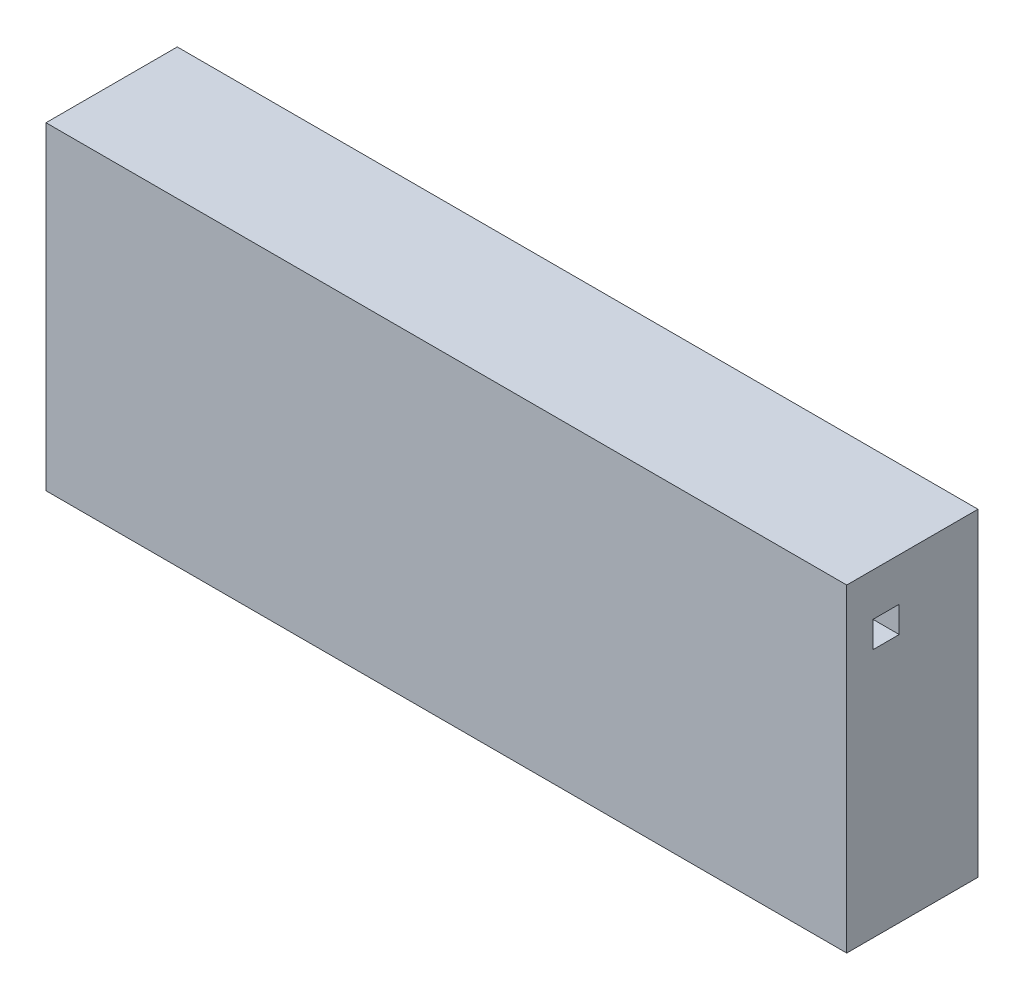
ISO-10303-21;
HEADER;
FILE_DESCRIPTION(('STEP AP214'),'2;1');
FILE_NAME('part.step','',(''),(''),'','','');
FILE_SCHEMA(('AUTOMOTIVE_DESIGN { 1 0 10303 214 1 1 1 1 }'));
ENDSEC;
DATA;
#1=APPLICATION_CONTEXT('core data for automotive mechanical design processes');
#2=APPLICATION_PROTOCOL_DEFINITION('international standard','automotive_design',2000,#1);
#3=PRODUCT_CONTEXT('',#1,'mechanical');
#4=PRODUCT('Part','Part','',(#3));
#5=PRODUCT_RELATED_PRODUCT_CATEGORY('part','',(#4));
#6=PRODUCT_DEFINITION_FORMATION('','',#4);
#7=PRODUCT_DEFINITION_CONTEXT('part definition',#1,'design');
#8=PRODUCT_DEFINITION('design','',#6,#7);
#9=PRODUCT_DEFINITION_SHAPE('','',#8);
#10=(LENGTH_UNIT() NAMED_UNIT(*) SI_UNIT(.MILLI.,.METRE.));
#11=(NAMED_UNIT(*) PLANE_ANGLE_UNIT() SI_UNIT($,.RADIAN.));
#12=(NAMED_UNIT(*) SI_UNIT($,.STERADIAN.) SOLID_ANGLE_UNIT());
#13=UNCERTAINTY_MEASURE_WITH_UNIT(LENGTH_MEASURE(1.E-05),#10,'distance_accuracy_value','');
#14=(GEOMETRIC_REPRESENTATION_CONTEXT(3) GLOBAL_UNCERTAINTY_ASSIGNED_CONTEXT((#13)) GLOBAL_UNIT_ASSIGNED_CONTEXT((#10,
#11,#12)) REPRESENTATION_CONTEXT('',''));
#15=CARTESIAN_POINT('',(0.,0.,0.));
#16=DIRECTION('',(0.,0.,1.));
#17=DIRECTION('',(1.,0.,0.));
#18=AXIS2_PLACEMENT_3D('',#15,#16,#17);
#19=CARTESIAN_POINT('',(0.,0.,2.));
#20=DIRECTION('',(1.,0.,0.));
#21=DIRECTION('',(0.,1.,0.));
#22=AXIS2_PLACEMENT_3D('',#19,#20,#21);
#23=PLANE('',#22);
#24=DIRECTION('',(0.,0.,1.));
#25=VECTOR('',#24,1.);
#26=CARTESIAN_POINT('',(0.,9.23349364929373,2.5));
#27=LINE('',#26,#25);
#28=CARTESIAN_POINT('',(0.,9.23349364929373,2.5));
#29=VERTEX_POINT('',#28);
#30=CARTESIAN_POINT('',(0.,9.23349364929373,3.));
#31=VERTEX_POINT('',#30);
#32=EDGE_CURVE('E922',#29,#31,#27,.T.);
#33=ORIENTED_EDGE('',*,*,#32,.T.);
#34=DIRECTION('',(0.,-1.,0.));
#35=VECTOR('',#34,1.);
#36=CARTESIAN_POINT('',(0.,0.,3.));
#37=LINE('',#36,#35);
#38=CARTESIAN_POINT('',(0.,8.73349364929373,3.));
#39=VERTEX_POINT('',#38);
#40=EDGE_CURVE('E893',#31,#39,#37,.T.);
#41=ORIENTED_EDGE('',*,*,#40,.T.);
#42=DIRECTION('',(0.,0.,1.));
#43=VECTOR('',#42,1.);
#44=CARTESIAN_POINT('',(0.,8.73349364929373,2.5));
#45=LINE('',#44,#43);
#46=CARTESIAN_POINT('',(0.,8.73349364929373,2.5));
#47=VERTEX_POINT('',#46);
#48=EDGE_CURVE('E939',#47,#39,#45,.T.);
#49=ORIENTED_EDGE('',*,*,#48,.F.);
#50=DIRECTION('',(0.,-1.,0.));
#51=VECTOR('',#50,1.);
#52=CARTESIAN_POINT('',(0.,9.23349364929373,2.5));
#53=LINE('',#52,#51);
#54=EDGE_CURVE('E907',#29,#47,#53,.T.);
#55=ORIENTED_EDGE('',*,*,#54,.F.);
#56=EDGE_LOOP('',(#33,#41,#49,#55));
#57=FACE_BOUND('',#56,.T.);
#58=DIRECTION('',(0.,-1.,0.));
#59=VECTOR('',#58,1.);
#60=CARTESIAN_POINT('',(0.,10.05,3.5));
#61=LINE('',#60,#59);
#62=CARTESIAN_POINT('',(0.,10.05,3.5));
#63=VERTEX_POINT('',#62);
#64=CARTESIAN_POINT('',(0.,3.9794873,3.5));
#65=VERTEX_POINT('',#64);
#66=EDGE_CURVE('E55',#63,#65,#61,.T.);
#67=ORIENTED_EDGE('',*,*,#66,.F.);
#68=DIRECTION('',(0.,0.,-1.));
#69=VECTOR('',#68,1.);
#70=CARTESIAN_POINT('',(0.,10.05,2.));
#71=LINE('',#70,#69);
#72=CARTESIAN_POINT('',(0.,10.05,1.));
#73=VERTEX_POINT('',#72);
#74=EDGE_CURVE('E1885',#63,#73,#71,.T.);
#75=ORIENTED_EDGE('',*,*,#74,.T.);
#76=DIRECTION('',(0.,-1.,0.));
#77=VECTOR('',#76,1.);
#78=CARTESIAN_POINT('',(0.,10.05,1.));
#79=LINE('',#78,#77);
#80=CARTESIAN_POINT('',(0.,3.9794873,1.));
#81=VERTEX_POINT('',#80);
#82=EDGE_CURVE('E3809',#73,#81,#79,.T.);
#83=ORIENTED_EDGE('',*,*,#82,.T.);
#84=DIRECTION('',(0.,0.,1.));
#85=VECTOR('',#84,1.);
#86=CARTESIAN_POINT('',(0.,3.9794873,0.));
#87=LINE('',#86,#85);
#88=EDGE_CURVE('E890',#81,#65,#87,.T.);
#89=ORIENTED_EDGE('',*,*,#88,.T.);
#90=EDGE_LOOP('',(#67,#75,#83,#89));
#91=FACE_BOUND('',#90,.T.);
#92=ADVANCED_FACE('F41',(#57,#91),#23,.F.);
#93=CARTESIAN_POINT('',(15.25,0.,2.));
#94=DIRECTION('',(-1.,0.,0.));
#95=DIRECTION('',(0.,-1.,0.));
#96=AXIS2_PLACEMENT_3D('',#93,#94,#95);
#97=PLANE('',#96);
#98=DIRECTION('',(0.,0.,1.));
#99=VECTOR('',#98,1.);
#100=CARTESIAN_POINT('',(15.25,8.73349365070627,2.5));
#101=LINE('',#100,#99);
#102=CARTESIAN_POINT('',(15.25,8.73349365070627,2.5));
#103=VERTEX_POINT('',#102);
#104=CARTESIAN_POINT('',(15.25,8.73349365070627,3.));
#105=VERTEX_POINT('',#104);
#106=EDGE_CURVE('E1242',#103,#105,#101,.T.);
#107=ORIENTED_EDGE('',*,*,#106,.T.);
#108=DIRECTION('',(0.,1.,0.));
#109=VECTOR('',#108,1.);
#110=CARTESIAN_POINT('',(15.25,0.,3.));
#111=LINE('',#110,#109);
#112=CARTESIAN_POINT('',(15.25,9.23349364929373,3.));
#113=VERTEX_POINT('',#112);
#114=EDGE_CURVE('E900',#105,#113,#111,.T.);
#115=ORIENTED_EDGE('',*,*,#114,.T.);
#116=DIRECTION('',(0.,0.,1.));
#117=VECTOR('',#116,1.);
#118=CARTESIAN_POINT('',(15.25,9.23349364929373,2.5));
#119=LINE('',#118,#117);
#120=CARTESIAN_POINT('',(15.25,9.23349364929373,2.5));
#121=VERTEX_POINT('',#120);
#122=EDGE_CURVE('E1274',#121,#113,#119,.T.);
#123=ORIENTED_EDGE('',*,*,#122,.F.);
#124=DIRECTION('',(0.,1.,0.));
#125=VECTOR('',#124,1.);
#126=CARTESIAN_POINT('',(15.25,9.23349364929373,2.5));
#127=LINE('',#126,#125);
#128=EDGE_CURVE('E1266',#103,#121,#127,.T.);
#129=ORIENTED_EDGE('',*,*,#128,.F.);
#130=EDGE_LOOP('',(#107,#115,#123,#129));
#131=FACE_BOUND('',#130,.T.);
#132=DIRECTION('',(0.,1.,0.));
#133=VECTOR('',#132,1.);
#134=CARTESIAN_POINT('',(15.25,10.05,3.5));
#135=LINE('',#134,#133);
#136=CARTESIAN_POINT('',(15.25,3.9794873,3.5));
#137=VERTEX_POINT('',#136);
#138=CARTESIAN_POINT('',(15.25,10.05,3.5));
#139=VERTEX_POINT('',#138);
#140=EDGE_CURVE('E873',#137,#139,#135,.T.);
#141=ORIENTED_EDGE('',*,*,#140,.F.);
#142=DIRECTION('',(0.,0.,1.));
#143=VECTOR('',#142,1.);
#144=CARTESIAN_POINT('',(15.25,3.9794873,0.));
#145=LINE('',#144,#143);
#146=CARTESIAN_POINT('',(15.25,3.9794873,1.));
#147=VERTEX_POINT('',#146);
#148=EDGE_CURVE('E884',#147,#137,#145,.T.);
#149=ORIENTED_EDGE('',*,*,#148,.F.);
#150=DIRECTION('',(0.,1.,0.));
#151=VECTOR('',#150,1.);
#152=CARTESIAN_POINT('',(15.25,10.05,1.));
#153=LINE('',#152,#151);
#154=CARTESIAN_POINT('',(15.25,10.05,1.));
#155=VERTEX_POINT('',#154);
#156=EDGE_CURVE('E63',#147,#155,#153,.T.);
#157=ORIENTED_EDGE('',*,*,#156,.T.);
#158=DIRECTION('',(0.,0.,-1.));
#159=VECTOR('',#158,1.);
#160=CARTESIAN_POINT('',(15.25,10.05,2.));
#161=LINE('',#160,#159);
#162=EDGE_CURVE('E885',#139,#155,#161,.T.);
#163=ORIENTED_EDGE('',*,*,#162,.F.);
#164=EDGE_LOOP('',(#141,#149,#157,#163));
#165=FACE_BOUND('',#164,.T.);
#166=ADVANCED_FACE('F883',(#131,#165),#97,.F.);
#167=CARTESIAN_POINT('',(0.,10.05,2.));
#168=DIRECTION('',(0.,-1.,0.));
#169=DIRECTION('',(0.,0.,-1.));
#170=AXIS2_PLACEMENT_3D('',#167,#168,#169);
#171=PLANE('',#170);
#172=DIRECTION('',(-1.,0.,0.));
#173=VECTOR('',#172,1.);
#174=CARTESIAN_POINT('',(0.,10.05,3.5));
#175=LINE('',#174,#173);
#176=EDGE_CURVE('E886',#139,#63,#175,.T.);
#177=ORIENTED_EDGE('',*,*,#176,.F.);
#178=ORIENTED_EDGE('',*,*,#162,.T.);
#179=DIRECTION('',(-1.,0.,0.));
#180=VECTOR('',#179,1.);
#181=CARTESIAN_POINT('',(0.,10.05,1.));
#182=LINE('',#181,#180);
#183=EDGE_CURVE('E891',#155,#73,#182,.T.);
#184=ORIENTED_EDGE('',*,*,#183,.T.);
#185=ORIENTED_EDGE('',*,*,#74,.F.);
#186=EDGE_LOOP('',(#177,#178,#184,#185));
#187=FACE_BOUND('',#186,.T.);
#188=ADVANCED_FACE('F2105',(#187),#171,.F.);
#189=CARTESIAN_POINT('',(0.,3.9794873,0.));
#190=DIRECTION('',(0.,1.,0.));
#191=DIRECTION('',(0.,0.,1.));
#192=AXIS2_PLACEMENT_3D('',#189,#190,#191);
#193=PLANE('',#192);
#194=DIRECTION('',(1.,0.,0.));
#195=VECTOR('',#194,1.);
#196=CARTESIAN_POINT('',(0.,3.9794873,3.5));
#197=LINE('',#196,#195);
#198=EDGE_CURVE('E870',#65,#137,#197,.T.);
#199=ORIENTED_EDGE('',*,*,#198,.F.);
#200=ORIENTED_EDGE('',*,*,#88,.F.);
#201=DIRECTION('',(1.,0.,0.));
#202=VECTOR('',#201,1.);
#203=CARTESIAN_POINT('',(0.,3.9794873,1.));
#204=LINE('',#203,#202);
#205=EDGE_CURVE('E889',#81,#147,#204,.T.);
#206=ORIENTED_EDGE('',*,*,#205,.T.);
#207=ORIENTED_EDGE('',*,*,#148,.T.);
#208=EDGE_LOOP('',(#199,#200,#206,#207));
#209=FACE_BOUND('',#208,.T.);
#210=ADVANCED_FACE('F888',(#209),#193,.F.);
#211=CARTESIAN_POINT('',(6.375,8.98349365,1.5));
#212=DIRECTION('',(0.,0.,1.));
#213=DIRECTION('',(1.,0.,0.));
#214=AXIS2_PLACEMENT_3D('',#211,#212,#213);
#215=CYLINDRICAL_SURFACE('',#214,0.312499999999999);
#216=CARTESIAN_POINT('',(6.375,8.98349365,2.));
#217=DIRECTION('',(0.,0.,-1.));
#218=DIRECTION('',(-1.,0.,0.));
#219=AXIS2_PLACEMENT_3D('',#216,#217,#218);
#220=CIRCLE('',#219,0.312499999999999);
#221=CARTESIAN_POINT('',(6.625,8.79599365,2.));
#222=VERTEX_POINT('',#221);
#223=CARTESIAN_POINT('',(6.125,8.79599365,2.));
#224=VERTEX_POINT('',#223);
#225=EDGE_CURVE('E1896',#222,#224,#220,.T.);
#226=ORIENTED_EDGE('',*,*,#225,.T.);
#227=DIRECTION('',(0.,0.,1.));
#228=VECTOR('',#227,1.);
#229=CARTESIAN_POINT('',(6.125,8.79599365,1.5));
#230=LINE('',#229,#228);
#231=CARTESIAN_POINT('',(6.125,8.79599365,1.5));
#232=VERTEX_POINT('',#231);
#233=EDGE_CURVE('E1505',#232,#224,#230,.T.);
#234=ORIENTED_EDGE('',*,*,#233,.F.);
#235=CARTESIAN_POINT('',(6.375,8.98349365,1.5));
#236=DIRECTION('',(0.,0.,1.));
#237=DIRECTION('',(1.,0.,0.));
#238=AXIS2_PLACEMENT_3D('',#235,#236,#237);
#239=CIRCLE('',#238,0.312499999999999);
#240=CARTESIAN_POINT('',(6.625,8.79599365,1.5));
#241=VERTEX_POINT('',#240);
#242=EDGE_CURVE('E1458',#241,#232,#239,.T.);
#243=ORIENTED_EDGE('',*,*,#242,.F.);
#244=DIRECTION('',(0.,0.,1.));
#245=VECTOR('',#244,1.);
#246=CARTESIAN_POINT('',(6.625,8.79599365,1.5));
#247=LINE('',#246,#245);
#248=EDGE_CURVE('E1508',#222,#241,#247,.F.);
#249=ORIENTED_EDGE('',*,*,#248,.F.);
#250=EDGE_LOOP('',(#226,#234,#243,#249));
#251=FACE_BOUND('',#250,.T.);
#252=CARTESIAN_POINT('',(6.375,8.98349365,2.5));
#253=DIRECTION('',(0.,0.,1.));
#254=DIRECTION('',(1.,0.,0.));
#255=AXIS2_PLACEMENT_3D('',#252,#253,#254);
#256=CIRCLE('',#255,0.312499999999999);
#257=CARTESIAN_POINT('',(6.6875,8.98349365,2.5));
#258=VERTEX_POINT('',#257);
#259=EDGE_CURVE('E1284',#258,#258,#256,.F.);
#260=ORIENTED_EDGE('',*,*,#259,.F.);
#261=EDGE_LOOP('',(#260));
#262=FACE_BOUND('',#261,.T.);
#263=ADVANCED_FACE('F2127',(#251,#262),#215,.F.);
#264=CARTESIAN_POINT('',(0.,0.,1.5));
#265=DIRECTION('',(0.,0.,1.));
#266=DIRECTION('',(1.,0.,0.));
#267=AXIS2_PLACEMENT_3D('',#264,#265,#266);
#268=PLANE('',#267);
#269=DIRECTION('',(0.,1.,0.));
#270=VECTOR('',#269,1.);
#271=CARTESIAN_POINT('',(0.749999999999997,9.55,1.5));
#272=LINE('',#271,#270);
#273=CARTESIAN_POINT('',(0.749999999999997,9.23349365,1.5));
#274=VERTEX_POINT('',#273);
#275=CARTESIAN_POINT('',(0.749999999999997,9.33349364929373,1.5));
#276=VERTEX_POINT('',#275);
#277=EDGE_CURVE('E1867',#274,#276,#272,.T.);
#278=ORIENTED_EDGE('',*,*,#277,.T.);
#279=CARTESIAN_POINT('',(0.624999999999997,9.55,1.5));
#280=DIRECTION('',(0.,0.,1.));
#281=DIRECTION('',(1.,0.,0.));
#282=AXIS2_PLACEMENT_3D('',#279,#280,#281);
#283=CIRCLE('',#282,0.249999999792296);
#284=CARTESIAN_POINT('',(0.499999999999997,9.33349364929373,1.5));
#285=VERTEX_POINT('',#284);
#286=EDGE_CURVE('E1467',#276,#285,#283,.T.);
#287=ORIENTED_EDGE('',*,*,#286,.T.);
#288=DIRECTION('',(0.,-1.,0.));
#289=VECTOR('',#288,1.);
#290=CARTESIAN_POINT('',(0.499999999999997,9.55,1.5));
#291=LINE('',#290,#289);
#292=CARTESIAN_POINT('',(0.499999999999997,8.63349365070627,1.5));
#293=VERTEX_POINT('',#292);
#294=EDGE_CURVE('E1856',#285,#293,#291,.T.);
#295=ORIENTED_EDGE('',*,*,#294,.T.);
#296=CARTESIAN_POINT('',(0.624999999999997,8.4169873,1.5));
#297=DIRECTION('',(0.,0.,1.));
#298=DIRECTION('',(1.,0.,0.));
#299=AXIS2_PLACEMENT_3D('',#296,#297,#298);
#300=CIRCLE('',#299,0.249999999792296);
#301=CARTESIAN_POINT('',(0.749999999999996,8.63349365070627,1.5));
#302=VERTEX_POINT('',#301);
#303=EDGE_CURVE('E1482',#293,#302,#300,.T.);
#304=ORIENTED_EDGE('',*,*,#303,.T.);
#305=DIRECTION('',(0.,1.,0.));
#306=VECTOR('',#305,1.);
#307=CARTESIAN_POINT('',(0.749999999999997,8.4169873,1.5));
#308=LINE('',#307,#306);
#309=CARTESIAN_POINT('',(0.749999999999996,8.73349365,1.5));
#310=VERTEX_POINT('',#309);
#311=EDGE_CURVE('E1859',#302,#310,#308,.T.);
#312=ORIENTED_EDGE('',*,*,#311,.T.);
#313=DIRECTION('',(1.,0.,0.));
#314=VECTOR('',#313,1.);
#315=CARTESIAN_POINT('',(0.749999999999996,8.73349365,1.5));
#316=LINE('',#315,#314);
#317=CARTESIAN_POINT('',(2.25,8.73349365,1.5));
#318=VERTEX_POINT('',#317);
#319=EDGE_CURVE('E1862',#310,#318,#316,.T.);
#320=ORIENTED_EDGE('',*,*,#319,.T.);
#321=CARTESIAN_POINT('',(2.4375,8.98349365,1.5));
#322=DIRECTION('',(0.,0.,1.));
#323=DIRECTION('',(1.,0.,0.));
#324=AXIS2_PLACEMENT_3D('',#321,#322,#323);
#325=CIRCLE('',#324,0.3125);
#326=CARTESIAN_POINT('',(2.25,9.23349365,1.5));
#327=VERTEX_POINT('',#326);
#328=EDGE_CURVE('E1455',#318,#327,#325,.T.);
#329=ORIENTED_EDGE('',*,*,#328,.T.);
#330=DIRECTION('',(-1.,0.,0.));
#331=VECTOR('',#330,1.);
#332=CARTESIAN_POINT('',(0.749999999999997,9.23349365,1.5));
#333=LINE('',#332,#331);
#334=EDGE_CURVE('E1865',#327,#274,#333,.T.);
#335=ORIENTED_EDGE('',*,*,#334,.T.);
#336=EDGE_LOOP('',(#278,#287,#295,#304,#312,#320,#329,#335));
#337=FACE_BOUND('',#336,.T.);
#338=ADVANCED_FACE('F2080',(#337),#268,.T.);
#339=CARTESIAN_POINT('',(0.749999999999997,8.4169873,1.5));
#340=DIRECTION('',(1.,0.,0.));
#341=DIRECTION('',(0.,1.,0.));
#342=AXIS2_PLACEMENT_3D('',#339,#340,#341);
#343=PLANE('',#342);
#344=ORIENTED_EDGE('',*,*,#311,.F.);
#345=DIRECTION('',(0.,0.,1.));
#346=VECTOR('',#345,1.);
#347=CARTESIAN_POINT('',(0.749999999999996,8.63349365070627,1.5));
#348=LINE('',#347,#346);
#349=CARTESIAN_POINT('',(0.749999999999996,8.63349365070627,2.));
#350=VERTEX_POINT('',#349);
#351=EDGE_CURVE('E1616',#302,#350,#348,.T.);
#352=ORIENTED_EDGE('',*,*,#351,.T.);
#353=DIRECTION('',(0.,1.,0.));
#354=VECTOR('',#353,1.);
#355=CARTESIAN_POINT('',(0.749999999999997,8.4169873,2.));
#356=LINE('',#355,#354);
#357=CARTESIAN_POINT('',(0.749999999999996,8.73349365,2.));
#358=VERTEX_POINT('',#357);
#359=EDGE_CURVE('E1873',#350,#358,#356,.T.);
#360=ORIENTED_EDGE('',*,*,#359,.T.);
#361=DIRECTION('',(0.,0.,1.));
#362=VECTOR('',#361,1.);
#363=CARTESIAN_POINT('',(0.749999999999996,8.73349365,1.5));
#364=LINE('',#363,#362);
#365=EDGE_CURVE('E1870',#310,#358,#364,.T.);
#366=ORIENTED_EDGE('',*,*,#365,.F.);
#367=EDGE_LOOP('',(#344,#352,#360,#366));
#368=FACE_BOUND('',#367,.T.);
#369=ADVANCED_FACE('F2076',(#368),#343,.F.);
#370=CARTESIAN_POINT('',(0.749999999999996,8.73349365,1.5));
#371=DIRECTION('',(0.,-1.,0.));
#372=DIRECTION('',(0.,0.,-1.));
#373=AXIS2_PLACEMENT_3D('',#370,#371,#372);
#374=PLANE('',#373);
#375=DIRECTION('',(1.,0.,0.));
#376=VECTOR('',#375,1.);
#377=CARTESIAN_POINT('',(0.749999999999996,8.73349365,2.));
#378=LINE('',#377,#376);
#379=CARTESIAN_POINT('',(2.25,8.73349365,2.));
#380=VERTEX_POINT('',#379);
#381=EDGE_CURVE('E1875',#358,#380,#378,.T.);
#382=ORIENTED_EDGE('',*,*,#381,.T.);
#383=DIRECTION('',(0.,0.,1.));
#384=VECTOR('',#383,1.);
#385=CARTESIAN_POINT('',(2.25,8.73349365,1.5));
#386=LINE('',#385,#384);
#387=EDGE_CURVE('E1622',#380,#318,#386,.F.);
#388=ORIENTED_EDGE('',*,*,#387,.T.);
#389=ORIENTED_EDGE('',*,*,#319,.F.);
#390=ORIENTED_EDGE('',*,*,#365,.T.);
#391=EDGE_LOOP('',(#382,#388,#389,#390));
#392=FACE_BOUND('',#391,.T.);
#393=ADVANCED_FACE('F2092',(#392),#374,.F.);
#394=CARTESIAN_POINT('',(0.749999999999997,9.23349365,1.5));
#395=DIRECTION('',(0.,1.,0.));
#396=DIRECTION('',(0.,0.,1.));
#397=AXIS2_PLACEMENT_3D('',#394,#395,#396);
#398=PLANE('',#397);
#399=ORIENTED_EDGE('',*,*,#334,.F.);
#400=DIRECTION('',(0.,0.,1.));
#401=VECTOR('',#400,1.);
#402=CARTESIAN_POINT('',(2.25,9.23349365,1.5));
#403=LINE('',#402,#401);
#404=CARTESIAN_POINT('',(2.25,9.23349365,2.));
#405=VERTEX_POINT('',#404);
#406=EDGE_CURVE('E1619',#327,#405,#403,.T.);
#407=ORIENTED_EDGE('',*,*,#406,.T.);
#408=DIRECTION('',(-1.,0.,0.));
#409=VECTOR('',#408,1.);
#410=CARTESIAN_POINT('',(0.749999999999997,9.23349365,2.));
#411=LINE('',#410,#409);
#412=CARTESIAN_POINT('',(0.749999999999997,9.23349365,2.));
#413=VERTEX_POINT('',#412);
#414=EDGE_CURVE('E1878',#405,#413,#411,.T.);
#415=ORIENTED_EDGE('',*,*,#414,.T.);
#416=DIRECTION('',(0.,0.,1.));
#417=VECTOR('',#416,1.);
#418=CARTESIAN_POINT('',(0.749999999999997,9.23349365,1.5));
#419=LINE('',#418,#417);
#420=EDGE_CURVE('E1882',#274,#413,#419,.T.);
#421=ORIENTED_EDGE('',*,*,#420,.F.);
#422=EDGE_LOOP('',(#399,#407,#415,#421));
#423=FACE_BOUND('',#422,.T.);
#424=ADVANCED_FACE('F2089',(#423),#398,.F.);
#425=CARTESIAN_POINT('',(0.749999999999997,9.55,1.5));
#426=DIRECTION('',(1.,0.,0.));
#427=DIRECTION('',(0.,0.,-1.));
#428=AXIS2_PLACEMENT_3D('',#425,#426,#427);
#429=PLANE('',#428);
#430=DIRECTION('',(0.,1.,0.));
#431=VECTOR('',#430,1.);
#432=CARTESIAN_POINT('',(0.749999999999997,9.55,2.));
#433=LINE('',#432,#431);
#434=CARTESIAN_POINT('',(0.749999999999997,9.33349364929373,2.));
#435=VERTEX_POINT('',#434);
#436=EDGE_CURVE('E1860',#413,#435,#433,.T.);
#437=ORIENTED_EDGE('',*,*,#436,.T.);
#438=DIRECTION('',(0.,0.,1.));
#439=VECTOR('',#438,1.);
#440=CARTESIAN_POINT('',(0.749999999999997,9.33349364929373,1.5));
#441=LINE('',#440,#439);
#442=EDGE_CURVE('E1628',#435,#276,#441,.F.);
#443=ORIENTED_EDGE('',*,*,#442,.T.);
#444=ORIENTED_EDGE('',*,*,#277,.F.);
#445=ORIENTED_EDGE('',*,*,#420,.T.);
#446=EDGE_LOOP('',(#437,#443,#444,#445));
#447=FACE_BOUND('',#446,.T.);
#448=ADVANCED_FACE('F2083',(#447),#429,.F.);
#449=CARTESIAN_POINT('',(0.499999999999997,9.55,1.5));
#450=DIRECTION('',(-1.,0.,0.));
#451=DIRECTION('',(0.,0.,1.));
#452=AXIS2_PLACEMENT_3D('',#449,#450,#451);
#453=PLANE('',#452);
#454=ORIENTED_EDGE('',*,*,#294,.F.);
#455=DIRECTION('',(0.,0.,1.));
#456=VECTOR('',#455,1.);
#457=CARTESIAN_POINT('',(0.499999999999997,9.33349364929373,1.5));
#458=LINE('',#457,#456);
#459=CARTESIAN_POINT('',(0.499999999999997,9.33349364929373,2.));
#460=VERTEX_POINT('',#459);
#461=EDGE_CURVE('E1625',#285,#460,#458,.T.);
#462=ORIENTED_EDGE('',*,*,#461,.T.);
#463=DIRECTION('',(0.,-1.,0.));
#464=VECTOR('',#463,1.);
#465=CARTESIAN_POINT('',(0.499999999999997,9.55,2.));
#466=LINE('',#465,#464);
#467=CARTESIAN_POINT('',(0.499999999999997,8.63349365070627,2.));
#468=VERTEX_POINT('',#467);
#469=EDGE_CURVE('E1823',#460,#468,#466,.T.);
#470=ORIENTED_EDGE('',*,*,#469,.T.);
#471=DIRECTION('',(0.,0.,1.));
#472=VECTOR('',#471,1.);
#473=CARTESIAN_POINT('',(0.499999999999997,8.63349365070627,1.5));
#474=LINE('',#473,#472);
#475=EDGE_CURVE('E1613',#468,#293,#474,.F.);
#476=ORIENTED_EDGE('',*,*,#475,.T.);
#477=EDGE_LOOP('',(#454,#462,#470,#476));
#478=FACE_BOUND('',#477,.T.);
#479=ADVANCED_FACE('F2069',(#478),#453,.F.);
#480=CARTESIAN_POINT('',(0.,0.,2.));
#481=DIRECTION('',(0.,0.,-1.));
#482=DIRECTION('',(-1.,0.,0.));
#483=AXIS2_PLACEMENT_3D('',#480,#481,#482);
#484=PLANE('',#483);
#485=CARTESIAN_POINT('',(0.624999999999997,9.55,2.));
#486=DIRECTION('',(0.,0.,-1.));
#487=DIRECTION('',(-1.,0.,0.));
#488=AXIS2_PLACEMENT_3D('',#485,#486,#487);
#489=CIRCLE('',#488,0.249999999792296);
#490=EDGE_CURVE('E1936',#435,#460,#489,.T.);
#491=ORIENTED_EDGE('',*,*,#490,.F.);
#492=ORIENTED_EDGE('',*,*,#436,.F.);
#493=ORIENTED_EDGE('',*,*,#414,.F.);
#494=CARTESIAN_POINT('',(2.4375,8.98349365,2.));
#495=DIRECTION('',(0.,0.,-1.));
#496=DIRECTION('',(-1.,0.,0.));
#497=AXIS2_PLACEMENT_3D('',#494,#495,#496);
#498=CIRCLE('',#497,0.3125);
#499=EDGE_CURVE('E1934',#380,#405,#498,.T.);
#500=ORIENTED_EDGE('',*,*,#499,.F.);
#501=ORIENTED_EDGE('',*,*,#381,.F.);
#502=ORIENTED_EDGE('',*,*,#359,.F.);
#503=CARTESIAN_POINT('',(0.624999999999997,8.4169873,2.));
#504=DIRECTION('',(0.,0.,-1.));
#505=DIRECTION('',(-1.,0.,0.));
#506=AXIS2_PLACEMENT_3D('',#503,#504,#505);
#507=CIRCLE('',#506,0.249999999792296);
#508=EDGE_CURVE('E1932',#468,#350,#507,.T.);
#509=ORIENTED_EDGE('',*,*,#508,.F.);
#510=ORIENTED_EDGE('',*,*,#469,.F.);
#511=EDGE_LOOP('',(#491,#492,#493,#500,#501,#502,#509,#510));
#512=FACE_BOUND('',#511,.T.);
#513=ADVANCED_FACE('F2071',(#512),#484,.T.);
#514=CARTESIAN_POINT('',(0.624999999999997,8.4169873,1.5));
#515=DIRECTION('',(0.,0.,1.));
#516=DIRECTION('',(1.,0.,0.));
#517=AXIS2_PLACEMENT_3D('',#514,#515,#516);
#518=CYLINDRICAL_SURFACE('',#517,0.249999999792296);
#519=CARTESIAN_POINT('',(0.624999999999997,8.4169873,3.));
#520=DIRECTION('',(0.,0.,1.));
#521=DIRECTION('',(1.,0.,0.));
#522=AXIS2_PLACEMENT_3D('',#519,#520,#521);
#523=CIRCLE('',#522,0.249999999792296);
#524=CARTESIAN_POINT('',(0.499999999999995,8.63349365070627,3.));
#525=VERTEX_POINT('',#524);
#526=CARTESIAN_POINT('',(0.749999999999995,8.63349365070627,3.));
#527=VERTEX_POINT('',#526);
#528=EDGE_CURVE('E1470',#525,#527,#523,.T.);
#529=ORIENTED_EDGE('',*,*,#528,.T.);
#530=DIRECTION('',(0.,0.,1.));
#531=VECTOR('',#530,1.);
#532=CARTESIAN_POINT('',(0.749999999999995,8.63349365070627,1.5));
#533=LINE('',#532,#531);
#534=CARTESIAN_POINT('',(0.749999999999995,8.63349365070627,2.5));
#535=VERTEX_POINT('',#534);
#536=EDGE_CURVE('E1354',#527,#535,#533,.F.);
#537=ORIENTED_EDGE('',*,*,#536,.T.);
#538=CARTESIAN_POINT('',(0.624999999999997,8.4169873,2.5));
#539=DIRECTION('',(0.,0.,1.));
#540=DIRECTION('',(1.,0.,0.));
#541=AXIS2_PLACEMENT_3D('',#538,#539,#540);
#542=CIRCLE('',#541,0.249999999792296);
#543=CARTESIAN_POINT('',(0.499999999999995,8.63349365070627,2.5));
#544=VERTEX_POINT('',#543);
#545=EDGE_CURVE('E1362',#544,#535,#542,.F.);
#546=ORIENTED_EDGE('',*,*,#545,.F.);
#547=DIRECTION('',(0.,0.,1.));
#548=VECTOR('',#547,1.);
#549=CARTESIAN_POINT('',(0.499999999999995,8.63349365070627,1.5));
#550=LINE('',#549,#548);
#551=EDGE_CURVE('E1348',#544,#525,#550,.T.);
#552=ORIENTED_EDGE('',*,*,#551,.T.);
#553=EDGE_LOOP('',(#529,#537,#546,#552));
#554=FACE_BOUND('',#553,.T.);
#555=ORIENTED_EDGE('',*,*,#303,.F.);
#556=ORIENTED_EDGE('',*,*,#475,.F.);
#557=ORIENTED_EDGE('',*,*,#508,.T.);
#558=ORIENTED_EDGE('',*,*,#351,.F.);
#559=EDGE_LOOP('',(#555,#556,#557,#558));
#560=FACE_BOUND('',#559,.T.);
#561=ADVANCED_FACE('F2033',(#554,#560),#518,.F.);
#562=CARTESIAN_POINT('',(2.4375,8.98349365,1.5));
#563=DIRECTION('',(0.,0.,1.));
#564=DIRECTION('',(1.,0.,0.));
#565=AXIS2_PLACEMENT_3D('',#562,#563,#564);
#566=CYLINDRICAL_SURFACE('',#565,0.3125);
#567=CARTESIAN_POINT('',(2.4375,8.98349365,2.5));
#568=DIRECTION('',(0.,0.,-1.));
#569=DIRECTION('',(-1.,0.,0.));
#570=AXIS2_PLACEMENT_3D('',#567,#568,#569);
#571=CIRCLE('',#570,0.3125);
#572=CARTESIAN_POINT('',(2.125,8.98349365,2.5));
#573=VERTEX_POINT('',#572);
#574=EDGE_CURVE('E1319',#573,#573,#571,.F.);
#575=ORIENTED_EDGE('',*,*,#574,.T.);
#576=EDGE_LOOP('',(#575));
#577=FACE_BOUND('',#576,.T.);
#578=ORIENTED_EDGE('',*,*,#499,.T.);
#579=ORIENTED_EDGE('',*,*,#406,.F.);
#580=ORIENTED_EDGE('',*,*,#328,.F.);
#581=ORIENTED_EDGE('',*,*,#387,.F.);
#582=EDGE_LOOP('',(#578,#579,#580,#581));
#583=FACE_BOUND('',#582,.T.);
#584=ADVANCED_FACE('F2061',(#577,#583),#566,.F.);
#585=CARTESIAN_POINT('',(0.624999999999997,9.55,1.5));
#586=DIRECTION('',(0.,0.,1.));
#587=DIRECTION('',(1.,0.,0.));
#588=AXIS2_PLACEMENT_3D('',#585,#586,#587);
#589=CYLINDRICAL_SURFACE('',#588,0.249999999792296);
#590=CARTESIAN_POINT('',(0.624999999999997,9.55,3.));
#591=DIRECTION('',(0.,0.,1.));
#592=DIRECTION('',(1.,0.,0.));
#593=AXIS2_PLACEMENT_3D('',#590,#591,#592);
#594=CIRCLE('',#593,0.249999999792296);
#595=CARTESIAN_POINT('',(0.749999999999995,9.33349364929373,3.));
#596=VERTEX_POINT('',#595);
#597=CARTESIAN_POINT('',(0.499999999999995,9.33349364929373,3.));
#598=VERTEX_POINT('',#597);
#599=EDGE_CURVE('E1471',#596,#598,#594,.T.);
#600=ORIENTED_EDGE('',*,*,#599,.T.);
#601=DIRECTION('',(0.,0.,1.));
#602=VECTOR('',#601,1.);
#603=CARTESIAN_POINT('',(0.499999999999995,9.33349364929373,1.5));
#604=LINE('',#603,#602);
#605=CARTESIAN_POINT('',(0.499999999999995,9.33349364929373,2.5));
#606=VERTEX_POINT('',#605);
#607=EDGE_CURVE('E1357',#598,#606,#604,.F.);
#608=ORIENTED_EDGE('',*,*,#607,.T.);
#609=CARTESIAN_POINT('',(0.624999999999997,9.55,2.5));
#610=DIRECTION('',(0.,0.,1.));
#611=DIRECTION('',(1.,0.,0.));
#612=AXIS2_PLACEMENT_3D('',#609,#610,#611);
#613=CIRCLE('',#612,0.249999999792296);
#614=CARTESIAN_POINT('',(0.749999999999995,9.33349364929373,2.5));
#615=VERTEX_POINT('',#614);
#616=EDGE_CURVE('E1360',#615,#606,#613,.F.);
#617=ORIENTED_EDGE('',*,*,#616,.F.);
#618=DIRECTION('',(0.,0.,1.));
#619=VECTOR('',#618,1.);
#620=CARTESIAN_POINT('',(0.749999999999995,9.33349364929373,1.5));
#621=LINE('',#620,#619);
#622=EDGE_CURVE('E1351',#615,#596,#621,.T.);
#623=ORIENTED_EDGE('',*,*,#622,.T.);
#624=EDGE_LOOP('',(#600,#608,#617,#623));
#625=FACE_BOUND('',#624,.T.);
#626=ORIENTED_EDGE('',*,*,#490,.T.);
#627=ORIENTED_EDGE('',*,*,#461,.F.);
#628=ORIENTED_EDGE('',*,*,#286,.F.);
#629=ORIENTED_EDGE('',*,*,#442,.F.);
#630=EDGE_LOOP('',(#626,#627,#628,#629));
#631=FACE_BOUND('',#630,.T.);
#632=ADVANCED_FACE('F2057',(#625,#631),#589,.F.);
#633=CARTESIAN_POINT('',(9.74599365,6.85849365,1.5));
#634=DIRECTION('',(0.,0.,1.));
#635=DIRECTION('',(1.,0.,0.));
#636=AXIS2_PLACEMENT_3D('',#633,#634,#635);
#637=CYLINDRICAL_SURFACE('',#636,0.249999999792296);
#638=CARTESIAN_POINT('',(9.74599365,6.85849365,3.));
#639=DIRECTION('',(0.,0.,1.));
#640=DIRECTION('',(1.,0.,0.));
#641=AXIS2_PLACEMENT_3D('',#638,#639,#640);
#642=CIRCLE('',#641,0.249999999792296);
#643=CARTESIAN_POINT('',(9.96250000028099,6.98349365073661,3.));
#644=VERTEX_POINT('',#643);
#645=CARTESIAN_POINT('',(9.96250000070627,6.73349365,3.));
#646=VERTEX_POINT('',#645);
#647=EDGE_CURVE('E1393',#644,#646,#642,.T.);
#648=ORIENTED_EDGE('',*,*,#647,.T.);
#649=DIRECTION('',(0.,0.,1.));
#650=VECTOR('',#649,1.);
#651=CARTESIAN_POINT('',(9.96250000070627,6.73349365,1.5));
#652=LINE('',#651,#650);
#653=CARTESIAN_POINT('',(9.96250000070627,6.73349365,2.5));
#654=VERTEX_POINT('',#653);
#655=EDGE_CURVE('E1345',#646,#654,#652,.F.);
#656=ORIENTED_EDGE('',*,*,#655,.T.);
#657=CARTESIAN_POINT('',(9.74599365,6.85849365,2.5));
#658=DIRECTION('',(0.,0.,-1.));
#659=DIRECTION('',(-1.,0.,0.));
#660=AXIS2_PLACEMENT_3D('',#657,#658,#659);
#661=CIRCLE('',#660,0.249999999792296);
#662=CARTESIAN_POINT('',(9.96250000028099,6.98349365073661,2.5));
#663=VERTEX_POINT('',#662);
#664=EDGE_CURVE('E1294',#654,#663,#661,.F.);
#665=ORIENTED_EDGE('',*,*,#664,.T.);
#666=DIRECTION('',(0.,0.,1.));
#667=VECTOR('',#666,1.);
#668=CARTESIAN_POINT('',(9.96250000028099,6.98349365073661,1.5));
#669=LINE('',#668,#667);
#670=EDGE_CURVE('E2022',#663,#644,#669,.T.);
#671=ORIENTED_EDGE('',*,*,#670,.T.);
#672=EDGE_LOOP('',(#648,#656,#665,#671));
#673=FACE_BOUND('',#672,.T.);
#674=CARTESIAN_POINT('',(9.74599365,6.85849365,2.));
#675=DIRECTION('',(0.,0.,-1.));
#676=DIRECTION('',(-1.,0.,0.));
#677=AXIS2_PLACEMENT_3D('',#674,#675,#676);
#678=CIRCLE('',#677,0.249999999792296);
#679=CARTESIAN_POINT('',(9.96250000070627,6.98349365,2.));
#680=VERTEX_POINT('',#679);
#681=CARTESIAN_POINT('',(9.96250000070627,6.73349365,2.));
#682=VERTEX_POINT('',#681);
#683=EDGE_CURVE('E1890',#680,#682,#678,.T.);
#684=ORIENTED_EDGE('',*,*,#683,.T.);
#685=DIRECTION('',(0.,0.,1.));
#686=VECTOR('',#685,1.);
#687=CARTESIAN_POINT('',(9.96250000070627,6.73349365,1.5));
#688=LINE('',#687,#686);
#689=CARTESIAN_POINT('',(9.96250000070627,6.73349365,1.5));
#690=VERTEX_POINT('',#689);
#691=EDGE_CURVE('E1485',#690,#682,#688,.T.);
#692=ORIENTED_EDGE('',*,*,#691,.F.);
#693=CARTESIAN_POINT('',(9.74599365,6.85849365,1.5));
#694=DIRECTION('',(0.,0.,1.));
#695=DIRECTION('',(1.,0.,0.));
#696=AXIS2_PLACEMENT_3D('',#693,#694,#695);
#697=CIRCLE('',#696,0.249999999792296);
#698=CARTESIAN_POINT('',(9.96250000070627,6.98349365,1.5));
#699=VERTEX_POINT('',#698);
#700=EDGE_CURVE('E1390',#699,#690,#697,.T.);
#701=ORIENTED_EDGE('',*,*,#700,.F.);
#702=DIRECTION('',(0.,0.,1.));
#703=VECTOR('',#702,1.);
#704=CARTESIAN_POINT('',(9.96250000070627,6.98349365,1.5));
#705=LINE('',#704,#703);
#706=EDGE_CURVE('E1490',#680,#699,#705,.F.);
#707=ORIENTED_EDGE('',*,*,#706,.F.);
#708=EDGE_LOOP('',(#684,#692,#701,#707));
#709=FACE_BOUND('',#708,.T.);
#710=ADVANCED_FACE('F2060',(#673,#709),#637,.F.);
#711=CARTESIAN_POINT('',(10.87900635,6.85849365,1.5));
#712=DIRECTION('',(0.,0.,1.));
#713=DIRECTION('',(1.,0.,0.));
#714=AXIS2_PLACEMENT_3D('',#711,#712,#713);
#715=CYLINDRICAL_SURFACE('',#714,0.249999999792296);
#716=CARTESIAN_POINT('',(10.87900635,6.85849365,3.));
#717=DIRECTION('',(0.,0.,1.));
#718=DIRECTION('',(1.,0.,0.));
#719=AXIS2_PLACEMENT_3D('',#716,#717,#718);
#720=CIRCLE('',#719,0.249999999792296);
#721=CARTESIAN_POINT('',(10.6624999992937,6.73349365,3.));
#722=VERTEX_POINT('',#721);
#723=CARTESIAN_POINT('',(10.6624999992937,6.98349365,3.));
#724=VERTEX_POINT('',#723);
#725=EDGE_CURVE('E1399',#722,#724,#720,.T.);
#726=ORIENTED_EDGE('',*,*,#725,.T.);
#727=DIRECTION('',(0.,0.,1.));
#728=VECTOR('',#727,1.);
#729=CARTESIAN_POINT('',(10.6624999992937,6.98349365,1.5));
#730=LINE('',#729,#728);
#731=CARTESIAN_POINT('',(10.6624999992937,6.98349365,2.5));
#732=VERTEX_POINT('',#731);
#733=EDGE_CURVE('E2019',#724,#732,#730,.F.);
#734=ORIENTED_EDGE('',*,*,#733,.T.);
#735=CARTESIAN_POINT('',(10.87900635,6.85849365,2.5));
#736=DIRECTION('',(0.,0.,-1.));
#737=DIRECTION('',(-1.,0.,0.));
#738=AXIS2_PLACEMENT_3D('',#735,#736,#737);
#739=CIRCLE('',#738,0.249999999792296);
#740=CARTESIAN_POINT('',(10.6624999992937,6.73349365,2.5));
#741=VERTEX_POINT('',#740);
#742=EDGE_CURVE('E1291',#732,#741,#739,.F.);
#743=ORIENTED_EDGE('',*,*,#742,.T.);
#744=DIRECTION('',(0.,0.,1.));
#745=VECTOR('',#744,1.);
#746=CARTESIAN_POINT('',(10.6624999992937,6.73349365,1.5));
#747=LINE('',#746,#745);
#748=EDGE_CURVE('E2016',#741,#722,#747,.T.);
#749=ORIENTED_EDGE('',*,*,#748,.T.);
#750=EDGE_LOOP('',(#726,#734,#743,#749));
#751=FACE_BOUND('',#750,.T.);
#752=CARTESIAN_POINT('',(10.87900635,6.85849365,2.));
#753=DIRECTION('',(0.,0.,-1.));
#754=DIRECTION('',(-1.,0.,0.));
#755=AXIS2_PLACEMENT_3D('',#752,#753,#754);
#756=CIRCLE('',#755,0.249999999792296);
#757=CARTESIAN_POINT('',(10.6624999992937,6.73349365,2.));
#758=VERTEX_POINT('',#757);
#759=CARTESIAN_POINT('',(10.6624999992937,6.98349365,2.));
#760=VERTEX_POINT('',#759);
#761=EDGE_CURVE('E1892',#758,#760,#756,.T.);
#762=ORIENTED_EDGE('',*,*,#761,.T.);
#763=DIRECTION('',(0.,0.,1.));
#764=VECTOR('',#763,1.);
#765=CARTESIAN_POINT('',(10.6624999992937,6.98349365,1.5));
#766=LINE('',#765,#764);
#767=CARTESIAN_POINT('',(10.6624999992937,6.98349365,1.5));
#768=VERTEX_POINT('',#767);
#769=EDGE_CURVE('E1493',#768,#760,#766,.T.);
#770=ORIENTED_EDGE('',*,*,#769,.F.);
#771=CARTESIAN_POINT('',(10.87900635,6.85849365,1.5));
#772=DIRECTION('',(0.,0.,1.));
#773=DIRECTION('',(1.,0.,0.));
#774=AXIS2_PLACEMENT_3D('',#771,#772,#773);
#775=CIRCLE('',#774,0.249999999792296);
#776=CARTESIAN_POINT('',(10.6624999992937,6.73349365,1.5));
#777=VERTEX_POINT('',#776);
#778=EDGE_CURVE('E1396',#777,#768,#775,.T.);
#779=ORIENTED_EDGE('',*,*,#778,.F.);
#780=DIRECTION('',(0.,0.,1.));
#781=VECTOR('',#780,1.);
#782=CARTESIAN_POINT('',(10.6624999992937,6.73349365,1.5));
#783=LINE('',#782,#781);
#784=EDGE_CURVE('E1496',#758,#777,#783,.F.);
#785=ORIENTED_EDGE('',*,*,#784,.F.);
#786=EDGE_LOOP('',(#762,#770,#779,#785));
#787=FACE_BOUND('',#786,.T.);
#788=ADVANCED_FACE('F2329',(#751,#787),#715,.F.);
#789=CARTESIAN_POINT('',(10.3125,5.04599365,1.5));
#790=DIRECTION('',(0.,0.,1.));
#791=DIRECTION('',(1.,0.,0.));
#792=AXIS2_PLACEMENT_3D('',#789,#790,#791);
#793=CYLINDRICAL_SURFACE('',#792,0.312499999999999);
#794=CARTESIAN_POINT('',(10.3125,5.04599365,2.5));
#795=DIRECTION('',(0.,0.,-1.));
#796=DIRECTION('',(-1.,0.,0.));
#797=AXIS2_PLACEMENT_3D('',#794,#795,#796);
#798=CIRCLE('',#797,0.312499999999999);
#799=CARTESIAN_POINT('',(9.99999999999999,5.04599365,2.5));
#800=VERTEX_POINT('',#799);
#801=EDGE_CURVE('E1307',#800,#800,#798,.F.);
#802=ORIENTED_EDGE('',*,*,#801,.T.);
#803=EDGE_LOOP('',(#802));
#804=FACE_BOUND('',#803,.T.);
#805=CARTESIAN_POINT('',(10.3125,5.04599365,1.5));
#806=DIRECTION('',(0.,0.,1.));
#807=DIRECTION('',(1.,0.,0.));
#808=AXIS2_PLACEMENT_3D('',#805,#806,#807);
#809=CIRCLE('',#808,0.312499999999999);
#810=CARTESIAN_POINT('',(10.0625,5.23349365,1.5));
#811=VERTEX_POINT('',#810);
#812=CARTESIAN_POINT('',(10.5625,5.23349364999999,1.5));
#813=VERTEX_POINT('',#812);
#814=EDGE_CURVE('E1462',#811,#813,#809,.T.);
#815=ORIENTED_EDGE('',*,*,#814,.F.);
#816=DIRECTION('',(0.,0.,1.));
#817=VECTOR('',#816,1.);
#818=CARTESIAN_POINT('',(10.0625,5.23349365,1.5));
#819=LINE('',#818,#817);
#820=CARTESIAN_POINT('',(10.0625,5.23349365,2.));
#821=VERTEX_POINT('',#820);
#822=EDGE_CURVE('E1499',#821,#811,#819,.F.);
#823=ORIENTED_EDGE('',*,*,#822,.F.);
#824=CARTESIAN_POINT('',(10.3125,5.04599365,2.));
#825=DIRECTION('',(0.,0.,-1.));
#826=DIRECTION('',(-1.,0.,0.));
#827=AXIS2_PLACEMENT_3D('',#824,#825,#826);
#828=CIRCLE('',#827,0.312499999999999);
#829=CARTESIAN_POINT('',(10.5625,5.23349364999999,2.));
#830=VERTEX_POINT('',#829);
#831=EDGE_CURVE('E1894',#821,#830,#828,.T.);
#832=ORIENTED_EDGE('',*,*,#831,.T.);
#833=DIRECTION('',(0.,0.,1.));
#834=VECTOR('',#833,1.);
#835=CARTESIAN_POINT('',(10.5625,5.23349364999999,1.5));
#836=LINE('',#835,#834);
#837=EDGE_CURVE('E1502',#813,#830,#836,.T.);
#838=ORIENTED_EDGE('',*,*,#837,.F.);
#839=EDGE_LOOP('',(#815,#823,#832,#838));
#840=FACE_BOUND('',#839,.T.);
#841=ADVANCED_FACE('F2325',(#804,#840),#793,.F.);
#842=CARTESIAN_POINT('',(6.94150635,7.17099365,1.5));
#843=DIRECTION('',(0.,0.,1.));
#844=DIRECTION('',(1.,0.,0.));
#845=AXIS2_PLACEMENT_3D('',#842,#843,#844);
#846=CYLINDRICAL_SURFACE('',#845,0.249999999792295);
#847=CARTESIAN_POINT('',(6.94150635,7.17099365,2.5));
#848=DIRECTION('',(0.,0.,-1.));
#849=DIRECTION('',(-1.,0.,0.));
#850=AXIS2_PLACEMENT_3D('',#847,#848,#849);
#851=CIRCLE('',#850,0.249999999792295);
#852=CARTESIAN_POINT('',(6.72499999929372,7.29599365,2.5));
#853=VERTEX_POINT('',#852);
#854=CARTESIAN_POINT('',(6.72499999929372,7.04599365,2.5));
#855=VERTEX_POINT('',#854);
#856=EDGE_CURVE('E1339',#853,#855,#851,.F.);
#857=ORIENTED_EDGE('',*,*,#856,.T.);
#858=DIRECTION('',(0.,0.,1.));
#859=VECTOR('',#858,1.);
#860=CARTESIAN_POINT('',(6.72499999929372,7.04599365,1.5));
#861=LINE('',#860,#859);
#862=CARTESIAN_POINT('',(6.72499999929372,7.04599365,3.));
#863=VERTEX_POINT('',#862);
#864=EDGE_CURVE('E2013',#855,#863,#861,.T.);
#865=ORIENTED_EDGE('',*,*,#864,.T.);
#866=CARTESIAN_POINT('',(6.94150635,7.17099365,3.));
#867=DIRECTION('',(0.,0.,1.));
#868=DIRECTION('',(1.,0.,0.));
#869=AXIS2_PLACEMENT_3D('',#866,#867,#868);
#870=CIRCLE('',#869,0.249999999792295);
#871=CARTESIAN_POINT('',(6.72499999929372,7.29599365,3.));
#872=VERTEX_POINT('',#871);
#873=EDGE_CURVE('E1410',#863,#872,#870,.T.);
#874=ORIENTED_EDGE('',*,*,#873,.T.);
#875=DIRECTION('',(0.,0.,1.));
#876=VECTOR('',#875,1.);
#877=CARTESIAN_POINT('',(6.72499999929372,7.29599365,1.5));
#878=LINE('',#877,#876);
#879=EDGE_CURVE('E1342',#872,#853,#878,.F.);
#880=ORIENTED_EDGE('',*,*,#879,.T.);
#881=EDGE_LOOP('',(#857,#865,#874,#880));
#882=FACE_BOUND('',#881,.T.);
#883=CARTESIAN_POINT('',(6.94150635,7.17099365,1.5));
#884=DIRECTION('',(0.,0.,1.));
#885=DIRECTION('',(1.,0.,0.));
#886=AXIS2_PLACEMENT_3D('',#883,#884,#885);
#887=CIRCLE('',#886,0.249999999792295);
#888=CARTESIAN_POINT('',(6.72499999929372,7.04599365,1.5));
#889=VERTEX_POINT('',#888);
#890=CARTESIAN_POINT('',(6.72499999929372,7.29599365,1.5));
#891=VERTEX_POINT('',#890);
#892=EDGE_CURVE('E1426',#889,#891,#887,.T.);
#893=ORIENTED_EDGE('',*,*,#892,.F.);
#894=DIRECTION('',(0.,0.,1.));
#895=VECTOR('',#894,1.);
#896=CARTESIAN_POINT('',(6.72499999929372,7.04599365,1.5));
#897=LINE('',#896,#895);
#898=CARTESIAN_POINT('',(6.72499999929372,7.04599365,2.));
#899=VERTEX_POINT('',#898);
#900=EDGE_CURVE('E1511',#899,#889,#897,.F.);
#901=ORIENTED_EDGE('',*,*,#900,.F.);
#902=CARTESIAN_POINT('',(6.94150635,7.17099365,2.));
#903=DIRECTION('',(0.,0.,-1.));
#904=DIRECTION('',(-1.,0.,0.));
#905=AXIS2_PLACEMENT_3D('',#902,#903,#904);
#906=CIRCLE('',#905,0.249999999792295);
#907=CARTESIAN_POINT('',(6.72499999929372,7.29599365,2.));
#908=VERTEX_POINT('',#907);
#909=EDGE_CURVE('E1898',#899,#908,#906,.T.);
#910=ORIENTED_EDGE('',*,*,#909,.T.);
#911=DIRECTION('',(0.,0.,1.));
#912=VECTOR('',#911,1.);
#913=CARTESIAN_POINT('',(6.72499999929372,7.29599365,1.5));
#914=LINE('',#913,#912);
#915=EDGE_CURVE('E1514',#891,#908,#914,.T.);
#916=ORIENTED_EDGE('',*,*,#915,.F.);
#917=EDGE_LOOP('',(#893,#901,#910,#916));
#918=FACE_BOUND('',#917,.T.);
#919=ADVANCED_FACE('F2328',(#882,#918),#846,.F.);
#920=CARTESIAN_POINT('',(5.80849365,7.17099365,1.5));
#921=DIRECTION('',(0.,0.,1.));
#922=DIRECTION('',(1.,0.,0.));
#923=AXIS2_PLACEMENT_3D('',#920,#921,#922);
#924=CYLINDRICAL_SURFACE('',#923,0.249999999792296);
#925=CARTESIAN_POINT('',(5.80849365,7.17099365,3.));
#926=DIRECTION('',(0.,0.,1.));
#927=DIRECTION('',(1.,0.,0.));
#928=AXIS2_PLACEMENT_3D('',#925,#926,#927);
#929=CIRCLE('',#928,0.249999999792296);
#930=CARTESIAN_POINT('',(6.02500000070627,7.29599365,3.));
#931=VERTEX_POINT('',#930);
#932=CARTESIAN_POINT('',(6.02500000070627,7.04599365,3.));
#933=VERTEX_POINT('',#932);
#934=EDGE_CURVE('E1411',#931,#933,#929,.T.);
#935=ORIENTED_EDGE('',*,*,#934,.T.);
#936=DIRECTION('',(0.,0.,1.));
#937=VECTOR('',#936,1.);
#938=CARTESIAN_POINT('',(6.02500000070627,7.04599365,1.5));
#939=LINE('',#938,#937);
#940=CARTESIAN_POINT('',(6.02500000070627,7.04599365,2.5));
#941=VERTEX_POINT('',#940);
#942=EDGE_CURVE('E2010',#933,#941,#939,.F.);
#943=ORIENTED_EDGE('',*,*,#942,.T.);
#944=CARTESIAN_POINT('',(5.80849365,7.17099365,2.5));
#945=DIRECTION('',(0.,0.,-1.));
#946=DIRECTION('',(-1.,0.,0.));
#947=AXIS2_PLACEMENT_3D('',#944,#945,#946);
#948=CIRCLE('',#947,0.249999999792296);
#949=CARTESIAN_POINT('',(6.02500000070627,7.29599365,2.5));
#950=VERTEX_POINT('',#949);
#951=EDGE_CURVE('E1336',#941,#950,#948,.F.);
#952=ORIENTED_EDGE('',*,*,#951,.T.);
#953=DIRECTION('',(0.,0.,1.));
#954=VECTOR('',#953,1.);
#955=CARTESIAN_POINT('',(6.02500000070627,7.29599365,1.5));
#956=LINE('',#955,#954);
#957=EDGE_CURVE('E2005',#950,#931,#956,.T.);
#958=ORIENTED_EDGE('',*,*,#957,.T.);
#959=EDGE_LOOP('',(#935,#943,#952,#958));
#960=FACE_BOUND('',#959,.T.);
#961=CARTESIAN_POINT('',(5.80849365,7.17099365,2.));
#962=DIRECTION('',(0.,0.,-1.));
#963=DIRECTION('',(-1.,0.,0.));
#964=AXIS2_PLACEMENT_3D('',#961,#962,#963);
#965=CIRCLE('',#964,0.249999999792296);
#966=CARTESIAN_POINT('',(6.02500000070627,7.29599365,2.));
#967=VERTEX_POINT('',#966);
#968=CARTESIAN_POINT('',(6.02500000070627,7.04599365,2.));
#969=VERTEX_POINT('',#968);
#970=EDGE_CURVE('E1900',#967,#969,#965,.T.);
#971=ORIENTED_EDGE('',*,*,#970,.T.);
#972=DIRECTION('',(0.,0.,1.));
#973=VECTOR('',#972,1.);
#974=CARTESIAN_POINT('',(6.02500000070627,7.04599365,1.5));
#975=LINE('',#974,#973);
#976=CARTESIAN_POINT('',(6.02500000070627,7.04599365,1.5));
#977=VERTEX_POINT('',#976);
#978=EDGE_CURVE('E1517',#977,#969,#975,.T.);
#979=ORIENTED_EDGE('',*,*,#978,.F.);
#980=CARTESIAN_POINT('',(5.80849365,7.17099365,1.5));
#981=DIRECTION('',(0.,0.,1.));
#982=DIRECTION('',(1.,0.,0.));
#983=AXIS2_PLACEMENT_3D('',#980,#981,#982);
#984=CIRCLE('',#983,0.249999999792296);
#985=CARTESIAN_POINT('',(6.02500000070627,7.29599365,1.5));
#986=VERTEX_POINT('',#985);
#987=EDGE_CURVE('E1407',#986,#977,#984,.T.);
#988=ORIENTED_EDGE('',*,*,#987,.F.);
#989=DIRECTION('',(0.,0.,1.));
#990=VECTOR('',#989,1.);
#991=CARTESIAN_POINT('',(6.02500000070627,7.29599365,1.5));
#992=LINE('',#991,#990);
#993=EDGE_CURVE('E1520',#967,#986,#992,.F.);
#994=ORIENTED_EDGE('',*,*,#993,.F.);
#995=EDGE_LOOP('',(#971,#979,#988,#994));
#996=FACE_BOUND('',#995,.T.);
#997=ADVANCED_FACE('F2311',(#960,#996),#924,.F.);
#998=CARTESIAN_POINT('',(6.375,5.04599365,1.5));
#999=DIRECTION('',(0.,0.,1.));
#1000=DIRECTION('',(1.,0.,0.));
#1001=AXIS2_PLACEMENT_3D('',#998,#999,#1000);
#1002=CYLINDRICAL_SURFACE('',#1001,0.312499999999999);
#1003=CARTESIAN_POINT('',(6.375,5.04599365,2.5));
#1004=DIRECTION('',(0.,0.,-1.));
#1005=DIRECTION('',(-1.,0.,0.));
#1006=AXIS2_PLACEMENT_3D('',#1003,#1004,#1005);
#1007=CIRCLE('',#1006,0.312499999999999);
#1008=CARTESIAN_POINT('',(6.0625,5.04599365,2.5));
#1009=VERTEX_POINT('',#1008);
#1010=EDGE_CURVE('E1335',#1009,#1009,#1007,.F.);
#1011=ORIENTED_EDGE('',*,*,#1010,.T.);
#1012=EDGE_LOOP('',(#1011));
#1013=FACE_BOUND('',#1012,.T.);
#1014=CARTESIAN_POINT('',(6.375,5.04599365,2.));
#1015=DIRECTION('',(0.,0.,-1.));
#1016=DIRECTION('',(-1.,0.,0.));
#1017=AXIS2_PLACEMENT_3D('',#1014,#1015,#1016);
#1018=CIRCLE('',#1017,0.312499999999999);
#1019=CARTESIAN_POINT('',(6.1875,4.79599365,2.));
#1020=VERTEX_POINT('',#1019);
#1021=CARTESIAN_POINT('',(6.1875,5.29599365,2.));
#1022=VERTEX_POINT('',#1021);
#1023=EDGE_CURVE('E1902',#1020,#1022,#1018,.T.);
#1024=ORIENTED_EDGE('',*,*,#1023,.T.);
#1025=DIRECTION('',(0.,0.,1.));
#1026=VECTOR('',#1025,1.);
#1027=CARTESIAN_POINT('',(6.1875,5.29599365,1.5));
#1028=LINE('',#1027,#1026);
#1029=CARTESIAN_POINT('',(6.1875,5.29599365,1.5));
#1030=VERTEX_POINT('',#1029);
#1031=EDGE_CURVE('E1523',#1030,#1022,#1028,.T.);
#1032=ORIENTED_EDGE('',*,*,#1031,.F.);
#1033=CARTESIAN_POINT('',(6.375,5.04599365,1.5));
#1034=DIRECTION('',(0.,0.,1.));
#1035=DIRECTION('',(1.,0.,0.));
#1036=AXIS2_PLACEMENT_3D('',#1033,#1034,#1035);
#1037=CIRCLE('',#1036,0.312499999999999);
#1038=CARTESIAN_POINT('',(6.1875,4.79599365,1.5));
#1039=VERTEX_POINT('',#1038);
#1040=EDGE_CURVE('E1477',#1039,#1030,#1037,.T.);
#1041=ORIENTED_EDGE('',*,*,#1040,.F.);
#1042=DIRECTION('',(0.,0.,1.));
#1043=VECTOR('',#1042,1.);
#1044=CARTESIAN_POINT('',(6.1875,4.79599365,1.5));
#1045=LINE('',#1044,#1043);
#1046=EDGE_CURVE('E1526',#1020,#1039,#1045,.F.);
#1047=ORIENTED_EDGE('',*,*,#1046,.F.);
#1048=EDGE_LOOP('',(#1024,#1032,#1041,#1047));
#1049=FACE_BOUND('',#1048,.T.);
#1050=ADVANCED_FACE('F2307',(#1013,#1049),#1002,.F.);
#1051=CARTESIAN_POINT('',(4.5625,4.4794873,1.5));
#1052=DIRECTION('',(0.,0.,1.));
#1053=DIRECTION('',(1.,0.,0.));
#1054=AXIS2_PLACEMENT_3D('',#1051,#1052,#1053);
#1055=CYLINDRICAL_SURFACE('',#1054,0.249999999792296);
#1056=CARTESIAN_POINT('',(4.5625,4.4794873,3.));
#1057=DIRECTION('',(0.,0.,1.));
#1058=DIRECTION('',(1.,0.,0.));
#1059=AXIS2_PLACEMENT_3D('',#1056,#1057,#1058);
#1060=CIRCLE('',#1059,0.249999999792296);
#1061=CARTESIAN_POINT('',(4.4375,4.69599365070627,3.));
#1062=VERTEX_POINT('',#1061);
#1063=CARTESIAN_POINT('',(4.6875,4.69599365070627,3.));
#1064=VERTEX_POINT('',#1063);
#1065=EDGE_CURVE('E1423',#1062,#1064,#1060,.T.);
#1066=ORIENTED_EDGE('',*,*,#1065,.T.);
#1067=DIRECTION('',(0.,0.,1.));
#1068=VECTOR('',#1067,1.);
#1069=CARTESIAN_POINT('',(4.6875,4.69599365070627,1.5));
#1070=LINE('',#1069,#1068);
#1071=CARTESIAN_POINT('',(4.6875,4.69599365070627,2.5));
#1072=VERTEX_POINT('',#1071);
#1073=EDGE_CURVE('E1332',#1064,#1072,#1070,.F.);
#1074=ORIENTED_EDGE('',*,*,#1073,.T.);
#1075=CARTESIAN_POINT('',(4.5625,4.4794873,2.5));
#1076=DIRECTION('',(0.,0.,-1.));
#1077=DIRECTION('',(-1.,0.,0.));
#1078=AXIS2_PLACEMENT_3D('',#1075,#1076,#1077);
#1079=CIRCLE('',#1078,0.249999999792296);
#1080=CARTESIAN_POINT('',(4.4375,4.69599365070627,2.5));
#1081=VERTEX_POINT('',#1080);
#1082=EDGE_CURVE('E1329',#1072,#1081,#1079,.F.);
#1083=ORIENTED_EDGE('',*,*,#1082,.T.);
#1084=DIRECTION('',(0.,0.,1.));
#1085=VECTOR('',#1084,1.);
#1086=CARTESIAN_POINT('',(4.4375,4.69599365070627,1.5));
#1087=LINE('',#1086,#1085);
#1088=EDGE_CURVE('E2002',#1081,#1062,#1087,.T.);
#1089=ORIENTED_EDGE('',*,*,#1088,.T.);
#1090=EDGE_LOOP('',(#1066,#1074,#1083,#1089));
#1091=FACE_BOUND('',#1090,.T.);
#1092=CARTESIAN_POINT('',(4.5625,4.4794873,2.));
#1093=DIRECTION('',(0.,0.,-1.));
#1094=DIRECTION('',(-1.,0.,0.));
#1095=AXIS2_PLACEMENT_3D('',#1092,#1093,#1094);
#1096=CIRCLE('',#1095,0.249999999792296);
#1097=CARTESIAN_POINT('',(4.4375,4.69599365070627,2.));
#1098=VERTEX_POINT('',#1097);
#1099=CARTESIAN_POINT('',(4.6875,4.69599365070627,2.));
#1100=VERTEX_POINT('',#1099);
#1101=EDGE_CURVE('E1904',#1098,#1100,#1096,.T.);
#1102=ORIENTED_EDGE('',*,*,#1101,.T.);
#1103=DIRECTION('',(0.,0.,1.));
#1104=VECTOR('',#1103,1.);
#1105=CARTESIAN_POINT('',(4.6875,4.69599365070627,1.5));
#1106=LINE('',#1105,#1104);
#1107=CARTESIAN_POINT('',(4.6875,4.69599365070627,1.5));
#1108=VERTEX_POINT('',#1107);
#1109=EDGE_CURVE('E1529',#1108,#1100,#1106,.T.);
#1110=ORIENTED_EDGE('',*,*,#1109,.F.);
#1111=CARTESIAN_POINT('',(4.5625,4.4794873,1.5));
#1112=DIRECTION('',(0.,0.,1.));
#1113=DIRECTION('',(1.,0.,0.));
#1114=AXIS2_PLACEMENT_3D('',#1111,#1112,#1113);
#1115=CIRCLE('',#1114,0.249999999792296);
#1116=CARTESIAN_POINT('',(4.4375,4.69599365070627,1.5));
#1117=VERTEX_POINT('',#1116);
#1118=EDGE_CURVE('E1419',#1117,#1108,#1115,.T.);
#1119=ORIENTED_EDGE('',*,*,#1118,.F.);
#1120=DIRECTION('',(0.,0.,1.));
#1121=VECTOR('',#1120,1.);
#1122=CARTESIAN_POINT('',(4.4375,4.69599365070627,1.5));
#1123=LINE('',#1122,#1121);
#1124=EDGE_CURVE('E1532',#1098,#1117,#1123,.F.);
#1125=ORIENTED_EDGE('',*,*,#1124,.F.);
#1126=EDGE_LOOP('',(#1102,#1110,#1119,#1125));
#1127=FACE_BOUND('',#1126,.T.);
#1128=ADVANCED_FACE('F2310',(#1091,#1127),#1055,.F.);
#1129=CARTESIAN_POINT('',(4.5625,5.6125,1.5));
#1130=DIRECTION('',(0.,0.,1.));
#1131=DIRECTION('',(1.,0.,0.));
#1132=AXIS2_PLACEMENT_3D('',#1129,#1130,#1131);
#1133=CYLINDRICAL_SURFACE('',#1132,0.249999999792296);
#1134=CARTESIAN_POINT('',(4.5625,5.6125,3.));
#1135=DIRECTION('',(0.,0.,1.));
#1136=DIRECTION('',(1.,0.,0.));
#1137=AXIS2_PLACEMENT_3D('',#1134,#1135,#1136);
#1138=CIRCLE('',#1137,0.249999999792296);
#1139=CARTESIAN_POINT('',(4.6875,5.39599364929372,3.));
#1140=VERTEX_POINT('',#1139);
#1141=CARTESIAN_POINT('',(4.4375,5.39599364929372,3.));
#1142=VERTEX_POINT('',#1141);
#1143=EDGE_CURVE('E1422',#1140,#1142,#1138,.T.);
#1144=ORIENTED_EDGE('',*,*,#1143,.T.);
#1145=DIRECTION('',(0.,0.,1.));
#1146=VECTOR('',#1145,1.);
#1147=CARTESIAN_POINT('',(4.4375,5.39599364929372,1.5));
#1148=LINE('',#1147,#1146);
#1149=CARTESIAN_POINT('',(4.4375,5.39599364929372,2.5));
#1150=VERTEX_POINT('',#1149);
#1151=EDGE_CURVE('E1999',#1142,#1150,#1148,.F.);
#1152=ORIENTED_EDGE('',*,*,#1151,.T.);
#1153=CARTESIAN_POINT('',(4.5625,5.6125,2.5));
#1154=DIRECTION('',(0.,0.,-1.));
#1155=DIRECTION('',(-1.,0.,0.));
#1156=AXIS2_PLACEMENT_3D('',#1153,#1154,#1155);
#1157=CIRCLE('',#1156,0.249999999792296);
#1158=CARTESIAN_POINT('',(4.6875,5.39599364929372,2.5));
#1159=VERTEX_POINT('',#1158);
#1160=EDGE_CURVE('E1326',#1150,#1159,#1157,.F.);
#1161=ORIENTED_EDGE('',*,*,#1160,.T.);
#1162=DIRECTION('',(0.,0.,1.));
#1163=VECTOR('',#1162,1.);
#1164=CARTESIAN_POINT('',(4.6875,5.39599364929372,1.5));
#1165=LINE('',#1164,#1163);
#1166=EDGE_CURVE('E1994',#1159,#1140,#1165,.T.);
#1167=ORIENTED_EDGE('',*,*,#1166,.T.);
#1168=EDGE_LOOP('',(#1144,#1152,#1161,#1167));
#1169=FACE_BOUND('',#1168,.T.);
#1170=CARTESIAN_POINT('',(4.5625,5.6125,1.5));
#1171=DIRECTION('',(0.,0.,1.));
#1172=DIRECTION('',(1.,0.,0.));
#1173=AXIS2_PLACEMENT_3D('',#1170,#1171,#1172);
#1174=CIRCLE('',#1173,0.249999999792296);
#1175=CARTESIAN_POINT('',(4.6875,5.39599364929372,1.5));
#1176=VERTEX_POINT('',#1175);
#1177=CARTESIAN_POINT('',(4.4375,5.39599364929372,1.5));
#1178=VERTEX_POINT('',#1177);
#1179=EDGE_CURVE('E1438',#1176,#1178,#1174,.T.);
#1180=ORIENTED_EDGE('',*,*,#1179,.F.);
#1181=DIRECTION('',(0.,0.,1.));
#1182=VECTOR('',#1181,1.);
#1183=CARTESIAN_POINT('',(4.6875,5.39599364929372,1.5));
#1184=LINE('',#1183,#1182);
#1185=CARTESIAN_POINT('',(4.6875,5.39599364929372,2.));
#1186=VERTEX_POINT('',#1185);
#1187=EDGE_CURVE('E1535',#1186,#1176,#1184,.F.);
#1188=ORIENTED_EDGE('',*,*,#1187,.F.);
#1189=CARTESIAN_POINT('',(4.5625,5.6125,2.));
#1190=DIRECTION('',(0.,0.,-1.));
#1191=DIRECTION('',(-1.,0.,0.));
#1192=AXIS2_PLACEMENT_3D('',#1189,#1190,#1191);
#1193=CIRCLE('',#1192,0.249999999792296);
#1194=CARTESIAN_POINT('',(4.4375,5.39599364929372,2.));
#1195=VERTEX_POINT('',#1194);
#1196=EDGE_CURVE('E1906',#1186,#1195,#1193,.T.);
#1197=ORIENTED_EDGE('',*,*,#1196,.T.);
#1198=DIRECTION('',(0.,0.,1.));
#1199=VECTOR('',#1198,1.);
#1200=CARTESIAN_POINT('',(4.4375,5.39599364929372,1.5));
#1201=LINE('',#1200,#1199);
#1202=EDGE_CURVE('E1538',#1178,#1195,#1201,.T.);
#1203=ORIENTED_EDGE('',*,*,#1202,.F.);
#1204=EDGE_LOOP('',(#1180,#1188,#1197,#1203));
#1205=FACE_BOUND('',#1204,.T.);
#1206=ADVANCED_FACE('F2316',(#1169,#1205),#1133,.F.);
#1207=CARTESIAN_POINT('',(2.4375,5.04599365,1.5));
#1208=DIRECTION('',(0.,0.,1.));
#1209=DIRECTION('',(1.,0.,0.));
#1210=AXIS2_PLACEMENT_3D('',#1207,#1208,#1209);
#1211=CYLINDRICAL_SURFACE('',#1210,0.3125);
#1212=CARTESIAN_POINT('',(2.4375,5.04599365,2.5));
#1213=DIRECTION('',(0.,0.,-1.));
#1214=DIRECTION('',(-1.,0.,0.));
#1215=AXIS2_PLACEMENT_3D('',#1212,#1213,#1214);
#1216=CIRCLE('',#1215,0.3125);
#1217=CARTESIAN_POINT('',(2.125,5.04599365,2.5));
#1218=VERTEX_POINT('',#1217);
#1219=EDGE_CURVE('E1325',#1218,#1218,#1216,.F.);
#1220=ORIENTED_EDGE('',*,*,#1219,.T.);
#1221=EDGE_LOOP('',(#1220));
#1222=FACE_BOUND('',#1221,.T.);
#1223=CARTESIAN_POINT('',(2.4375,5.04599365,2.));
#1224=DIRECTION('',(0.,0.,-1.));
#1225=DIRECTION('',(-1.,0.,0.));
#1226=AXIS2_PLACEMENT_3D('',#1223,#1224,#1225);
#1227=CIRCLE('',#1226,0.3125);
#1228=CARTESIAN_POINT('',(2.1875,5.23349365,2.));
#1229=VERTEX_POINT('',#1228);
#1230=CARTESIAN_POINT('',(2.6875,5.23349365,2.));
#1231=VERTEX_POINT('',#1230);
#1232=EDGE_CURVE('E1908',#1229,#1231,#1227,.T.);
#1233=ORIENTED_EDGE('',*,*,#1232,.T.);
#1234=DIRECTION('',(0.,0.,1.));
#1235=VECTOR('',#1234,1.);
#1236=CARTESIAN_POINT('',(2.6875,5.23349365,1.5));
#1237=LINE('',#1236,#1235);
#1238=CARTESIAN_POINT('',(2.6875,5.23349365,1.5));
#1239=VERTEX_POINT('',#1238);
#1240=EDGE_CURVE('E1541',#1239,#1231,#1237,.T.);
#1241=ORIENTED_EDGE('',*,*,#1240,.F.);
#1242=CARTESIAN_POINT('',(2.4375,5.04599365,1.5));
#1243=DIRECTION('',(0.,0.,1.));
#1244=DIRECTION('',(1.,0.,0.));
#1245=AXIS2_PLACEMENT_3D('',#1242,#1243,#1244);
#1246=CIRCLE('',#1245,0.3125);
#1247=CARTESIAN_POINT('',(2.1875,5.23349365,1.5));
#1248=VERTEX_POINT('',#1247);
#1249=EDGE_CURVE('E1474',#1248,#1239,#1246,.T.);
#1250=ORIENTED_EDGE('',*,*,#1249,.F.);
#1251=DIRECTION('',(0.,0.,1.));
#1252=VECTOR('',#1251,1.);
#1253=CARTESIAN_POINT('',(2.1875,5.23349365,1.5));
#1254=LINE('',#1253,#1252);
#1255=EDGE_CURVE('E1544',#1229,#1248,#1254,.F.);
#1256=ORIENTED_EDGE('',*,*,#1255,.F.);
#1257=EDGE_LOOP('',(#1233,#1241,#1250,#1256));
#1258=FACE_BOUND('',#1257,.T.);
#1259=ADVANCED_FACE('F2313',(#1222,#1258),#1211,.F.);
#1260=CARTESIAN_POINT('',(1.87099365,6.85849365,1.5));
#1261=DIRECTION('',(0.,0.,1.));
#1262=DIRECTION('',(1.,0.,0.));
#1263=AXIS2_PLACEMENT_3D('',#1260,#1261,#1262);
#1264=CYLINDRICAL_SURFACE('',#1263,0.249999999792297);
#1265=CARTESIAN_POINT('',(1.87099365,6.85849365,2.5));
#1266=DIRECTION('',(0.,0.,-1.));
#1267=DIRECTION('',(-1.,0.,0.));
#1268=AXIS2_PLACEMENT_3D('',#1265,#1266,#1267);
#1269=CIRCLE('',#1268,0.249999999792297);
#1270=CARTESIAN_POINT('',(2.08750003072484,6.73349370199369,2.5));
#1271=VERTEX_POINT('',#1270);
#1272=CARTESIAN_POINT('',(2.08749997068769,6.98349370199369,2.5));
#1273=VERTEX_POINT('',#1272);
#1274=EDGE_CURVE('E1316',#1271,#1273,#1269,.F.);
#1275=ORIENTED_EDGE('',*,*,#1274,.T.);
#1276=DIRECTION('',(0.,0.,1.));
#1277=VECTOR('',#1276,1.);
#1278=CARTESIAN_POINT('',(2.08749997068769,6.98349370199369,1.5));
#1279=LINE('',#1278,#1277);
#1280=CARTESIAN_POINT('',(2.08749997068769,6.98349370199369,3.));
#1281=VERTEX_POINT('',#1280);
#1282=EDGE_CURVE('E1991',#1273,#1281,#1279,.T.);
#1283=ORIENTED_EDGE('',*,*,#1282,.T.);
#1284=CARTESIAN_POINT('',(1.87099365,6.85849365,3.));
#1285=DIRECTION('',(0.,0.,1.));
#1286=DIRECTION('',(1.,0.,0.));
#1287=AXIS2_PLACEMENT_3D('',#1284,#1285,#1286);
#1288=CIRCLE('',#1287,0.249999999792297);
#1289=CARTESIAN_POINT('',(2.08750003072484,6.73349370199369,3.));
#1290=VERTEX_POINT('',#1289);
#1291=EDGE_CURVE('E1434',#1281,#1290,#1288,.T.);
#1292=ORIENTED_EDGE('',*,*,#1291,.T.);
#1293=DIRECTION('',(0.,0.,1.));
#1294=VECTOR('',#1293,1.);
#1295=CARTESIAN_POINT('',(2.08750003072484,6.73349370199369,1.5));
#1296=LINE('',#1295,#1294);
#1297=EDGE_CURVE('E1322',#1290,#1271,#1296,.F.);
#1298=ORIENTED_EDGE('',*,*,#1297,.T.);
#1299=EDGE_LOOP('',(#1275,#1283,#1292,#1298));
#1300=FACE_BOUND('',#1299,.T.);
#1301=CARTESIAN_POINT('',(1.87099365,6.85849365,2.));
#1302=DIRECTION('',(0.,0.,-1.));
#1303=DIRECTION('',(-1.,0.,0.));
#1304=AXIS2_PLACEMENT_3D('',#1301,#1302,#1303);
#1305=CIRCLE('',#1304,0.249999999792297);
#1306=CARTESIAN_POINT('',(2.08750000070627,6.98349365,2.));
#1307=VERTEX_POINT('',#1306);
#1308=CARTESIAN_POINT('',(2.08750000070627,6.73349365,2.));
#1309=VERTEX_POINT('',#1308);
#1310=EDGE_CURVE('E1910',#1307,#1309,#1305,.T.);
#1311=ORIENTED_EDGE('',*,*,#1310,.T.);
#1312=DIRECTION('',(0.,0.,1.));
#1313=VECTOR('',#1312,1.);
#1314=CARTESIAN_POINT('',(2.08750000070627,6.73349365,1.5));
#1315=LINE('',#1314,#1313);
#1316=CARTESIAN_POINT('',(2.08750000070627,6.73349365,1.5));
#1317=VERTEX_POINT('',#1316);
#1318=EDGE_CURVE('E1547',#1317,#1309,#1315,.T.);
#1319=ORIENTED_EDGE('',*,*,#1318,.F.);
#1320=CARTESIAN_POINT('',(1.87099365,6.85849365,1.5));
#1321=DIRECTION('',(0.,0.,1.));
#1322=DIRECTION('',(1.,0.,0.));
#1323=AXIS2_PLACEMENT_3D('',#1320,#1321,#1322);
#1324=CIRCLE('',#1323,0.249999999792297);
#1325=CARTESIAN_POINT('',(2.08750000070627,6.98349365,1.5));
#1326=VERTEX_POINT('',#1325);
#1327=EDGE_CURVE('E1450',#1326,#1317,#1324,.T.);
#1328=ORIENTED_EDGE('',*,*,#1327,.F.);
#1329=DIRECTION('',(0.,0.,1.));
#1330=VECTOR('',#1329,1.);
#1331=CARTESIAN_POINT('',(2.08750000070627,6.98349365,1.5));
#1332=LINE('',#1331,#1330);
#1333=EDGE_CURVE('E1550',#1307,#1326,#1332,.F.);
#1334=ORIENTED_EDGE('',*,*,#1333,.F.);
#1335=EDGE_LOOP('',(#1311,#1319,#1328,#1334));
#1336=FACE_BOUND('',#1335,.T.);
#1337=ADVANCED_FACE('F2315',(#1300,#1336),#1264,.F.);
#1338=CARTESIAN_POINT('',(3.00400635,6.85849365,1.5));
#1339=DIRECTION('',(0.,0.,1.));
#1340=DIRECTION('',(1.,0.,0.));
#1341=AXIS2_PLACEMENT_3D('',#1338,#1339,#1340);
#1342=CYLINDRICAL_SURFACE('',#1341,0.249999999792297);
#1343=CARTESIAN_POINT('',(3.00400635,6.85849365,3.));
#1344=DIRECTION('',(0.,0.,1.));
#1345=DIRECTION('',(1.,0.,0.));
#1346=AXIS2_PLACEMENT_3D('',#1343,#1344,#1345);
#1347=CIRCLE('',#1346,0.249999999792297);
#1348=CARTESIAN_POINT('',(2.78749996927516,6.73349370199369,3.));
#1349=VERTEX_POINT('',#1348);
#1350=CARTESIAN_POINT('',(2.7875000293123,6.98349370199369,3.));
#1351=VERTEX_POINT('',#1350);
#1352=EDGE_CURVE('E1435',#1349,#1351,#1347,.T.);
#1353=ORIENTED_EDGE('',*,*,#1352,.T.);
#1354=DIRECTION('',(0.,0.,1.));
#1355=VECTOR('',#1354,1.);
#1356=CARTESIAN_POINT('',(2.7875000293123,6.98349370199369,1.5));
#1357=LINE('',#1356,#1355);
#1358=CARTESIAN_POINT('',(2.7875000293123,6.98349370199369,2.5));
#1359=VERTEX_POINT('',#1358);
#1360=EDGE_CURVE('E1988',#1351,#1359,#1357,.F.);
#1361=ORIENTED_EDGE('',*,*,#1360,.T.);
#1362=CARTESIAN_POINT('',(3.00400635,6.85849365,2.5));
#1363=DIRECTION('',(0.,0.,-1.));
#1364=DIRECTION('',(-1.,0.,0.));
#1365=AXIS2_PLACEMENT_3D('',#1362,#1363,#1364);
#1366=CIRCLE('',#1365,0.249999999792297);
#1367=CARTESIAN_POINT('',(2.78749996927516,6.73349370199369,2.5));
#1368=VERTEX_POINT('',#1367);
#1369=EDGE_CURVE('E1982',#1359,#1368,#1366,.F.);
#1370=ORIENTED_EDGE('',*,*,#1369,.T.);
#1371=DIRECTION('',(0.,0.,1.));
#1372=VECTOR('',#1371,1.);
#1373=CARTESIAN_POINT('',(2.78749996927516,6.73349370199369,1.5));
#1374=LINE('',#1373,#1372);
#1375=EDGE_CURVE('E1985',#1368,#1349,#1374,.T.);
#1376=ORIENTED_EDGE('',*,*,#1375,.T.);
#1377=EDGE_LOOP('',(#1353,#1361,#1370,#1376));
#1378=FACE_BOUND('',#1377,.T.);
#1379=CARTESIAN_POINT('',(3.00400635,6.85849365,2.));
#1380=DIRECTION('',(0.,0.,-1.));
#1381=DIRECTION('',(-1.,0.,0.));
#1382=AXIS2_PLACEMENT_3D('',#1379,#1380,#1381);
#1383=CIRCLE('',#1382,0.249999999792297);
#1384=CARTESIAN_POINT('',(2.78749999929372,6.73349365,2.));
#1385=VERTEX_POINT('',#1384);
#1386=CARTESIAN_POINT('',(2.78749999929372,6.98349365,2.));
#1387=VERTEX_POINT('',#1386);
#1388=EDGE_CURVE('E1912',#1385,#1387,#1383,.T.);
#1389=ORIENTED_EDGE('',*,*,#1388,.T.);
#1390=DIRECTION('',(0.,0.,1.));
#1391=VECTOR('',#1390,1.);
#1392=CARTESIAN_POINT('',(2.78749999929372,6.98349365,1.5));
#1393=LINE('',#1392,#1391);
#1394=CARTESIAN_POINT('',(2.78749999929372,6.98349365,1.5));
#1395=VERTEX_POINT('',#1394);
#1396=EDGE_CURVE('E1553',#1395,#1387,#1393,.T.);
#1397=ORIENTED_EDGE('',*,*,#1396,.F.);
#1398=CARTESIAN_POINT('',(3.00400635,6.85849365,1.5));
#1399=DIRECTION('',(0.,0.,1.));
#1400=DIRECTION('',(1.,0.,0.));
#1401=AXIS2_PLACEMENT_3D('',#1398,#1399,#1400);
#1402=CIRCLE('',#1401,0.249999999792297);
#1403=CARTESIAN_POINT('',(2.78749999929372,6.73349365,1.5));
#1404=VERTEX_POINT('',#1403);
#1405=EDGE_CURVE('E1431',#1404,#1395,#1402,.T.);
#1406=ORIENTED_EDGE('',*,*,#1405,.F.);
#1407=DIRECTION('',(0.,0.,1.));
#1408=VECTOR('',#1407,1.);
#1409=CARTESIAN_POINT('',(2.78749999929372,6.73349365,1.5));
#1410=LINE('',#1409,#1408);
#1411=EDGE_CURVE('E1556',#1385,#1404,#1410,.F.);
#1412=ORIENTED_EDGE('',*,*,#1411,.F.);
#1413=EDGE_LOOP('',(#1389,#1397,#1406,#1412));
#1414=FACE_BOUND('',#1413,.T.);
#1415=ADVANCED_FACE('F2340',(#1378,#1414),#1342,.F.);
#1416=CARTESIAN_POINT('',(13.68349365,7.17099365,1.5));
#1417=DIRECTION('',(0.,0.,1.));
#1418=DIRECTION('',(1.,0.,0.));
#1419=AXIS2_PLACEMENT_3D('',#1416,#1417,#1418);
#1420=CYLINDRICAL_SURFACE('',#1419,0.249999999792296);
#1421=CARTESIAN_POINT('',(13.68349365,7.17099365,3.));
#1422=DIRECTION('',(0.,0.,1.));
#1423=DIRECTION('',(1.,0.,0.));
#1424=AXIS2_PLACEMENT_3D('',#1421,#1422,#1423);
#1425=CIRCLE('',#1424,0.249999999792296);
#1426=CARTESIAN_POINT('',(13.9000000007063,7.29599365,3.));
#1427=VERTEX_POINT('',#1426);
#1428=CARTESIAN_POINT('',(13.9000000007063,7.04599365,3.));
#1429=VERTEX_POINT('',#1428);
#1430=EDGE_CURVE('E1375',#1427,#1429,#1425,.T.);
#1431=ORIENTED_EDGE('',*,*,#1430,.T.);
#1432=DIRECTION('',(0.,0.,1.));
#1433=VECTOR('',#1432,1.);
#1434=CARTESIAN_POINT('',(13.9000000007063,7.04599365,1.5));
#1435=LINE('',#1434,#1433);
#1436=CARTESIAN_POINT('',(13.9000000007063,7.04599365,2.5));
#1437=VERTEX_POINT('',#1436);
#1438=EDGE_CURVE('E1979',#1429,#1437,#1435,.F.);
#1439=ORIENTED_EDGE('',*,*,#1438,.T.);
#1440=CARTESIAN_POINT('',(13.68349365,7.17099365,2.5));
#1441=DIRECTION('',(0.,0.,-1.));
#1442=DIRECTION('',(-1.,0.,0.));
#1443=AXIS2_PLACEMENT_3D('',#1440,#1441,#1442);
#1444=CIRCLE('',#1443,0.249999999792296);
#1445=CARTESIAN_POINT('',(13.9000000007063,7.29599365,2.5));
#1446=VERTEX_POINT('',#1445);
#1447=EDGE_CURVE('E1301',#1437,#1446,#1444,.F.);
#1448=ORIENTED_EDGE('',*,*,#1447,.T.);
#1449=DIRECTION('',(0.,0.,1.));
#1450=VECTOR('',#1449,1.);
#1451=CARTESIAN_POINT('',(13.9000000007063,7.29599365,1.5));
#1452=LINE('',#1451,#1450);
#1453=EDGE_CURVE('E1313',#1446,#1427,#1452,.T.);
#1454=ORIENTED_EDGE('',*,*,#1453,.T.);
#1455=EDGE_LOOP('',(#1431,#1439,#1448,#1454));
#1456=FACE_BOUND('',#1455,.T.);
#1457=CARTESIAN_POINT('',(13.68349365,7.17099365,2.));
#1458=DIRECTION('',(0.,0.,-1.));
#1459=DIRECTION('',(-1.,0.,0.));
#1460=AXIS2_PLACEMENT_3D('',#1457,#1458,#1459);
#1461=CIRCLE('',#1460,0.249999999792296);
#1462=CARTESIAN_POINT('',(13.9000000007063,7.29599365,2.));
#1463=VERTEX_POINT('',#1462);
#1464=CARTESIAN_POINT('',(13.9000000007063,7.04599365,2.));
#1465=VERTEX_POINT('',#1464);
#1466=EDGE_CURVE('E1914',#1463,#1465,#1461,.T.);
#1467=ORIENTED_EDGE('',*,*,#1466,.T.);
#1468=DIRECTION('',(0.,0.,1.));
#1469=VECTOR('',#1468,1.);
#1470=CARTESIAN_POINT('',(13.9000000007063,7.04599365,1.5));
#1471=LINE('',#1470,#1469);
#1472=CARTESIAN_POINT('',(13.9000000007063,7.04599365,1.5));
#1473=VERTEX_POINT('',#1472);
#1474=EDGE_CURVE('E1559',#1473,#1465,#1471,.T.);
#1475=ORIENTED_EDGE('',*,*,#1474,.F.);
#1476=CARTESIAN_POINT('',(13.68349365,7.17099365,1.5));
#1477=DIRECTION('',(0.,0.,1.));
#1478=DIRECTION('',(1.,0.,0.));
#1479=AXIS2_PLACEMENT_3D('',#1476,#1477,#1478);
#1480=CIRCLE('',#1479,0.249999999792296);
#1481=CARTESIAN_POINT('',(13.9000000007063,7.29599365,1.5));
#1482=VERTEX_POINT('',#1481);
#1483=EDGE_CURVE('E1372',#1482,#1473,#1480,.T.);
#1484=ORIENTED_EDGE('',*,*,#1483,.F.);
#1485=DIRECTION('',(0.,0.,1.));
#1486=VECTOR('',#1485,1.);
#1487=CARTESIAN_POINT('',(13.9000000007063,7.29599365,1.5));
#1488=LINE('',#1487,#1486);
#1489=EDGE_CURVE('E1562',#1463,#1482,#1488,.F.);
#1490=ORIENTED_EDGE('',*,*,#1489,.F.);
#1491=EDGE_LOOP('',(#1467,#1475,#1484,#1490));
#1492=FACE_BOUND('',#1491,.T.);
#1493=ADVANCED_FACE('F2353',(#1456,#1492),#1420,.F.);
#1494=CARTESIAN_POINT('',(14.81650635,7.17099365,1.5));
#1495=DIRECTION('',(0.,0.,1.));
#1496=DIRECTION('',(1.,0.,0.));
#1497=AXIS2_PLACEMENT_3D('',#1494,#1495,#1496);
#1498=CYLINDRICAL_SURFACE('',#1497,0.249999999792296);
#1499=CARTESIAN_POINT('',(14.81650635,7.17099365,3.));
#1500=DIRECTION('',(0.,0.,1.));
#1501=DIRECTION('',(1.,0.,0.));
#1502=AXIS2_PLACEMENT_3D('',#1499,#1500,#1501);
#1503=CIRCLE('',#1502,0.249999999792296);
#1504=CARTESIAN_POINT('',(14.5999999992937,7.04599365,3.));
#1505=VERTEX_POINT('',#1504);
#1506=CARTESIAN_POINT('',(14.5999999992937,7.29599365,3.));
#1507=VERTEX_POINT('',#1506);
#1508=EDGE_CURVE('E1364',#1505,#1507,#1503,.T.);
#1509=ORIENTED_EDGE('',*,*,#1508,.T.);
#1510=DIRECTION('',(0.,0.,1.));
#1511=VECTOR('',#1510,1.);
#1512=CARTESIAN_POINT('',(14.5999999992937,7.29599365,1.5));
#1513=LINE('',#1512,#1511);
#1514=CARTESIAN_POINT('',(14.5999999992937,7.29599365,2.5));
#1515=VERTEX_POINT('',#1514);
#1516=EDGE_CURVE('E1976',#1507,#1515,#1513,.F.);
#1517=ORIENTED_EDGE('',*,*,#1516,.T.);
#1518=CARTESIAN_POINT('',(14.81650635,7.17099365,2.5));
#1519=DIRECTION('',(0.,0.,-1.));
#1520=DIRECTION('',(-1.,0.,0.));
#1521=AXIS2_PLACEMENT_3D('',#1518,#1519,#1520);
#1522=CIRCLE('',#1521,0.249999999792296);
#1523=CARTESIAN_POINT('',(14.5999999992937,7.04599365,2.5));
#1524=VERTEX_POINT('',#1523);
#1525=EDGE_CURVE('E1298',#1515,#1524,#1522,.F.);
#1526=ORIENTED_EDGE('',*,*,#1525,.T.);
#1527=DIRECTION('',(0.,0.,1.));
#1528=VECTOR('',#1527,1.);
#1529=CARTESIAN_POINT('',(14.5999999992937,7.04599365,1.5));
#1530=LINE('',#1529,#1528);
#1531=EDGE_CURVE('E1973',#1524,#1505,#1530,.T.);
#1532=ORIENTED_EDGE('',*,*,#1531,.T.);
#1533=EDGE_LOOP('',(#1509,#1517,#1526,#1532));
#1534=FACE_BOUND('',#1533,.T.);
#1535=CARTESIAN_POINT('',(14.81650635,7.17099365,2.));
#1536=DIRECTION('',(0.,0.,-1.));
#1537=DIRECTION('',(-1.,0.,0.));
#1538=AXIS2_PLACEMENT_3D('',#1535,#1536,#1537);
#1539=CIRCLE('',#1538,0.249999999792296);
#1540=CARTESIAN_POINT('',(14.5999999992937,7.04599365,2.));
#1541=VERTEX_POINT('',#1540);
#1542=CARTESIAN_POINT('',(14.5999999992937,7.29599365,2.));
#1543=VERTEX_POINT('',#1542);
#1544=EDGE_CURVE('E1916',#1541,#1543,#1539,.T.);
#1545=ORIENTED_EDGE('',*,*,#1544,.T.);
#1546=DIRECTION('',(0.,0.,1.));
#1547=VECTOR('',#1546,1.);
#1548=CARTESIAN_POINT('',(14.5999999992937,7.29599365,1.5));
#1549=LINE('',#1548,#1547);
#1550=CARTESIAN_POINT('',(14.5999999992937,7.29599365,1.5));
#1551=VERTEX_POINT('',#1550);
#1552=EDGE_CURVE('E1565',#1551,#1543,#1549,.T.);
#1553=ORIENTED_EDGE('',*,*,#1552,.F.);
#1554=CARTESIAN_POINT('',(14.81650635,7.17099365,1.5));
#1555=DIRECTION('',(0.,0.,1.));
#1556=DIRECTION('',(1.,0.,0.));
#1557=AXIS2_PLACEMENT_3D('',#1554,#1555,#1556);
#1558=CIRCLE('',#1557,0.249999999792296);
#1559=CARTESIAN_POINT('',(14.5999999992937,7.04599365,1.5));
#1560=VERTEX_POINT('',#1559);
#1561=EDGE_CURVE('E1378',#1560,#1551,#1558,.T.);
#1562=ORIENTED_EDGE('',*,*,#1561,.F.);
#1563=DIRECTION('',(0.,0.,1.));
#1564=VECTOR('',#1563,1.);
#1565=CARTESIAN_POINT('',(14.5999999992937,7.04599365,1.5));
#1566=LINE('',#1565,#1564);
#1567=EDGE_CURVE('E1568',#1541,#1560,#1566,.F.);
#1568=ORIENTED_EDGE('',*,*,#1567,.F.);
#1569=EDGE_LOOP('',(#1545,#1553,#1562,#1568));
#1570=FACE_BOUND('',#1569,.T.);
#1571=ADVANCED_FACE('F2346',(#1534,#1570),#1498,.F.);
#1572=CARTESIAN_POINT('',(14.25,8.98349365,1.5));
#1573=DIRECTION('',(0.,0.,1.));
#1574=DIRECTION('',(1.,0.,0.));
#1575=AXIS2_PLACEMENT_3D('',#1572,#1573,#1574);
#1576=CYLINDRICAL_SURFACE('',#1575,0.312499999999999);
#1577=CARTESIAN_POINT('',(14.25,8.98349365,3.));
#1578=DIRECTION('',(0.,0.,1.));
#1579=DIRECTION('',(1.,0.,0.));
#1580=AXIS2_PLACEMENT_3D('',#1577,#1578,#1579);
#1581=CIRCLE('',#1580,0.312499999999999);
#1582=CARTESIAN_POINT('',(14.4375000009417,9.23349364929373,3.));
#1583=VERTEX_POINT('',#1582);
#1584=CARTESIAN_POINT('',(14.4375000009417,8.73349365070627,3.));
#1585=VERTEX_POINT('',#1584);
#1586=EDGE_CURVE('E1447',#1583,#1585,#1581,.T.);
#1587=ORIENTED_EDGE('',*,*,#1586,.T.);
#1588=DIRECTION('',(0.,0.,1.));
#1589=VECTOR('',#1588,1.);
#1590=CARTESIAN_POINT('',(14.4375000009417,8.73349365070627,1.5));
#1591=LINE('',#1590,#1589);
#1592=CARTESIAN_POINT('',(14.4375000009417,8.73349365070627,2.5));
#1593=VERTEX_POINT('',#1592);
#1594=EDGE_CURVE('E1970',#1585,#1593,#1591,.F.);
#1595=ORIENTED_EDGE('',*,*,#1594,.T.);
#1596=CARTESIAN_POINT('',(14.25,8.98349365,2.5));
#1597=DIRECTION('',(0.,0.,1.));
#1598=DIRECTION('',(1.,0.,0.));
#1599=AXIS2_PLACEMENT_3D('',#1596,#1597,#1598);
#1600=CIRCLE('',#1599,0.312499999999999);
#1601=CARTESIAN_POINT('',(14.4375000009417,9.23349364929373,2.5));
#1602=VERTEX_POINT('',#1601);
#1603=EDGE_CURVE('E1965',#1602,#1593,#1600,.F.);
#1604=ORIENTED_EDGE('',*,*,#1603,.F.);
#1605=DIRECTION('',(0.,0.,1.));
#1606=VECTOR('',#1605,1.);
#1607=CARTESIAN_POINT('',(14.4375000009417,9.23349364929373,1.5));
#1608=LINE('',#1607,#1606);
#1609=EDGE_CURVE('E1967',#1602,#1583,#1608,.T.);
#1610=ORIENTED_EDGE('',*,*,#1609,.T.);
#1611=EDGE_LOOP('',(#1587,#1595,#1604,#1610));
#1612=FACE_BOUND('',#1611,.T.);
#1613=CARTESIAN_POINT('',(14.25,8.98349365,1.5));
#1614=DIRECTION('',(0.,0.,1.));
#1615=DIRECTION('',(1.,0.,0.));
#1616=AXIS2_PLACEMENT_3D('',#1613,#1614,#1615);
#1617=CIRCLE('',#1616,0.312499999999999);
#1618=CARTESIAN_POINT('',(14.5,8.79599365,1.5));
#1619=VERTEX_POINT('',#1618);
#1620=CARTESIAN_POINT('',(14.,8.79599365,1.5));
#1621=VERTEX_POINT('',#1620);
#1622=EDGE_CURVE('E1443',#1619,#1621,#1617,.T.);
#1623=ORIENTED_EDGE('',*,*,#1622,.F.);
#1624=DIRECTION('',(0.,0.,1.));
#1625=VECTOR('',#1624,1.);
#1626=CARTESIAN_POINT('',(14.5,8.79599365,1.5));
#1627=LINE('',#1626,#1625);
#1628=CARTESIAN_POINT('',(14.5,8.79599365,2.));
#1629=VERTEX_POINT('',#1628);
#1630=EDGE_CURVE('E1571',#1629,#1619,#1627,.F.);
#1631=ORIENTED_EDGE('',*,*,#1630,.F.);
#1632=CARTESIAN_POINT('',(14.25,8.98349365,2.));
#1633=DIRECTION('',(0.,0.,-1.));
#1634=DIRECTION('',(-1.,0.,0.));
#1635=AXIS2_PLACEMENT_3D('',#1632,#1633,#1634);
#1636=CIRCLE('',#1635,0.312499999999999);
#1637=CARTESIAN_POINT('',(14.,8.79599365,2.));
#1638=VERTEX_POINT('',#1637);
#1639=EDGE_CURVE('E1918',#1629,#1638,#1636,.T.);
#1640=ORIENTED_EDGE('',*,*,#1639,.T.);
#1641=DIRECTION('',(0.,0.,1.));
#1642=VECTOR('',#1641,1.);
#1643=CARTESIAN_POINT('',(14.,8.79599365,1.5));
#1644=LINE('',#1643,#1642);
#1645=EDGE_CURVE('E1574',#1621,#1638,#1644,.T.);
#1646=ORIENTED_EDGE('',*,*,#1645,.F.);
#1647=EDGE_LOOP('',(#1623,#1631,#1640,#1646));
#1648=FACE_BOUND('',#1647,.T.);
#1649=ADVANCED_FACE('F2342',(#1612,#1648),#1576,.F.);
#1650=CARTESIAN_POINT('',(12.4375,5.6125,1.5));
#1651=DIRECTION('',(0.,0.,1.));
#1652=DIRECTION('',(1.,0.,0.));
#1653=AXIS2_PLACEMENT_3D('',#1650,#1651,#1652);
#1654=CYLINDRICAL_SURFACE('',#1653,0.249999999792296);
#1655=CARTESIAN_POINT('',(12.4375,5.6125,3.));
#1656=DIRECTION('',(0.,0.,1.));
#1657=DIRECTION('',(1.,0.,0.));
#1658=AXIS2_PLACEMENT_3D('',#1655,#1656,#1657);
#1659=CIRCLE('',#1658,0.249999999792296);
#1660=CARTESIAN_POINT('',(12.5625,5.39599364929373,3.));
#1661=VERTEX_POINT('',#1660);
#1662=CARTESIAN_POINT('',(12.3125,5.39599364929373,3.));
#1663=VERTEX_POINT('',#1662);
#1664=EDGE_CURVE('E1368',#1661,#1663,#1659,.T.);
#1665=ORIENTED_EDGE('',*,*,#1664,.T.);
#1666=DIRECTION('',(0.,0.,1.));
#1667=VECTOR('',#1666,1.);
#1668=CARTESIAN_POINT('',(12.3125,5.39599364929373,1.5));
#1669=LINE('',#1668,#1667);
#1670=CARTESIAN_POINT('',(12.3125,5.39599364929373,2.5));
#1671=VERTEX_POINT('',#1670);
#1672=EDGE_CURVE('E1962',#1663,#1671,#1669,.F.);
#1673=ORIENTED_EDGE('',*,*,#1672,.T.);
#1674=CARTESIAN_POINT('',(12.4375,5.6125,2.5));
#1675=DIRECTION('',(0.,0.,-1.));
#1676=DIRECTION('',(-1.,0.,0.));
#1677=AXIS2_PLACEMENT_3D('',#1674,#1675,#1676);
#1678=CIRCLE('',#1677,0.249999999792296);
#1679=CARTESIAN_POINT('',(12.5625,5.39599364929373,2.5));
#1680=VERTEX_POINT('',#1679);
#1681=EDGE_CURVE('E1304',#1671,#1680,#1678,.F.);
#1682=ORIENTED_EDGE('',*,*,#1681,.T.);
#1683=DIRECTION('',(0.,0.,1.));
#1684=VECTOR('',#1683,1.);
#1685=CARTESIAN_POINT('',(12.5625,5.39599364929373,1.5));
#1686=LINE('',#1685,#1684);
#1687=EDGE_CURVE('E1310',#1680,#1661,#1686,.T.);
#1688=ORIENTED_EDGE('',*,*,#1687,.T.);
#1689=EDGE_LOOP('',(#1665,#1673,#1682,#1688));
#1690=FACE_BOUND('',#1689,.T.);
#1691=CARTESIAN_POINT('',(12.4375,5.6125,2.));
#1692=DIRECTION('',(0.,0.,-1.));
#1693=DIRECTION('',(-1.,0.,0.));
#1694=AXIS2_PLACEMENT_3D('',#1691,#1692,#1693);
#1695=CIRCLE('',#1694,0.249999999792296);
#1696=CARTESIAN_POINT('',(12.5625,5.39599364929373,2.));
#1697=VERTEX_POINT('',#1696);
#1698=CARTESIAN_POINT('',(12.3125,5.39599364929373,2.));
#1699=VERTEX_POINT('',#1698);
#1700=EDGE_CURVE('E1920',#1697,#1699,#1695,.T.);
#1701=ORIENTED_EDGE('',*,*,#1700,.T.);
#1702=DIRECTION('',(0.,0.,1.));
#1703=VECTOR('',#1702,1.);
#1704=CARTESIAN_POINT('',(12.3125,5.39599364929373,1.5));
#1705=LINE('',#1704,#1703);
#1706=CARTESIAN_POINT('',(12.3125,5.39599364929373,1.5));
#1707=VERTEX_POINT('',#1706);
#1708=EDGE_CURVE('E1577',#1707,#1699,#1705,.T.);
#1709=ORIENTED_EDGE('',*,*,#1708,.F.);
#1710=CARTESIAN_POINT('',(12.4375,5.6125,1.5));
#1711=DIRECTION('',(0.,0.,1.));
#1712=DIRECTION('',(1.,0.,0.));
#1713=AXIS2_PLACEMENT_3D('',#1710,#1711,#1712);
#1714=CIRCLE('',#1713,0.249999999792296);
#1715=CARTESIAN_POINT('',(12.5625,5.39599364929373,1.5));
#1716=VERTEX_POINT('',#1715);
#1717=EDGE_CURVE('E1402',#1716,#1707,#1714,.T.);
#1718=ORIENTED_EDGE('',*,*,#1717,.F.);
#1719=DIRECTION('',(0.,0.,1.));
#1720=VECTOR('',#1719,1.);
#1721=CARTESIAN_POINT('',(12.5625,5.39599364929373,1.5));
#1722=LINE('',#1721,#1720);
#1723=EDGE_CURVE('E1580',#1697,#1716,#1722,.F.);
#1724=ORIENTED_EDGE('',*,*,#1723,.F.);
#1725=EDGE_LOOP('',(#1701,#1709,#1718,#1724));
#1726=FACE_BOUND('',#1725,.T.);
#1727=ADVANCED_FACE('F2345',(#1690,#1726),#1654,.F.);
#1728=CARTESIAN_POINT('',(12.4375,4.4794873,1.5));
#1729=DIRECTION('',(0.,0.,1.));
#1730=DIRECTION('',(1.,0.,0.));
#1731=AXIS2_PLACEMENT_3D('',#1728,#1729,#1730);
#1732=CYLINDRICAL_SURFACE('',#1731,0.249999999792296);
#1733=CARTESIAN_POINT('',(12.4375,4.4794873,3.));
#1734=DIRECTION('',(0.,0.,1.));
#1735=DIRECTION('',(1.,0.,0.));
#1736=AXIS2_PLACEMENT_3D('',#1733,#1734,#1735);
#1737=CIRCLE('',#1736,0.249999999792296);
#1738=CARTESIAN_POINT('',(12.3125,4.69599365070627,3.));
#1739=VERTEX_POINT('',#1738);
#1740=CARTESIAN_POINT('',(12.5625,4.69599365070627,3.));
#1741=VERTEX_POINT('',#1740);
#1742=EDGE_CURVE('E1369',#1739,#1741,#1737,.T.);
#1743=ORIENTED_EDGE('',*,*,#1742,.T.);
#1744=DIRECTION('',(0.,0.,1.));
#1745=VECTOR('',#1744,1.);
#1746=CARTESIAN_POINT('',(12.5625,4.69599365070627,1.5));
#1747=LINE('',#1746,#1745);
#1748=CARTESIAN_POINT('',(12.5625,4.69599365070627,2.5));
#1749=VERTEX_POINT('',#1748);
#1750=EDGE_CURVE('E1959',#1741,#1749,#1747,.F.);
#1751=ORIENTED_EDGE('',*,*,#1750,.T.);
#1752=CARTESIAN_POINT('',(12.4375,4.4794873,2.5));
#1753=DIRECTION('',(0.,0.,-1.));
#1754=DIRECTION('',(-1.,0.,0.));
#1755=AXIS2_PLACEMENT_3D('',#1752,#1753,#1754);
#1756=CIRCLE('',#1755,0.249999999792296);
#1757=CARTESIAN_POINT('',(12.3125,4.69599365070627,2.5));
#1758=VERTEX_POINT('',#1757);
#1759=EDGE_CURVE('E1951',#1749,#1758,#1756,.F.);
#1760=ORIENTED_EDGE('',*,*,#1759,.T.);
#1761=DIRECTION('',(0.,0.,1.));
#1762=VECTOR('',#1761,1.);
#1763=CARTESIAN_POINT('',(12.3125,4.69599365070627,1.5));
#1764=LINE('',#1763,#1762);
#1765=EDGE_CURVE('E1956',#1758,#1739,#1764,.T.);
#1766=ORIENTED_EDGE('',*,*,#1765,.T.);
#1767=EDGE_LOOP('',(#1743,#1751,#1760,#1766));
#1768=FACE_BOUND('',#1767,.T.);
#1769=CARTESIAN_POINT('',(12.4375,4.4794873,2.));
#1770=DIRECTION('',(0.,0.,-1.));
#1771=DIRECTION('',(-1.,0.,0.));
#1772=AXIS2_PLACEMENT_3D('',#1769,#1770,#1771);
#1773=CIRCLE('',#1772,0.249999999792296);
#1774=CARTESIAN_POINT('',(12.3125,4.69599365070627,2.));
#1775=VERTEX_POINT('',#1774);
#1776=CARTESIAN_POINT('',(12.5625,4.69599365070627,2.));
#1777=VERTEX_POINT('',#1776);
#1778=EDGE_CURVE('E1922',#1775,#1777,#1773,.T.);
#1779=ORIENTED_EDGE('',*,*,#1778,.T.);
#1780=DIRECTION('',(0.,0.,1.));
#1781=VECTOR('',#1780,1.);
#1782=CARTESIAN_POINT('',(12.5625,4.69599365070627,1.5));
#1783=LINE('',#1782,#1781);
#1784=CARTESIAN_POINT('',(12.5625,4.69599365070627,1.5));
#1785=VERTEX_POINT('',#1784);
#1786=EDGE_CURVE('E1583',#1785,#1777,#1783,.T.);
#1787=ORIENTED_EDGE('',*,*,#1786,.F.);
#1788=CARTESIAN_POINT('',(12.4375,4.4794873,1.5));
#1789=DIRECTION('',(0.,0.,1.));
#1790=DIRECTION('',(1.,0.,0.));
#1791=AXIS2_PLACEMENT_3D('',#1788,#1789,#1790);
#1792=CIRCLE('',#1791,0.249999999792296);
#1793=CARTESIAN_POINT('',(12.3125,4.69599365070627,1.5));
#1794=VERTEX_POINT('',#1793);
#1795=EDGE_CURVE('E1365',#1794,#1785,#1792,.T.);
#1796=ORIENTED_EDGE('',*,*,#1795,.F.);
#1797=DIRECTION('',(0.,0.,1.));
#1798=VECTOR('',#1797,1.);
#1799=CARTESIAN_POINT('',(12.3125,4.69599365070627,1.5));
#1800=LINE('',#1799,#1798);
#1801=EDGE_CURVE('E1586',#1775,#1794,#1800,.F.);
#1802=ORIENTED_EDGE('',*,*,#1801,.F.);
#1803=EDGE_LOOP('',(#1779,#1787,#1796,#1802));
#1804=FACE_BOUND('',#1803,.T.);
#1805=ADVANCED_FACE('F2323',(#1768,#1804),#1732,.F.);
#1806=CARTESIAN_POINT('',(14.25,5.04599365,1.5));
#1807=DIRECTION('',(0.,0.,1.));
#1808=DIRECTION('',(1.,0.,0.));
#1809=AXIS2_PLACEMENT_3D('',#1806,#1807,#1808);
#1810=CYLINDRICAL_SURFACE('',#1809,0.312499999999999);
#1811=CARTESIAN_POINT('',(14.25,5.04599365,2.5));
#1812=DIRECTION('',(0.,0.,-1.));
#1813=DIRECTION('',(-1.,0.,0.));
#1814=AXIS2_PLACEMENT_3D('',#1811,#1812,#1813);
#1815=CIRCLE('',#1814,0.312499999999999);
#1816=CARTESIAN_POINT('',(13.9375,5.04599365,2.5));
#1817=VERTEX_POINT('',#1816);
#1818=EDGE_CURVE('E1297',#1817,#1817,#1815,.F.);
#1819=ORIENTED_EDGE('',*,*,#1818,.T.);
#1820=EDGE_LOOP('',(#1819));
#1821=FACE_BOUND('',#1820,.T.);
#1822=CARTESIAN_POINT('',(14.25,5.04599365,1.5));
#1823=DIRECTION('',(0.,0.,1.));
#1824=DIRECTION('',(1.,0.,0.));
#1825=AXIS2_PLACEMENT_3D('',#1822,#1823,#1824);
#1826=CIRCLE('',#1825,0.312499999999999);
#1827=CARTESIAN_POINT('',(14.0625,4.79599365,1.5));
#1828=VERTEX_POINT('',#1827);
#1829=CARTESIAN_POINT('',(14.0625,5.29599365,1.5));
#1830=VERTEX_POINT('',#1829);
#1831=EDGE_CURVE('E1446',#1828,#1830,#1826,.T.);
#1832=ORIENTED_EDGE('',*,*,#1831,.F.);
#1833=DIRECTION('',(0.,0.,1.));
#1834=VECTOR('',#1833,1.);
#1835=CARTESIAN_POINT('',(14.0625,4.79599365,1.5));
#1836=LINE('',#1835,#1834);
#1837=CARTESIAN_POINT('',(14.0625,4.79599365,2.));
#1838=VERTEX_POINT('',#1837);
#1839=EDGE_CURVE('E1589',#1838,#1828,#1836,.F.);
#1840=ORIENTED_EDGE('',*,*,#1839,.F.);
#1841=CARTESIAN_POINT('',(14.25,5.04599365,2.));
#1842=DIRECTION('',(0.,0.,-1.));
#1843=DIRECTION('',(-1.,0.,0.));
#1844=AXIS2_PLACEMENT_3D('',#1841,#1842,#1843);
#1845=CIRCLE('',#1844,0.312499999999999);
#1846=CARTESIAN_POINT('',(14.0625,5.29599365,2.));
#1847=VERTEX_POINT('',#1846);
#1848=EDGE_CURVE('E1924',#1838,#1847,#1845,.T.);
#1849=ORIENTED_EDGE('',*,*,#1848,.T.);
#1850=DIRECTION('',(0.,0.,1.));
#1851=VECTOR('',#1850,1.);
#1852=CARTESIAN_POINT('',(14.0625,5.29599365,1.5));
#1853=LINE('',#1852,#1851);
#1854=EDGE_CURVE('E1592',#1830,#1847,#1853,.T.);
#1855=ORIENTED_EDGE('',*,*,#1854,.F.);
#1856=EDGE_LOOP('',(#1832,#1840,#1849,#1855));
#1857=FACE_BOUND('',#1856,.T.);
#1858=ADVANCED_FACE('F2319',(#1821,#1857),#1810,.F.);
#1859=CARTESIAN_POINT('',(8.5,9.55,1.5));
#1860=DIRECTION('',(0.,0.,1.));
#1861=DIRECTION('',(1.,0.,0.));
#1862=AXIS2_PLACEMENT_3D('',#1859,#1860,#1861);
#1863=CYLINDRICAL_SURFACE('',#1862,0.249999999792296);
#1864=CARTESIAN_POINT('',(8.5,9.55,3.));
#1865=DIRECTION('',(0.,0.,1.));
#1866=DIRECTION('',(1.,0.,0.));
#1867=AXIS2_PLACEMENT_3D('',#1864,#1865,#1866);
#1868=CIRCLE('',#1867,0.249999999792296);
#1869=CARTESIAN_POINT('',(8.625,9.33349364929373,3.));
#1870=VERTEX_POINT('',#1869);
#1871=CARTESIAN_POINT('',(8.375,9.33349364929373,3.));
#1872=VERTEX_POINT('',#1871);
#1873=EDGE_CURVE('E1387',#1870,#1872,#1868,.T.);
#1874=ORIENTED_EDGE('',*,*,#1873,.T.);
#1875=DIRECTION('',(0.,0.,1.));
#1876=VECTOR('',#1875,1.);
#1877=CARTESIAN_POINT('',(8.375,9.33349364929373,1.5));
#1878=LINE('',#1877,#1876);
#1879=CARTESIAN_POINT('',(8.375,9.33349364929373,2.5));
#1880=VERTEX_POINT('',#1879);
#1881=EDGE_CURVE('E1946',#1872,#1880,#1878,.F.);
#1882=ORIENTED_EDGE('',*,*,#1881,.T.);
#1883=CARTESIAN_POINT('',(8.5,9.55,2.5));
#1884=DIRECTION('',(0.,0.,1.));
#1885=DIRECTION('',(1.,0.,0.));
#1886=AXIS2_PLACEMENT_3D('',#1883,#1884,#1885);
#1887=CIRCLE('',#1886,0.249999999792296);
#1888=CARTESIAN_POINT('',(8.625,9.33349364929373,2.5));
#1889=VERTEX_POINT('',#1888);
#1890=EDGE_CURVE('E935',#1889,#1880,#1887,.F.);
#1891=ORIENTED_EDGE('',*,*,#1890,.F.);
#1892=DIRECTION('',(0.,0.,1.));
#1893=VECTOR('',#1892,1.);
#1894=CARTESIAN_POINT('',(8.625,9.33349364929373,1.5));
#1895=LINE('',#1894,#1893);
#1896=EDGE_CURVE('E1287',#1889,#1870,#1895,.T.);
#1897=ORIENTED_EDGE('',*,*,#1896,.T.);
#1898=EDGE_LOOP('',(#1874,#1882,#1891,#1897));
#1899=FACE_BOUND('',#1898,.T.);
#1900=CARTESIAN_POINT('',(8.5,9.55,2.));
#1901=DIRECTION('',(0.,0.,-1.));
#1902=DIRECTION('',(-1.,0.,0.));
#1903=AXIS2_PLACEMENT_3D('',#1900,#1901,#1902);
#1904=CIRCLE('',#1903,0.249999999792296);
#1905=CARTESIAN_POINT('',(8.625,9.33349364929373,2.));
#1906=VERTEX_POINT('',#1905);
#1907=CARTESIAN_POINT('',(8.375,9.33349364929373,2.));
#1908=VERTEX_POINT('',#1907);
#1909=EDGE_CURVE('E1926',#1906,#1908,#1904,.T.);
#1910=ORIENTED_EDGE('',*,*,#1909,.T.);
#1911=DIRECTION('',(0.,0.,1.));
#1912=VECTOR('',#1911,1.);
#1913=CARTESIAN_POINT('',(8.375,9.33349364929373,1.5));
#1914=LINE('',#1913,#1912);
#1915=CARTESIAN_POINT('',(8.375,9.33349364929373,1.5));
#1916=VERTEX_POINT('',#1915);
#1917=EDGE_CURVE('E1595',#1916,#1908,#1914,.T.);
#1918=ORIENTED_EDGE('',*,*,#1917,.F.);
#1919=CARTESIAN_POINT('',(8.5,9.55,1.5));
#1920=DIRECTION('',(0.,0.,1.));
#1921=DIRECTION('',(1.,0.,0.));
#1922=AXIS2_PLACEMENT_3D('',#1919,#1920,#1921);
#1923=CIRCLE('',#1922,0.249999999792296);
#1924=CARTESIAN_POINT('',(8.625,9.33349364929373,1.5));
#1925=VERTEX_POINT('',#1924);
#1926=EDGE_CURVE('E1383',#1925,#1916,#1923,.T.);
#1927=ORIENTED_EDGE('',*,*,#1926,.F.);
#1928=DIRECTION('',(0.,0.,1.));
#1929=VECTOR('',#1928,1.);
#1930=CARTESIAN_POINT('',(8.625,9.33349364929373,1.5));
#1931=LINE('',#1930,#1929);
#1932=EDGE_CURVE('E1598',#1906,#1925,#1931,.F.);
#1933=ORIENTED_EDGE('',*,*,#1932,.F.);
#1934=EDGE_LOOP('',(#1910,#1918,#1927,#1933));
#1935=FACE_BOUND('',#1934,.T.);
#1936=ADVANCED_FACE('F2322',(#1899,#1935),#1863,.F.);
#1937=CARTESIAN_POINT('',(10.3125,8.98349365,1.5));
#1938=DIRECTION('',(0.,0.,1.));
#1939=DIRECTION('',(1.,0.,0.));
#1940=AXIS2_PLACEMENT_3D('',#1937,#1938,#1939);
#1941=CYLINDRICAL_SURFACE('',#1940,0.312499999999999);
#1942=CARTESIAN_POINT('',(10.3125,8.98349365,2.5));
#1943=DIRECTION('',(0.,0.,-1.));
#1944=DIRECTION('',(-1.,0.,0.));
#1945=AXIS2_PLACEMENT_3D('',#1942,#1943,#1944);
#1946=CIRCLE('',#1945,0.312499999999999);
#1947=CARTESIAN_POINT('',(10.,8.98349365,2.5));
#1948=VERTEX_POINT('',#1947);
#1949=EDGE_CURVE('E1290',#1948,#1948,#1946,.F.);
#1950=ORIENTED_EDGE('',*,*,#1949,.T.);
#1951=EDGE_LOOP('',(#1950));
#1952=FACE_BOUND('',#1951,.T.);
#1953=CARTESIAN_POINT('',(10.3125,8.98349365,1.5));
#1954=DIRECTION('',(0.,0.,1.));
#1955=DIRECTION('',(1.,0.,0.));
#1956=AXIS2_PLACEMENT_3D('',#1953,#1954,#1955);
#1957=CIRCLE('',#1956,0.312499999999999);
#1958=CARTESIAN_POINT('',(10.125,8.73349365,1.5));
#1959=VERTEX_POINT('',#1958);
#1960=CARTESIAN_POINT('',(10.125,9.23349365,1.5));
#1961=VERTEX_POINT('',#1960);
#1962=EDGE_CURVE('E1459',#1959,#1961,#1957,.T.);
#1963=ORIENTED_EDGE('',*,*,#1962,.F.);
#1964=DIRECTION('',(0.,0.,1.));
#1965=VECTOR('',#1964,1.);
#1966=CARTESIAN_POINT('',(10.125,8.73349365,1.5));
#1967=LINE('',#1966,#1965);
#1968=CARTESIAN_POINT('',(10.125,8.73349365,2.));
#1969=VERTEX_POINT('',#1968);
#1970=EDGE_CURVE('E1601',#1969,#1959,#1967,.F.);
#1971=ORIENTED_EDGE('',*,*,#1970,.F.);
#1972=CARTESIAN_POINT('',(10.3125,8.98349365,2.));
#1973=DIRECTION('',(0.,0.,-1.));
#1974=DIRECTION('',(-1.,0.,0.));
#1975=AXIS2_PLACEMENT_3D('',#1972,#1973,#1974);
#1976=CIRCLE('',#1975,0.312499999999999);
#1977=CARTESIAN_POINT('',(10.125,9.23349365,2.));
#1978=VERTEX_POINT('',#1977);
#1979=EDGE_CURVE('E1928',#1969,#1978,#1976,.T.);
#1980=ORIENTED_EDGE('',*,*,#1979,.T.);
#1981=DIRECTION('',(0.,0.,1.));
#1982=VECTOR('',#1981,1.);
#1983=CARTESIAN_POINT('',(10.125,9.23349365,1.5));
#1984=LINE('',#1983,#1982);
#1985=EDGE_CURVE('E1604',#1961,#1978,#1984,.T.);
#1986=ORIENTED_EDGE('',*,*,#1985,.F.);
#1987=EDGE_LOOP('',(#1963,#1971,#1980,#1986));
#1988=FACE_BOUND('',#1987,.T.);
#1989=ADVANCED_FACE('F2331',(#1952,#1988),#1941,.F.);
#1990=CARTESIAN_POINT('',(8.5,8.4169873,1.5));
#1991=DIRECTION('',(0.,0.,1.));
#1992=DIRECTION('',(1.,0.,0.));
#1993=AXIS2_PLACEMENT_3D('',#1990,#1991,#1992);
#1994=CYLINDRICAL_SURFACE('',#1993,0.249999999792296);
#1995=CARTESIAN_POINT('',(8.5,8.4169873,3.));
#1996=DIRECTION('',(0.,0.,1.));
#1997=DIRECTION('',(1.,0.,0.));
#1998=AXIS2_PLACEMENT_3D('',#1995,#1996,#1997);
#1999=CIRCLE('',#1998,0.249999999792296);
#2000=CARTESIAN_POINT('',(8.375,8.63349365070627,3.));
#2001=VERTEX_POINT('',#2000);
#2002=CARTESIAN_POINT('',(8.625,8.63349365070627,3.));
#2003=VERTEX_POINT('',#2002);
#2004=EDGE_CURVE('E1386',#2001,#2003,#1999,.T.);
#2005=ORIENTED_EDGE('',*,*,#2004,.T.);
#2006=DIRECTION('',(0.,0.,1.));
#2007=VECTOR('',#2006,1.);
#2008=CARTESIAN_POINT('',(8.625,8.63349365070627,1.5));
#2009=LINE('',#2008,#2007);
#2010=CARTESIAN_POINT('',(8.625,8.63349365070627,2.5));
#2011=VERTEX_POINT('',#2010);
#2012=EDGE_CURVE('E1943',#2003,#2011,#2009,.F.);
#2013=ORIENTED_EDGE('',*,*,#2012,.T.);
#2014=CARTESIAN_POINT('',(8.5,8.4169873,2.5));
#2015=DIRECTION('',(0.,0.,1.));
#2016=DIRECTION('',(1.,0.,0.));
#2017=AXIS2_PLACEMENT_3D('',#2014,#2015,#2016);
#2018=CIRCLE('',#2017,0.249999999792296);
#2019=CARTESIAN_POINT('',(8.375,8.63349365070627,2.5));
#2020=VERTEX_POINT('',#2019);
#2021=EDGE_CURVE('E1938',#2020,#2011,#2018,.F.);
#2022=ORIENTED_EDGE('',*,*,#2021,.F.);
#2023=DIRECTION('',(0.,0.,1.));
#2024=VECTOR('',#2023,1.);
#2025=CARTESIAN_POINT('',(8.375,8.63349365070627,1.5));
#2026=LINE('',#2025,#2024);
#2027=EDGE_CURVE('E1940',#2020,#2001,#2026,.T.);
#2028=ORIENTED_EDGE('',*,*,#2027,.T.);
#2029=EDGE_LOOP('',(#2005,#2013,#2022,#2028));
#2030=FACE_BOUND('',#2029,.T.);
#2031=CARTESIAN_POINT('',(8.5,8.4169873,2.));
#2032=DIRECTION('',(0.,0.,-1.));
#2033=DIRECTION('',(-1.,0.,0.));
#2034=AXIS2_PLACEMENT_3D('',#2031,#2032,#2033);
#2035=CIRCLE('',#2034,0.249999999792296);
#2036=CARTESIAN_POINT('',(8.375,8.63349365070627,2.));
#2037=VERTEX_POINT('',#2036);
#2038=CARTESIAN_POINT('',(8.625,8.63349365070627,2.));
#2039=VERTEX_POINT('',#2038);
#2040=EDGE_CURVE('E1930',#2037,#2039,#2035,.T.);
#2041=ORIENTED_EDGE('',*,*,#2040,.T.);
#2042=DIRECTION('',(0.,0.,1.));
#2043=VECTOR('',#2042,1.);
#2044=CARTESIAN_POINT('',(8.625,8.63349365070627,1.5));
#2045=LINE('',#2044,#2043);
#2046=CARTESIAN_POINT('',(8.625,8.63349365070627,1.5));
#2047=VERTEX_POINT('',#2046);
#2048=EDGE_CURVE('E1607',#2047,#2039,#2045,.T.);
#2049=ORIENTED_EDGE('',*,*,#2048,.F.);
#2050=CARTESIAN_POINT('',(8.5,8.4169873,1.5));
#2051=DIRECTION('',(0.,0.,1.));
#2052=DIRECTION('',(1.,0.,0.));
#2053=AXIS2_PLACEMENT_3D('',#2050,#2051,#2052);
#2054=CIRCLE('',#2053,0.249999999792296);
#2055=CARTESIAN_POINT('',(8.375,8.63349365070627,1.5));
#2056=VERTEX_POINT('',#2055);
#2057=EDGE_CURVE('E1414',#2056,#2047,#2054,.T.);
#2058=ORIENTED_EDGE('',*,*,#2057,.F.);
#2059=DIRECTION('',(0.,0.,1.));
#2060=VECTOR('',#2059,1.);
#2061=CARTESIAN_POINT('',(8.375,8.63349365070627,1.5));
#2062=LINE('',#2061,#2060);
#2063=EDGE_CURVE('E1610',#2037,#2056,#2062,.F.);
#2064=ORIENTED_EDGE('',*,*,#2063,.F.);
#2065=EDGE_LOOP('',(#2041,#2049,#2058,#2064));
#2066=FACE_BOUND('',#2065,.T.);
#2067=ADVANCED_FACE('F2202',(#2030,#2066),#1994,.F.);
#2068=CARTESIAN_POINT('',(0.,0.,1.5));
#2069=DIRECTION('',(0.,0.,-1.));
#2070=DIRECTION('',(-1.,0.,0.));
#2071=AXIS2_PLACEMENT_3D('',#2068,#2069,#2070);
#2072=PLANE('',#2071);
#2073=DIRECTION('',(0.,-1.,0.));
#2074=VECTOR('',#2073,1.);
#2075=CARTESIAN_POINT('',(10.0625,5.04599365,1.5));
#2076=LINE('',#2075,#2074);
#2077=CARTESIAN_POINT('',(10.0625,6.73349365,1.5));
#2078=VERTEX_POINT('',#2077);
#2079=EDGE_CURVE('E1773',#2078,#811,#2076,.T.);
#2080=ORIENTED_EDGE('',*,*,#2079,.T.);
#2081=ORIENTED_EDGE('',*,*,#814,.T.);
#2082=DIRECTION('',(0.,1.,0.));
#2083=VECTOR('',#2082,1.);
#2084=CARTESIAN_POINT('',(10.5625,6.73349365,1.5));
#2085=LINE('',#2084,#2083);
#2086=CARTESIAN_POINT('',(10.5625,6.73349365,1.5));
#2087=VERTEX_POINT('',#2086);
#2088=EDGE_CURVE('E1762',#813,#2087,#2085,.T.);
#2089=ORIENTED_EDGE('',*,*,#2088,.T.);
#2090=DIRECTION('',(1.,0.,0.));
#2091=VECTOR('',#2090,1.);
#2092=CARTESIAN_POINT('',(10.87900635,6.73349365,1.5));
#2093=LINE('',#2092,#2091);
#2094=EDGE_CURVE('E1764',#2087,#777,#2093,.T.);
#2095=ORIENTED_EDGE('',*,*,#2094,.T.);
#2096=ORIENTED_EDGE('',*,*,#778,.T.);
#2097=DIRECTION('',(-1.,0.,0.));
#2098=VECTOR('',#2097,1.);
#2099=CARTESIAN_POINT('',(9.74599365,6.98349365,1.5));
#2100=LINE('',#2099,#2098);
#2101=EDGE_CURVE('E1768',#768,#699,#2100,.T.);
#2102=ORIENTED_EDGE('',*,*,#2101,.T.);
#2103=ORIENTED_EDGE('',*,*,#700,.T.);
#2104=DIRECTION('',(1.,0.,0.));
#2105=VECTOR('',#2104,1.);
#2106=CARTESIAN_POINT('',(10.0625,6.73349365,1.5));
#2107=LINE('',#2106,#2105);
#2108=EDGE_CURVE('E1771',#690,#2078,#2107,.T.);
#2109=ORIENTED_EDGE('',*,*,#2108,.T.);
#2110=EDGE_LOOP('',(#2080,#2081,#2089,#2095,#2096,#2102,#2103,#2109));
#2111=FACE_BOUND('',#2110,.T.);
#2112=ADVANCED_FACE('F2183',(#2111),#2072,.F.);
#2113=CARTESIAN_POINT('',(10.5625,6.73349365,1.5));
#2114=DIRECTION('',(1.,0.,0.));
#2115=DIRECTION('',(0.,0.,-1.));
#2116=AXIS2_PLACEMENT_3D('',#2113,#2114,#2115);
#2117=PLANE('',#2116);
#2118=ORIENTED_EDGE('',*,*,#2088,.F.);
#2119=ORIENTED_EDGE('',*,*,#837,.T.);
#2120=DIRECTION('',(0.,1.,0.));
#2121=VECTOR('',#2120,1.);
#2122=CARTESIAN_POINT('',(10.5625,6.73349365,2.));
#2123=LINE('',#2122,#2121);
#2124=CARTESIAN_POINT('',(10.5625,6.73349365,2.));
#2125=VERTEX_POINT('',#2124);
#2126=EDGE_CURVE('E1695',#830,#2125,#2123,.T.);
#2127=ORIENTED_EDGE('',*,*,#2126,.T.);
#2128=DIRECTION('',(0.,0.,1.));
#2129=VECTOR('',#2128,1.);
#2130=CARTESIAN_POINT('',(10.5625,6.73349365,1.5));
#2131=LINE('',#2130,#2129);
#2132=EDGE_CURVE('E1776',#2087,#2125,#2131,.T.);
#2133=ORIENTED_EDGE('',*,*,#2132,.F.);
#2134=EDGE_LOOP('',(#2118,#2119,#2127,#2133));
#2135=FACE_BOUND('',#2134,.T.);
#2136=ADVANCED_FACE('F2179',(#2135),#2117,.F.);
#2137=CARTESIAN_POINT('',(10.87900635,6.73349365,1.5));
#2138=DIRECTION('',(0.,-1.,0.));
#2139=DIRECTION('',(0.,0.,-1.));
#2140=AXIS2_PLACEMENT_3D('',#2137,#2138,#2139);
#2141=PLANE('',#2140);
#2142=DIRECTION('',(1.,0.,0.));
#2143=VECTOR('',#2142,1.);
#2144=CARTESIAN_POINT('',(10.87900635,6.73349365,2.));
#2145=LINE('',#2144,#2143);
#2146=EDGE_CURVE('E1778',#2125,#758,#2145,.T.);
#2147=ORIENTED_EDGE('',*,*,#2146,.T.);
#2148=ORIENTED_EDGE('',*,*,#784,.T.);
#2149=ORIENTED_EDGE('',*,*,#2094,.F.);
#2150=ORIENTED_EDGE('',*,*,#2132,.T.);
#2151=EDGE_LOOP('',(#2147,#2148,#2149,#2150));
#2152=FACE_BOUND('',#2151,.T.);
#2153=ADVANCED_FACE('F2182',(#2152),#2141,.F.);
#2154=CARTESIAN_POINT('',(9.74599365,6.98349365,1.5));
#2155=DIRECTION('',(0.,1.,0.));
#2156=DIRECTION('',(0.,0.,1.));
#2157=AXIS2_PLACEMENT_3D('',#2154,#2155,#2156);
#2158=PLANE('',#2157);
#2159=ORIENTED_EDGE('',*,*,#2101,.F.);
#2160=ORIENTED_EDGE('',*,*,#769,.T.);
#2161=DIRECTION('',(-1.,0.,0.));
#2162=VECTOR('',#2161,1.);
#2163=CARTESIAN_POINT('',(9.74599365,6.98349365,2.));
#2164=LINE('',#2163,#2162);
#2165=EDGE_CURVE('E1781',#760,#680,#2164,.T.);
#2166=ORIENTED_EDGE('',*,*,#2165,.T.);
#2167=ORIENTED_EDGE('',*,*,#706,.T.);
#2168=EDGE_LOOP('',(#2159,#2160,#2166,#2167));
#2169=FACE_BOUND('',#2168,.T.);
#2170=ADVANCED_FACE('F2187',(#2169),#2158,.F.);
#2171=CARTESIAN_POINT('',(10.0625,6.73349365,1.5));
#2172=DIRECTION('',(0.,-1.,0.));
#2173=DIRECTION('',(0.,0.,-1.));
#2174=AXIS2_PLACEMENT_3D('',#2171,#2172,#2173);
#2175=PLANE('',#2174);
#2176=ORIENTED_EDGE('',*,*,#2108,.F.);
#2177=ORIENTED_EDGE('',*,*,#691,.T.);
#2178=DIRECTION('',(1.,0.,0.));
#2179=VECTOR('',#2178,1.);
#2180=CARTESIAN_POINT('',(10.0625,6.73349365,2.));
#2181=LINE('',#2180,#2179);
#2182=CARTESIAN_POINT('',(10.0625,6.73349365,2.));
#2183=VERTEX_POINT('',#2182);
#2184=EDGE_CURVE('E1784',#682,#2183,#2181,.T.);
#2185=ORIENTED_EDGE('',*,*,#2184,.T.);
#2186=DIRECTION('',(0.,0.,1.));
#2187=VECTOR('',#2186,1.);
#2188=CARTESIAN_POINT('',(10.0625,6.73349365,1.5));
#2189=LINE('',#2188,#2187);
#2190=EDGE_CURVE('E1746',#2078,#2183,#2189,.T.);
#2191=ORIENTED_EDGE('',*,*,#2190,.F.);
#2192=EDGE_LOOP('',(#2176,#2177,#2185,#2191));
#2193=FACE_BOUND('',#2192,.T.);
#2194=ADVANCED_FACE('F2191',(#2193),#2175,.F.);
#2195=CARTESIAN_POINT('',(10.0625,5.04599365,1.5));
#2196=DIRECTION('',(-1.,0.,0.));
#2197=DIRECTION('',(0.,0.,1.));
#2198=AXIS2_PLACEMENT_3D('',#2195,#2196,#2197);
#2199=PLANE('',#2198);
#2200=DIRECTION('',(0.,-1.,0.));
#2201=VECTOR('',#2200,1.);
#2202=CARTESIAN_POINT('',(10.0625,5.04599365,2.));
#2203=LINE('',#2202,#2201);
#2204=EDGE_CURVE('E1765',#2183,#821,#2203,.T.);
#2205=ORIENTED_EDGE('',*,*,#2204,.T.);
#2206=ORIENTED_EDGE('',*,*,#822,.T.);
#2207=ORIENTED_EDGE('',*,*,#2079,.F.);
#2208=ORIENTED_EDGE('',*,*,#2190,.T.);
#2209=EDGE_LOOP('',(#2205,#2206,#2207,#2208));
#2210=FACE_BOUND('',#2209,.T.);
#2211=ADVANCED_FACE('F2195',(#2210),#2199,.F.);
#2212=ORIENTED_EDGE('',*,*,#831,.F.);
#2213=ORIENTED_EDGE('',*,*,#2204,.F.);
#2214=ORIENTED_EDGE('',*,*,#2184,.F.);
#2215=ORIENTED_EDGE('',*,*,#683,.F.);
#2216=ORIENTED_EDGE('',*,*,#2165,.F.);
#2217=ORIENTED_EDGE('',*,*,#761,.F.);
#2218=ORIENTED_EDGE('',*,*,#2146,.F.);
#2219=ORIENTED_EDGE('',*,*,#2126,.F.);
#2220=EDGE_LOOP('',(#2212,#2213,#2214,#2215,#2216,#2217,#2218,#2219));
#2221=FACE_BOUND('',#2220,.T.);
#2222=ADVANCED_FACE('F2120',(#2221),#484,.T.);
#2223=CARTESIAN_POINT('',(0.,0.,1.5));
#2224=DIRECTION('',(0.,0.,-1.));
#2225=DIRECTION('',(-1.,0.,0.));
#2226=AXIS2_PLACEMENT_3D('',#2223,#2224,#2225);
#2227=PLANE('',#2226);
#2228=DIRECTION('',(-1.,0.,0.));
#2229=VECTOR('',#2228,1.);
#2230=CARTESIAN_POINT('',(5.80849365,7.29599365,1.5));
#2231=LINE('',#2230,#2229);
#2232=CARTESIAN_POINT('',(6.125,7.29599365,1.5));
#2233=VERTEX_POINT('',#2232);
#2234=EDGE_CURVE('E1736',#2233,#986,#2231,.T.);
#2235=ORIENTED_EDGE('',*,*,#2234,.T.);
#2236=ORIENTED_EDGE('',*,*,#987,.T.);
#2237=DIRECTION('',(1.,0.,0.));
#2238=VECTOR('',#2237,1.);
#2239=CARTESIAN_POINT('',(6.94150635,7.04599365,1.5));
#2240=LINE('',#2239,#2238);
#2241=EDGE_CURVE('E1739',#977,#889,#2240,.T.);
#2242=ORIENTED_EDGE('',*,*,#2241,.T.);
#2243=ORIENTED_EDGE('',*,*,#892,.T.);
#2244=DIRECTION('',(-1.,0.,0.));
#2245=VECTOR('',#2244,1.);
#2246=CARTESIAN_POINT('',(6.625,7.29599365,1.5));
#2247=LINE('',#2246,#2245);
#2248=CARTESIAN_POINT('',(6.625,7.29599365,1.5));
#2249=VERTEX_POINT('',#2248);
#2250=EDGE_CURVE('E1728',#891,#2249,#2247,.T.);
#2251=ORIENTED_EDGE('',*,*,#2250,.T.);
#2252=DIRECTION('',(0.,1.,0.));
#2253=VECTOR('',#2252,1.);
#2254=CARTESIAN_POINT('',(6.625,8.98349365,1.5));
#2255=LINE('',#2254,#2253);
#2256=EDGE_CURVE('E1730',#2249,#241,#2255,.T.);
#2257=ORIENTED_EDGE('',*,*,#2256,.T.);
#2258=ORIENTED_EDGE('',*,*,#242,.T.);
#2259=DIRECTION('',(0.,-1.,0.));
#2260=VECTOR('',#2259,1.);
#2261=CARTESIAN_POINT('',(6.125,7.29599365,1.5));
#2262=LINE('',#2261,#2260);
#2263=EDGE_CURVE('E1734',#232,#2233,#2262,.T.);
#2264=ORIENTED_EDGE('',*,*,#2263,.T.);
#2265=EDGE_LOOP('',(#2235,#2236,#2242,#2243,#2251,#2257,#2258,#2264));
#2266=FACE_BOUND('',#2265,.T.);
#2267=ADVANCED_FACE('F2208',(#2266),#2227,.F.);
#2268=CARTESIAN_POINT('',(6.625,7.29599365,1.5));
#2269=DIRECTION('',(0.,1.,0.));
#2270=DIRECTION('',(0.,0.,1.));
#2271=AXIS2_PLACEMENT_3D('',#2268,#2269,#2270);
#2272=PLANE('',#2271);
#2273=ORIENTED_EDGE('',*,*,#2250,.F.);
#2274=ORIENTED_EDGE('',*,*,#915,.T.);
#2275=DIRECTION('',(-1.,0.,0.));
#2276=VECTOR('',#2275,1.);
#2277=CARTESIAN_POINT('',(6.625,7.29599365,2.));
#2278=LINE('',#2277,#2276);
#2279=CARTESIAN_POINT('',(6.625,7.29599365,2.));
#2280=VERTEX_POINT('',#2279);
#2281=EDGE_CURVE('E1743',#908,#2280,#2278,.T.);
#2282=ORIENTED_EDGE('',*,*,#2281,.T.);
#2283=DIRECTION('',(0.,0.,1.));
#2284=VECTOR('',#2283,1.);
#2285=CARTESIAN_POINT('',(6.625,7.29599365,1.5));
#2286=LINE('',#2285,#2284);
#2287=EDGE_CURVE('E1742',#2249,#2280,#2286,.T.);
#2288=ORIENTED_EDGE('',*,*,#2287,.F.);
#2289=EDGE_LOOP('',(#2273,#2274,#2282,#2288));
#2290=FACE_BOUND('',#2289,.T.);
#2291=ADVANCED_FACE('F2204',(#2290),#2272,.F.);
#2292=CARTESIAN_POINT('',(6.625,8.98349365,1.5));
#2293=DIRECTION('',(1.,0.,0.));
#2294=DIRECTION('',(0.,0.,-1.));
#2295=AXIS2_PLACEMENT_3D('',#2292,#2293,#2294);
#2296=PLANE('',#2295);
#2297=DIRECTION('',(0.,1.,0.));
#2298=VECTOR('',#2297,1.);
#2299=CARTESIAN_POINT('',(6.625,8.98349365,2.));
#2300=LINE('',#2299,#2298);
#2301=EDGE_CURVE('E1745',#2280,#222,#2300,.T.);
#2302=ORIENTED_EDGE('',*,*,#2301,.T.);
#2303=ORIENTED_EDGE('',*,*,#248,.T.);
#2304=ORIENTED_EDGE('',*,*,#2256,.F.);
#2305=ORIENTED_EDGE('',*,*,#2287,.T.);
#2306=EDGE_LOOP('',(#2302,#2303,#2304,#2305));
#2307=FACE_BOUND('',#2306,.T.);
#2308=ADVANCED_FACE('F2207',(#2307),#2296,.F.);
#2309=CARTESIAN_POINT('',(6.125,7.29599365,1.5));
#2310=DIRECTION('',(-1.,0.,0.));
#2311=DIRECTION('',(0.,0.,1.));
#2312=AXIS2_PLACEMENT_3D('',#2309,#2310,#2311);
#2313=PLANE('',#2312);
#2314=ORIENTED_EDGE('',*,*,#2263,.F.);
#2315=ORIENTED_EDGE('',*,*,#233,.T.);
#2316=DIRECTION('',(0.,-1.,0.));
#2317=VECTOR('',#2316,1.);
#2318=CARTESIAN_POINT('',(6.125,7.29599365,2.));
#2319=LINE('',#2318,#2317);
#2320=CARTESIAN_POINT('',(6.125,7.29599365,2.));
#2321=VERTEX_POINT('',#2320);
#2322=EDGE_CURVE('E1749',#224,#2321,#2319,.T.);
#2323=ORIENTED_EDGE('',*,*,#2322,.T.);
#2324=DIRECTION('',(0.,0.,1.));
#2325=VECTOR('',#2324,1.);
#2326=CARTESIAN_POINT('',(6.125,7.29599365,1.5));
#2327=LINE('',#2326,#2325);
#2328=EDGE_CURVE('E1756',#2233,#2321,#2327,.T.);
#2329=ORIENTED_EDGE('',*,*,#2328,.F.);
#2330=EDGE_LOOP('',(#2314,#2315,#2323,#2329));
#2331=FACE_BOUND('',#2330,.T.);
#2332=ADVANCED_FACE('F2212',(#2331),#2313,.F.);
#2333=CARTESIAN_POINT('',(5.80849365,7.29599365,1.5));
#2334=DIRECTION('',(0.,1.,0.));
#2335=DIRECTION('',(0.,0.,1.));
#2336=AXIS2_PLACEMENT_3D('',#2333,#2334,#2335);
#2337=PLANE('',#2336);
#2338=DIRECTION('',(-1.,0.,0.));
#2339=VECTOR('',#2338,1.);
#2340=CARTESIAN_POINT('',(5.80849365,7.29599365,2.));
#2341=LINE('',#2340,#2339);
#2342=EDGE_CURVE('E1751',#2321,#967,#2341,.T.);
#2343=ORIENTED_EDGE('',*,*,#2342,.T.);
#2344=ORIENTED_EDGE('',*,*,#993,.T.);
#2345=ORIENTED_EDGE('',*,*,#2234,.F.);
#2346=ORIENTED_EDGE('',*,*,#2328,.T.);
#2347=EDGE_LOOP('',(#2343,#2344,#2345,#2346));
#2348=FACE_BOUND('',#2347,.T.);
#2349=ADVANCED_FACE('F2216',(#2348),#2337,.F.);
#2350=CARTESIAN_POINT('',(6.94150635,7.04599365,1.5));
#2351=DIRECTION('',(0.,-1.,0.));
#2352=DIRECTION('',(0.,0.,-1.));
#2353=AXIS2_PLACEMENT_3D('',#2350,#2351,#2352);
#2354=PLANE('',#2353);
#2355=ORIENTED_EDGE('',*,*,#2241,.F.);
#2356=ORIENTED_EDGE('',*,*,#978,.T.);
#2357=DIRECTION('',(1.,0.,0.));
#2358=VECTOR('',#2357,1.);
#2359=CARTESIAN_POINT('',(6.94150635,7.04599365,2.));
#2360=LINE('',#2359,#2358);
#2361=EDGE_CURVE('E1731',#969,#899,#2360,.T.);
#2362=ORIENTED_EDGE('',*,*,#2361,.T.);
#2363=ORIENTED_EDGE('',*,*,#900,.T.);
#2364=EDGE_LOOP('',(#2355,#2356,#2362,#2363));
#2365=FACE_BOUND('',#2364,.T.);
#2366=ADVANCED_FACE('F2220',(#2365),#2354,.F.);
#2367=ORIENTED_EDGE('',*,*,#970,.F.);
#2368=ORIENTED_EDGE('',*,*,#2342,.F.);
#2369=ORIENTED_EDGE('',*,*,#2322,.F.);
#2370=ORIENTED_EDGE('',*,*,#225,.F.);
#2371=ORIENTED_EDGE('',*,*,#2301,.F.);
#2372=ORIENTED_EDGE('',*,*,#2281,.F.);
#2373=ORIENTED_EDGE('',*,*,#909,.F.);
#2374=ORIENTED_EDGE('',*,*,#2361,.F.);
#2375=EDGE_LOOP('',(#2367,#2368,#2369,#2370,#2371,#2372,#2373,#2374));
#2376=FACE_BOUND('',#2375,.T.);
#2377=ADVANCED_FACE('F2152',(#2376),#484,.T.);
#2378=CARTESIAN_POINT('',(0.,0.,1.5));
#2379=DIRECTION('',(0.,0.,1.));
#2380=DIRECTION('',(1.,0.,0.));
#2381=AXIS2_PLACEMENT_3D('',#2378,#2379,#2380);
#2382=PLANE('',#2381);
#2383=DIRECTION('',(0.,1.,0.));
#2384=VECTOR('',#2383,1.);
#2385=CARTESIAN_POINT('',(4.6875,5.6125,1.5));
#2386=LINE('',#2385,#2384);
#2387=CARTESIAN_POINT('',(4.6875,5.29599365,1.5));
#2388=VERTEX_POINT('',#2387);
#2389=EDGE_CURVE('E1826',#2388,#1176,#2386,.T.);
#2390=ORIENTED_EDGE('',*,*,#2389,.T.);
#2391=ORIENTED_EDGE('',*,*,#1179,.T.);
#2392=DIRECTION('',(0.,-1.,0.));
#2393=VECTOR('',#2392,1.);
#2394=CARTESIAN_POINT('',(4.4375,4.4794873,1.5));
#2395=LINE('',#2394,#2393);
#2396=EDGE_CURVE('E1829',#1178,#1117,#2395,.T.);
#2397=ORIENTED_EDGE('',*,*,#2396,.T.);
#2398=ORIENTED_EDGE('',*,*,#1118,.T.);
#2399=DIRECTION('',(0.,1.,0.));
#2400=VECTOR('',#2399,1.);
#2401=CARTESIAN_POINT('',(4.6875,4.79599365,1.5));
#2402=LINE('',#2401,#2400);
#2403=CARTESIAN_POINT('',(4.6875,4.79599365,1.5));
#2404=VERTEX_POINT('',#2403);
#2405=EDGE_CURVE('E1833',#1108,#2404,#2402,.T.);
#2406=ORIENTED_EDGE('',*,*,#2405,.T.);
#2407=DIRECTION('',(1.,0.,0.));
#2408=VECTOR('',#2407,1.);
#2409=CARTESIAN_POINT('',(6.375,4.79599365,1.5));
#2410=LINE('',#2409,#2408);
#2411=EDGE_CURVE('E1835',#2404,#1039,#2410,.T.);
#2412=ORIENTED_EDGE('',*,*,#2411,.T.);
#2413=ORIENTED_EDGE('',*,*,#1040,.T.);
#2414=DIRECTION('',(-1.,0.,0.));
#2415=VECTOR('',#2414,1.);
#2416=CARTESIAN_POINT('',(4.6875,5.29599365,1.5));
#2417=LINE('',#2416,#2415);
#2418=EDGE_CURVE('E1838',#1030,#2388,#2417,.T.);
#2419=ORIENTED_EDGE('',*,*,#2418,.T.);
#2420=EDGE_LOOP('',(#2390,#2391,#2397,#2398,#2406,#2412,#2413,#2419));
#2421=FACE_BOUND('',#2420,.T.);
#2422=ADVANCED_FACE('F2138',(#2421),#2382,.T.);
#2423=CARTESIAN_POINT('',(4.4375,4.4794873,1.5));
#2424=DIRECTION('',(-1.,0.,0.));
#2425=DIRECTION('',(0.,0.,1.));
#2426=AXIS2_PLACEMENT_3D('',#2423,#2424,#2425);
#2427=PLANE('',#2426);
#2428=ORIENTED_EDGE('',*,*,#2396,.F.);
#2429=ORIENTED_EDGE('',*,*,#1202,.T.);
#2430=DIRECTION('',(0.,-1.,0.));
#2431=VECTOR('',#2430,1.);
#2432=CARTESIAN_POINT('',(4.4375,4.4794873,2.));
#2433=LINE('',#2432,#2431);
#2434=EDGE_CURVE('E1843',#1195,#1098,#2433,.T.);
#2435=ORIENTED_EDGE('',*,*,#2434,.T.);
#2436=ORIENTED_EDGE('',*,*,#1124,.T.);
#2437=EDGE_LOOP('',(#2428,#2429,#2435,#2436));
#2438=FACE_BOUND('',#2437,.T.);
#2439=ADVANCED_FACE('F2134',(#2438),#2427,.F.);
#2440=CARTESIAN_POINT('',(4.6875,4.79599365,1.5));
#2441=DIRECTION('',(1.,0.,0.));
#2442=DIRECTION('',(0.,0.,-1.));
#2443=AXIS2_PLACEMENT_3D('',#2440,#2441,#2442);
#2444=PLANE('',#2443);
#2445=ORIENTED_EDGE('',*,*,#2405,.F.);
#2446=ORIENTED_EDGE('',*,*,#1109,.T.);
#2447=DIRECTION('',(0.,1.,0.));
#2448=VECTOR('',#2447,1.);
#2449=CARTESIAN_POINT('',(4.6875,4.79599365,2.));
#2450=LINE('',#2449,#2448);
#2451=CARTESIAN_POINT('',(4.6875,4.79599365,2.));
#2452=VERTEX_POINT('',#2451);
#2453=EDGE_CURVE('E1846',#1100,#2452,#2450,.T.);
#2454=ORIENTED_EDGE('',*,*,#2453,.T.);
#2455=DIRECTION('',(0.,0.,1.));
#2456=VECTOR('',#2455,1.);
#2457=CARTESIAN_POINT('',(4.6875,4.79599365,1.5));
#2458=LINE('',#2457,#2456);
#2459=EDGE_CURVE('E1840',#2404,#2452,#2458,.T.);
#2460=ORIENTED_EDGE('',*,*,#2459,.F.);
#2461=EDGE_LOOP('',(#2445,#2446,#2454,#2460));
#2462=FACE_BOUND('',#2461,.T.);
#2463=ADVANCED_FACE('F2137',(#2462),#2444,.F.);
#2464=CARTESIAN_POINT('',(6.375,4.79599365,1.5));
#2465=DIRECTION('',(0.,-1.,0.));
#2466=DIRECTION('',(1.,0.,0.));
#2467=AXIS2_PLACEMENT_3D('',#2464,#2465,#2466);
#2468=PLANE('',#2467);
#2469=DIRECTION('',(1.,0.,0.));
#2470=VECTOR('',#2469,1.);
#2471=CARTESIAN_POINT('',(6.375,4.79599365,2.));
#2472=LINE('',#2471,#2470);
#2473=EDGE_CURVE('E1848',#2452,#1020,#2472,.T.);
#2474=ORIENTED_EDGE('',*,*,#2473,.T.);
#2475=ORIENTED_EDGE('',*,*,#1046,.T.);
#2476=ORIENTED_EDGE('',*,*,#2411,.F.);
#2477=ORIENTED_EDGE('',*,*,#2459,.T.);
#2478=EDGE_LOOP('',(#2474,#2475,#2476,#2477));
#2479=FACE_BOUND('',#2478,.T.);
#2480=ADVANCED_FACE('F2142',(#2479),#2468,.F.);
#2481=CARTESIAN_POINT('',(4.6875,5.29599365,1.5));
#2482=DIRECTION('',(0.,1.,0.));
#2483=DIRECTION('',(0.,0.,1.));
#2484=AXIS2_PLACEMENT_3D('',#2481,#2482,#2483);
#2485=PLANE('',#2484);
#2486=ORIENTED_EDGE('',*,*,#2418,.F.);
#2487=ORIENTED_EDGE('',*,*,#1031,.T.);
#2488=DIRECTION('',(-1.,0.,0.));
#2489=VECTOR('',#2488,1.);
#2490=CARTESIAN_POINT('',(4.6875,5.29599365,2.));
#2491=LINE('',#2490,#2489);
#2492=CARTESIAN_POINT('',(4.6875,5.29599365,2.));
#2493=VERTEX_POINT('',#2492);
#2494=EDGE_CURVE('E1830',#1022,#2493,#2491,.T.);
#2495=ORIENTED_EDGE('',*,*,#2494,.T.);
#2496=DIRECTION('',(0.,0.,1.));
#2497=VECTOR('',#2496,1.);
#2498=CARTESIAN_POINT('',(4.6875,5.29599365,1.5));
#2499=LINE('',#2498,#2497);
#2500=EDGE_CURVE('E1810',#2388,#2493,#2499,.T.);
#2501=ORIENTED_EDGE('',*,*,#2500,.F.);
#2502=EDGE_LOOP('',(#2486,#2487,#2495,#2501));
#2503=FACE_BOUND('',#2502,.T.);
#2504=ADVANCED_FACE('F2132',(#2503),#2485,.F.);
#2505=CARTESIAN_POINT('',(4.6875,5.6125,1.5));
#2506=DIRECTION('',(1.,0.,0.));
#2507=DIRECTION('',(0.,0.,-1.));
#2508=AXIS2_PLACEMENT_3D('',#2505,#2506,#2507);
#2509=PLANE('',#2508);
#2510=DIRECTION('',(0.,1.,0.));
#2511=VECTOR('',#2510,1.);
#2512=CARTESIAN_POINT('',(4.6875,5.6125,2.));
#2513=LINE('',#2512,#2511);
#2514=EDGE_CURVE('E1759',#2493,#1186,#2513,.T.);
#2515=ORIENTED_EDGE('',*,*,#2514,.T.);
#2516=ORIENTED_EDGE('',*,*,#1187,.T.);
#2517=ORIENTED_EDGE('',*,*,#2389,.F.);
#2518=ORIENTED_EDGE('',*,*,#2500,.T.);
#2519=EDGE_LOOP('',(#2515,#2516,#2517,#2518));
#2520=FACE_BOUND('',#2519,.T.);
#2521=ADVANCED_FACE('F2128',(#2520),#2509,.F.);
#2522=ORIENTED_EDGE('',*,*,#1196,.F.);
#2523=ORIENTED_EDGE('',*,*,#2514,.F.);
#2524=ORIENTED_EDGE('',*,*,#2494,.F.);
#2525=ORIENTED_EDGE('',*,*,#1023,.F.);
#2526=ORIENTED_EDGE('',*,*,#2473,.F.);
#2527=ORIENTED_EDGE('',*,*,#2453,.F.);
#2528=ORIENTED_EDGE('',*,*,#1101,.F.);
#2529=ORIENTED_EDGE('',*,*,#2434,.F.);
#2530=EDGE_LOOP('',(#2522,#2523,#2524,#2525,#2526,#2527,#2528,#2529));
#2531=FACE_BOUND('',#2530,.T.);
#2532=ADVANCED_FACE('F2131',(#2531),#484,.T.);
#2533=CARTESIAN_POINT('',(0.,0.,1.5));
#2534=DIRECTION('',(0.,0.,1.));
#2535=DIRECTION('',(1.,0.,0.));
#2536=AXIS2_PLACEMENT_3D('',#2533,#2534,#2535);
#2537=PLANE('',#2536);
#2538=DIRECTION('',(1.,0.,0.));
#2539=VECTOR('',#2538,1.);
#2540=CARTESIAN_POINT('',(3.00400635,6.73349365,1.5));
#2541=LINE('',#2540,#2539);
#2542=CARTESIAN_POINT('',(2.6875,6.73349365,1.5));
#2543=VERTEX_POINT('',#2542);
#2544=EDGE_CURVE('E1794',#2543,#1404,#2541,.T.);
#2545=ORIENTED_EDGE('',*,*,#2544,.T.);
#2546=ORIENTED_EDGE('',*,*,#1405,.T.);
#2547=DIRECTION('',(-1.,0.,0.));
#2548=VECTOR('',#2547,1.);
#2549=CARTESIAN_POINT('',(1.87099365,6.98349365,1.5));
#2550=LINE('',#2549,#2548);
#2551=EDGE_CURVE('E1798',#1395,#1326,#2550,.T.);
#2552=ORIENTED_EDGE('',*,*,#2551,.T.);
#2553=ORIENTED_EDGE('',*,*,#1327,.T.);
#2554=DIRECTION('',(1.,0.,0.));
#2555=VECTOR('',#2554,1.);
#2556=CARTESIAN_POINT('',(1.87099365,6.73349365,1.5));
#2557=LINE('',#2556,#2555);
#2558=CARTESIAN_POINT('',(2.1875,6.73349365,1.5));
#2559=VERTEX_POINT('',#2558);
#2560=EDGE_CURVE('E1801',#1317,#2559,#2557,.T.);
#2561=ORIENTED_EDGE('',*,*,#2560,.T.);
#2562=DIRECTION('',(0.,-1.,0.));
#2563=VECTOR('',#2562,1.);
#2564=CARTESIAN_POINT('',(2.1875,6.73349365,1.5));
#2565=LINE('',#2564,#2563);
#2566=EDGE_CURVE('E1803',#2559,#1248,#2565,.T.);
#2567=ORIENTED_EDGE('',*,*,#2566,.T.);
#2568=ORIENTED_EDGE('',*,*,#1249,.T.);
#2569=DIRECTION('',(0.,1.,0.));
#2570=VECTOR('',#2569,1.);
#2571=CARTESIAN_POINT('',(2.6875,5.04599365,1.5));
#2572=LINE('',#2571,#2570);
#2573=EDGE_CURVE('E1792',#1239,#2543,#2572,.T.);
#2574=ORIENTED_EDGE('',*,*,#2573,.T.);
#2575=EDGE_LOOP('',(#2545,#2546,#2552,#2553,#2561,#2567,#2568,#2574));
#2576=FACE_BOUND('',#2575,.T.);
#2577=ADVANCED_FACE('F2164',(#2576),#2537,.T.);
#2578=CARTESIAN_POINT('',(3.00400635,6.73349365,1.5));
#2579=DIRECTION('',(0.,-1.,0.));
#2580=DIRECTION('',(1.,0.,0.));
#2581=AXIS2_PLACEMENT_3D('',#2578,#2579,#2580);
#2582=PLANE('',#2581);
#2583=DIRECTION('',(1.,0.,0.));
#2584=VECTOR('',#2583,1.);
#2585=CARTESIAN_POINT('',(3.00400635,6.73349365,2.));
#2586=LINE('',#2585,#2584);
#2587=CARTESIAN_POINT('',(2.6875,6.73349365,2.));
#2588=VERTEX_POINT('',#2587);
#2589=EDGE_CURVE('E1809',#2588,#1385,#2586,.T.);
#2590=ORIENTED_EDGE('',*,*,#2589,.T.);
#2591=ORIENTED_EDGE('',*,*,#1411,.T.);
#2592=ORIENTED_EDGE('',*,*,#2544,.F.);
#2593=DIRECTION('',(0.,0.,1.));
#2594=VECTOR('',#2593,1.);
#2595=CARTESIAN_POINT('',(2.6875,6.73349365,1.5));
#2596=LINE('',#2595,#2594);
#2597=EDGE_CURVE('E1806',#2543,#2588,#2596,.T.);
#2598=ORIENTED_EDGE('',*,*,#2597,.T.);
#2599=EDGE_LOOP('',(#2590,#2591,#2592,#2598));
#2600=FACE_BOUND('',#2599,.T.);
#2601=ADVANCED_FACE('F2160',(#2600),#2582,.F.);
#2602=CARTESIAN_POINT('',(1.87099365,6.98349365,1.5));
#2603=DIRECTION('',(0.,1.,0.));
#2604=DIRECTION('',(0.,0.,1.));
#2605=AXIS2_PLACEMENT_3D('',#2602,#2603,#2604);
#2606=PLANE('',#2605);
#2607=ORIENTED_EDGE('',*,*,#2551,.F.);
#2608=ORIENTED_EDGE('',*,*,#1396,.T.);
#2609=DIRECTION('',(-1.,0.,0.));
#2610=VECTOR('',#2609,1.);
#2611=CARTESIAN_POINT('',(1.87099365,6.98349365,2.));
#2612=LINE('',#2611,#2610);
#2613=EDGE_CURVE('E1813',#1387,#1307,#2612,.T.);
#2614=ORIENTED_EDGE('',*,*,#2613,.T.);
#2615=ORIENTED_EDGE('',*,*,#1333,.T.);
#2616=EDGE_LOOP('',(#2607,#2608,#2614,#2615));
#2617=FACE_BOUND('',#2616,.T.);
#2618=ADVANCED_FACE('F2163',(#2617),#2606,.F.);
#2619=CARTESIAN_POINT('',(1.87099365,6.73349365,1.5));
#2620=DIRECTION('',(0.,-1.,0.));
#2621=DIRECTION('',(1.,0.,0.));
#2622=AXIS2_PLACEMENT_3D('',#2619,#2620,#2621);
#2623=PLANE('',#2622);
#2624=ORIENTED_EDGE('',*,*,#2560,.F.);
#2625=ORIENTED_EDGE('',*,*,#1318,.T.);
#2626=DIRECTION('',(1.,0.,0.));
#2627=VECTOR('',#2626,1.);
#2628=CARTESIAN_POINT('',(1.87099365,6.73349365,2.));
#2629=LINE('',#2628,#2627);
#2630=CARTESIAN_POINT('',(2.1875,6.73349365,2.));
#2631=VERTEX_POINT('',#2630);
#2632=EDGE_CURVE('E1816',#1309,#2631,#2629,.T.);
#2633=ORIENTED_EDGE('',*,*,#2632,.T.);
#2634=DIRECTION('',(0.,0.,1.));
#2635=VECTOR('',#2634,1.);
#2636=CARTESIAN_POINT('',(2.1875,6.73349365,1.5));
#2637=LINE('',#2636,#2635);
#2638=EDGE_CURVE('E1820',#2559,#2631,#2637,.T.);
#2639=ORIENTED_EDGE('',*,*,#2638,.F.);
#2640=EDGE_LOOP('',(#2624,#2625,#2633,#2639));
#2641=FACE_BOUND('',#2640,.T.);
#2642=ADVANCED_FACE('F2168',(#2641),#2623,.F.);
#2643=CARTESIAN_POINT('',(2.1875,6.73349365,1.5));
#2644=DIRECTION('',(-1.,0.,0.));
#2645=DIRECTION('',(0.,0.,1.));
#2646=AXIS2_PLACEMENT_3D('',#2643,#2644,#2645);
#2647=PLANE('',#2646);
#2648=DIRECTION('',(0.,-1.,0.));
#2649=VECTOR('',#2648,1.);
#2650=CARTESIAN_POINT('',(2.1875,6.73349365,2.));
#2651=LINE('',#2650,#2649);
#2652=EDGE_CURVE('E1795',#2631,#1229,#2651,.T.);
#2653=ORIENTED_EDGE('',*,*,#2652,.T.);
#2654=ORIENTED_EDGE('',*,*,#1255,.T.);
#2655=ORIENTED_EDGE('',*,*,#2566,.F.);
#2656=ORIENTED_EDGE('',*,*,#2638,.T.);
#2657=EDGE_LOOP('',(#2653,#2654,#2655,#2656));
#2658=FACE_BOUND('',#2657,.T.);
#2659=ADVANCED_FACE('F2158',(#2658),#2647,.F.);
#2660=CARTESIAN_POINT('',(2.6875,5.04599365,1.5));
#2661=DIRECTION('',(1.,0.,0.));
#2662=DIRECTION('',(0.,1.,0.));
#2663=AXIS2_PLACEMENT_3D('',#2660,#2661,#2662);
#2664=PLANE('',#2663);
#2665=ORIENTED_EDGE('',*,*,#2573,.F.);
#2666=ORIENTED_EDGE('',*,*,#1240,.T.);
#2667=DIRECTION('',(0.,1.,0.));
#2668=VECTOR('',#2667,1.);
#2669=CARTESIAN_POINT('',(2.6875,5.04599365,2.));
#2670=LINE('',#2669,#2668);
#2671=EDGE_CURVE('E1807',#1231,#2588,#2670,.T.);
#2672=ORIENTED_EDGE('',*,*,#2671,.T.);
#2673=ORIENTED_EDGE('',*,*,#2597,.F.);
#2674=EDGE_LOOP('',(#2665,#2666,#2672,#2673));
#2675=FACE_BOUND('',#2674,.T.);
#2676=ADVANCED_FACE('F2154',(#2675),#2664,.F.);
#2677=ORIENTED_EDGE('',*,*,#1388,.F.);
#2678=ORIENTED_EDGE('',*,*,#2589,.F.);
#2679=ORIENTED_EDGE('',*,*,#2671,.F.);
#2680=ORIENTED_EDGE('',*,*,#1232,.F.);
#2681=ORIENTED_EDGE('',*,*,#2652,.F.);
#2682=ORIENTED_EDGE('',*,*,#2632,.F.);
#2683=ORIENTED_EDGE('',*,*,#1310,.F.);
#2684=ORIENTED_EDGE('',*,*,#2613,.F.);
#2685=EDGE_LOOP('',(#2677,#2678,#2679,#2680,#2681,#2682,#2683,#2684));
#2686=FACE_BOUND('',#2685,.T.);
#2687=ADVANCED_FACE('F2157',(#2686),#484,.T.);
#2688=CARTESIAN_POINT('',(0.,0.,1.5));
#2689=DIRECTION('',(0.,0.,1.));
#2690=DIRECTION('',(1.,0.,0.));
#2691=AXIS2_PLACEMENT_3D('',#2688,#2689,#2690);
#2692=PLANE('',#2691);
#2693=DIRECTION('',(0.,1.,0.));
#2694=VECTOR('',#2693,1.);
#2695=CARTESIAN_POINT('',(14.5,7.29599365,1.5));
#2696=LINE('',#2695,#2694);
#2697=CARTESIAN_POINT('',(14.5,7.29599365,1.5));
#2698=VERTEX_POINT('',#2697);
#2699=EDGE_CURVE('E1643',#2698,#1619,#2696,.T.);
#2700=ORIENTED_EDGE('',*,*,#2699,.T.);
#2701=ORIENTED_EDGE('',*,*,#1622,.T.);
#2702=DIRECTION('',(0.,-1.,0.));
#2703=VECTOR('',#2702,1.);
#2704=CARTESIAN_POINT('',(14.,8.98349365,1.5));
#2705=LINE('',#2704,#2703);
#2706=CARTESIAN_POINT('',(14.,7.29599365,1.5));
#2707=VERTEX_POINT('',#2706);
#2708=EDGE_CURVE('E1632',#1621,#2707,#2705,.T.);
#2709=ORIENTED_EDGE('',*,*,#2708,.T.);
#2710=DIRECTION('',(-1.,0.,0.));
#2711=VECTOR('',#2710,1.);
#2712=CARTESIAN_POINT('',(14.,7.29599365,1.5));
#2713=LINE('',#2712,#2711);
#2714=EDGE_CURVE('E1634',#2707,#1482,#2713,.T.);
#2715=ORIENTED_EDGE('',*,*,#2714,.T.);
#2716=ORIENTED_EDGE('',*,*,#1483,.T.);
#2717=DIRECTION('',(1.,0.,0.));
#2718=VECTOR('',#2717,1.);
#2719=CARTESIAN_POINT('',(13.68349365,7.04599365,1.5));
#2720=LINE('',#2719,#2718);
#2721=EDGE_CURVE('E1638',#1473,#1560,#2720,.T.);
#2722=ORIENTED_EDGE('',*,*,#2721,.T.);
#2723=ORIENTED_EDGE('',*,*,#1561,.T.);
#2724=DIRECTION('',(-1.,0.,0.));
#2725=VECTOR('',#2724,1.);
#2726=CARTESIAN_POINT('',(14.81650635,7.29599365,1.5));
#2727=LINE('',#2726,#2725);
#2728=EDGE_CURVE('E1641',#1551,#2698,#2727,.T.);
#2729=ORIENTED_EDGE('',*,*,#2728,.T.);
#2730=EDGE_LOOP('',(#2700,#2701,#2709,#2715,#2716,#2722,#2723,#2729));
#2731=FACE_BOUND('',#2730,.T.);
#2732=ADVANCED_FACE('F2282',(#2731),#2692,.T.);
#2733=CARTESIAN_POINT('',(14.,8.98349365,1.5));
#2734=DIRECTION('',(-1.,0.,0.));
#2735=DIRECTION('',(0.,0.,1.));
#2736=AXIS2_PLACEMENT_3D('',#2733,#2734,#2735);
#2737=PLANE('',#2736);
#2738=ORIENTED_EDGE('',*,*,#2708,.F.);
#2739=ORIENTED_EDGE('',*,*,#1645,.T.);
#2740=DIRECTION('',(0.,-1.,0.));
#2741=VECTOR('',#2740,1.);
#2742=CARTESIAN_POINT('',(14.,8.98349365,2.));
#2743=LINE('',#2742,#2741);
#2744=CARTESIAN_POINT('',(14.,7.29599365,2.));
#2745=VERTEX_POINT('',#2744);
#2746=EDGE_CURVE('E1631',#1638,#2745,#2743,.T.);
#2747=ORIENTED_EDGE('',*,*,#2746,.T.);
#2748=DIRECTION('',(0.,0.,1.));
#2749=VECTOR('',#2748,1.);
#2750=CARTESIAN_POINT('',(14.,7.29599365,1.5));
#2751=LINE('',#2750,#2749);
#2752=EDGE_CURVE('E1646',#2707,#2745,#2751,.T.);
#2753=ORIENTED_EDGE('',*,*,#2752,.F.);
#2754=EDGE_LOOP('',(#2738,#2739,#2747,#2753));
#2755=FACE_BOUND('',#2754,.T.);
#2756=ADVANCED_FACE('F2278',(#2755),#2737,.F.);
#2757=CARTESIAN_POINT('',(14.,7.29599365,1.5));
#2758=DIRECTION('',(0.,1.,0.));
#2759=DIRECTION('',(0.,0.,1.));
#2760=AXIS2_PLACEMENT_3D('',#2757,#2758,#2759);
#2761=PLANE('',#2760);
#2762=DIRECTION('',(-1.,0.,0.));
#2763=VECTOR('',#2762,1.);
#2764=CARTESIAN_POINT('',(14.,7.29599365,2.));
#2765=LINE('',#2764,#2763);
#2766=EDGE_CURVE('E1648',#2745,#1463,#2765,.T.);
#2767=ORIENTED_EDGE('',*,*,#2766,.T.);
#2768=ORIENTED_EDGE('',*,*,#1489,.T.);
#2769=ORIENTED_EDGE('',*,*,#2714,.F.);
#2770=ORIENTED_EDGE('',*,*,#2752,.T.);
#2771=EDGE_LOOP('',(#2767,#2768,#2769,#2770));
#2772=FACE_BOUND('',#2771,.T.);
#2773=ADVANCED_FACE('F2281',(#2772),#2761,.F.);
#2774=CARTESIAN_POINT('',(13.68349365,7.04599365,1.5));
#2775=DIRECTION('',(0.,-1.,0.));
#2776=DIRECTION('',(0.,0.,-1.));
#2777=AXIS2_PLACEMENT_3D('',#2774,#2775,#2776);
#2778=PLANE('',#2777);
#2779=DIRECTION('',(1.,0.,0.));
#2780=VECTOR('',#2779,1.);
#2781=CARTESIAN_POINT('',(13.68349365,7.04599365,2.));
#2782=LINE('',#2781,#2780);
#2783=EDGE_CURVE('E1651',#1465,#1541,#2782,.T.);
#2784=ORIENTED_EDGE('',*,*,#2783,.T.);
#2785=ORIENTED_EDGE('',*,*,#1567,.T.);
#2786=ORIENTED_EDGE('',*,*,#2721,.F.);
#2787=ORIENTED_EDGE('',*,*,#1474,.T.);
#2788=EDGE_LOOP('',(#2784,#2785,#2786,#2787));
#2789=FACE_BOUND('',#2788,.T.);
#2790=ADVANCED_FACE('F2286',(#2789),#2778,.F.);
#2791=CARTESIAN_POINT('',(14.81650635,7.29599365,1.5));
#2792=DIRECTION('',(0.,1.,0.));
#2793=DIRECTION('',(0.,0.,1.));
#2794=AXIS2_PLACEMENT_3D('',#2791,#2792,#2793);
#2795=PLANE('',#2794);
#2796=ORIENTED_EDGE('',*,*,#2728,.F.);
#2797=ORIENTED_EDGE('',*,*,#1552,.T.);
#2798=DIRECTION('',(-1.,0.,0.));
#2799=VECTOR('',#2798,1.);
#2800=CARTESIAN_POINT('',(14.81650635,7.29599365,2.));
#2801=LINE('',#2800,#2799);
#2802=CARTESIAN_POINT('',(14.5,7.29599365,2.));
#2803=VERTEX_POINT('',#2802);
#2804=EDGE_CURVE('E1654',#1543,#2803,#2801,.T.);
#2805=ORIENTED_EDGE('',*,*,#2804,.T.);
#2806=DIRECTION('',(0.,0.,1.));
#2807=VECTOR('',#2806,1.);
#2808=CARTESIAN_POINT('',(14.5,7.29599365,1.5));
#2809=LINE('',#2808,#2807);
#2810=EDGE_CURVE('E1658',#2698,#2803,#2809,.T.);
#2811=ORIENTED_EDGE('',*,*,#2810,.F.);
#2812=EDGE_LOOP('',(#2796,#2797,#2805,#2811));
#2813=FACE_BOUND('',#2812,.T.);
#2814=ADVANCED_FACE('F2290',(#2813),#2795,.F.);
#2815=CARTESIAN_POINT('',(14.5,7.29599365,1.5));
#2816=DIRECTION('',(1.,0.,0.));
#2817=DIRECTION('',(0.,0.,-1.));
#2818=AXIS2_PLACEMENT_3D('',#2815,#2816,#2817);
#2819=PLANE('',#2818);
#2820=DIRECTION('',(0.,1.,0.));
#2821=VECTOR('',#2820,1.);
#2822=CARTESIAN_POINT('',(14.5,7.29599365,2.));
#2823=LINE('',#2822,#2821);
#2824=EDGE_CURVE('E1635',#2803,#1629,#2823,.T.);
#2825=ORIENTED_EDGE('',*,*,#2824,.T.);
#2826=ORIENTED_EDGE('',*,*,#1630,.T.);
#2827=ORIENTED_EDGE('',*,*,#2699,.F.);
#2828=ORIENTED_EDGE('',*,*,#2810,.T.);
#2829=EDGE_LOOP('',(#2825,#2826,#2827,#2828));
#2830=FACE_BOUND('',#2829,.T.);
#2831=ADVANCED_FACE('F2294',(#2830),#2819,.F.);
#2832=ORIENTED_EDGE('',*,*,#1639,.F.);
#2833=ORIENTED_EDGE('',*,*,#2824,.F.);
#2834=ORIENTED_EDGE('',*,*,#2804,.F.);
#2835=ORIENTED_EDGE('',*,*,#1544,.F.);
#2836=ORIENTED_EDGE('',*,*,#2783,.F.);
#2837=ORIENTED_EDGE('',*,*,#1466,.F.);
#2838=ORIENTED_EDGE('',*,*,#2766,.F.);
#2839=ORIENTED_EDGE('',*,*,#2746,.F.);
#2840=EDGE_LOOP('',(#2832,#2833,#2834,#2835,#2836,#2837,#2838,#2839));
#2841=FACE_BOUND('',#2840,.T.);
#2842=ADVANCED_FACE('F2252',(#2841),#484,.T.);
#2843=CARTESIAN_POINT('',(0.,0.,1.5));
#2844=DIRECTION('',(0.,0.,-1.));
#2845=DIRECTION('',(-1.,0.,0.));
#2846=AXIS2_PLACEMENT_3D('',#2843,#2844,#2845);
#2847=PLANE('',#2846);
#2848=DIRECTION('',(1.,0.,0.));
#2849=VECTOR('',#2848,1.);
#2850=CARTESIAN_POINT('',(14.25,4.79599365,1.5));
#2851=LINE('',#2850,#2849);
#2852=CARTESIAN_POINT('',(12.5625,4.79599365,1.5));
#2853=VERTEX_POINT('',#2852);
#2854=EDGE_CURVE('E1709',#2853,#1828,#2851,.T.);
#2855=ORIENTED_EDGE('',*,*,#2854,.T.);
#2856=ORIENTED_EDGE('',*,*,#1831,.T.);
#2857=DIRECTION('',(-1.,0.,0.));
#2858=VECTOR('',#2857,1.);
#2859=CARTESIAN_POINT('',(12.5625,5.29599365,1.5));
#2860=LINE('',#2859,#2858);
#2861=CARTESIAN_POINT('',(12.5625,5.29599365,1.5));
#2862=VERTEX_POINT('',#2861);
#2863=EDGE_CURVE('E1698',#1830,#2862,#2860,.T.);
#2864=ORIENTED_EDGE('',*,*,#2863,.T.);
#2865=DIRECTION('',(0.,1.,0.));
#2866=VECTOR('',#2865,1.);
#2867=CARTESIAN_POINT('',(12.5625,5.6125,1.5));
#2868=LINE('',#2867,#2866);
#2869=EDGE_CURVE('E1700',#2862,#1716,#2868,.T.);
#2870=ORIENTED_EDGE('',*,*,#2869,.T.);
#2871=ORIENTED_EDGE('',*,*,#1717,.T.);
#2872=DIRECTION('',(0.,-1.,0.));
#2873=VECTOR('',#2872,1.);
#2874=CARTESIAN_POINT('',(12.3125,4.4794873,1.5));
#2875=LINE('',#2874,#2873);
#2876=EDGE_CURVE('E1704',#1707,#1794,#2875,.T.);
#2877=ORIENTED_EDGE('',*,*,#2876,.T.);
#2878=ORIENTED_EDGE('',*,*,#1795,.T.);
#2879=DIRECTION('',(0.,1.,0.));
#2880=VECTOR('',#2879,1.);
#2881=CARTESIAN_POINT('',(12.5625,4.79599365,1.5));
#2882=LINE('',#2881,#2880);
#2883=EDGE_CURVE('E1707',#1785,#2853,#2882,.T.);
#2884=ORIENTED_EDGE('',*,*,#2883,.T.);
#2885=EDGE_LOOP('',(#2855,#2856,#2864,#2870,#2871,#2877,#2878,#2884));
#2886=FACE_BOUND('',#2885,.T.);
#2887=ADVANCED_FACE('F2232',(#2886),#2847,.F.);
#2888=CARTESIAN_POINT('',(12.5625,5.29599365,1.5));
#2889=DIRECTION('',(0.,1.,0.));
#2890=DIRECTION('',(0.,0.,1.));
#2891=AXIS2_PLACEMENT_3D('',#2888,#2889,#2890);
#2892=PLANE('',#2891);
#2893=ORIENTED_EDGE('',*,*,#2863,.F.);
#2894=ORIENTED_EDGE('',*,*,#1854,.T.);
#2895=DIRECTION('',(-1.,0.,0.));
#2896=VECTOR('',#2895,1.);
#2897=CARTESIAN_POINT('',(12.5625,5.29599365,2.));
#2898=LINE('',#2897,#2896);
#2899=CARTESIAN_POINT('',(12.5625,5.29599365,2.));
#2900=VERTEX_POINT('',#2899);
#2901=EDGE_CURVE('E1661',#1847,#2900,#2898,.T.);
#2902=ORIENTED_EDGE('',*,*,#2901,.T.);
#2903=DIRECTION('',(0.,0.,1.));
#2904=VECTOR('',#2903,1.);
#2905=CARTESIAN_POINT('',(12.5625,5.29599365,1.5));
#2906=LINE('',#2905,#2904);
#2907=EDGE_CURVE('E1712',#2862,#2900,#2906,.T.);
#2908=ORIENTED_EDGE('',*,*,#2907,.F.);
#2909=EDGE_LOOP('',(#2893,#2894,#2902,#2908));
#2910=FACE_BOUND('',#2909,.T.);
#2911=ADVANCED_FACE('F2228',(#2910),#2892,.F.);
#2912=CARTESIAN_POINT('',(12.5625,5.6125,1.5));
#2913=DIRECTION('',(1.,0.,0.));
#2914=DIRECTION('',(0.,0.,-1.));
#2915=AXIS2_PLACEMENT_3D('',#2912,#2913,#2914);
#2916=PLANE('',#2915);
#2917=DIRECTION('',(0.,1.,0.));
#2918=VECTOR('',#2917,1.);
#2919=CARTESIAN_POINT('',(12.5625,5.6125,2.));
#2920=LINE('',#2919,#2918);
#2921=EDGE_CURVE('E1714',#2900,#1697,#2920,.T.);
#2922=ORIENTED_EDGE('',*,*,#2921,.T.);
#2923=ORIENTED_EDGE('',*,*,#1723,.T.);
#2924=ORIENTED_EDGE('',*,*,#2869,.F.);
#2925=ORIENTED_EDGE('',*,*,#2907,.T.);
#2926=EDGE_LOOP('',(#2922,#2923,#2924,#2925));
#2927=FACE_BOUND('',#2926,.T.);
#2928=ADVANCED_FACE('F2231',(#2927),#2916,.F.);
#2929=CARTESIAN_POINT('',(12.3125,4.4794873,1.5));
#2930=DIRECTION('',(-1.,0.,0.));
#2931=DIRECTION('',(0.,0.,1.));
#2932=AXIS2_PLACEMENT_3D('',#2929,#2930,#2931);
#2933=PLANE('',#2932);
#2934=DIRECTION('',(0.,-1.,0.));
#2935=VECTOR('',#2934,1.);
#2936=CARTESIAN_POINT('',(12.3125,4.4794873,2.));
#2937=LINE('',#2936,#2935);
#2938=EDGE_CURVE('E1717',#1699,#1775,#2937,.T.);
#2939=ORIENTED_EDGE('',*,*,#2938,.T.);
#2940=ORIENTED_EDGE('',*,*,#1801,.T.);
#2941=ORIENTED_EDGE('',*,*,#2876,.F.);
#2942=ORIENTED_EDGE('',*,*,#1708,.T.);
#2943=EDGE_LOOP('',(#2939,#2940,#2941,#2942));
#2944=FACE_BOUND('',#2943,.T.);
#2945=ADVANCED_FACE('F2236',(#2944),#2933,.F.);
#2946=CARTESIAN_POINT('',(12.5625,4.79599365,1.5));
#2947=DIRECTION('',(1.,0.,0.));
#2948=DIRECTION('',(0.,0.,-1.));
#2949=AXIS2_PLACEMENT_3D('',#2946,#2947,#2948);
#2950=PLANE('',#2949);
#2951=ORIENTED_EDGE('',*,*,#2883,.F.);
#2952=ORIENTED_EDGE('',*,*,#1786,.T.);
#2953=DIRECTION('',(0.,1.,0.));
#2954=VECTOR('',#2953,1.);
#2955=CARTESIAN_POINT('',(12.5625,4.79599365,2.));
#2956=LINE('',#2955,#2954);
#2957=CARTESIAN_POINT('',(12.5625,4.79599365,2.));
#2958=VERTEX_POINT('',#2957);
#2959=EDGE_CURVE('E1720',#1777,#2958,#2956,.T.);
#2960=ORIENTED_EDGE('',*,*,#2959,.T.);
#2961=DIRECTION('',(0.,0.,1.));
#2962=VECTOR('',#2961,1.);
#2963=CARTESIAN_POINT('',(12.5625,4.79599365,1.5));
#2964=LINE('',#2963,#2962);
#2965=EDGE_CURVE('E1682',#2853,#2958,#2964,.T.);
#2966=ORIENTED_EDGE('',*,*,#2965,.F.);
#2967=EDGE_LOOP('',(#2951,#2952,#2960,#2966));
#2968=FACE_BOUND('',#2967,.T.);
#2969=ADVANCED_FACE('F2240',(#2968),#2950,.F.);
#2970=CARTESIAN_POINT('',(14.25,4.79599365,1.5));
#2971=DIRECTION('',(0.,-1.,0.));
#2972=DIRECTION('',(0.,0.,-1.));
#2973=AXIS2_PLACEMENT_3D('',#2970,#2971,#2972);
#2974=PLANE('',#2973);
#2975=DIRECTION('',(1.,0.,0.));
#2976=VECTOR('',#2975,1.);
#2977=CARTESIAN_POINT('',(14.25,4.79599365,2.));
#2978=LINE('',#2977,#2976);
#2979=EDGE_CURVE('E1701',#2958,#1838,#2978,.T.);
#2980=ORIENTED_EDGE('',*,*,#2979,.T.);
#2981=ORIENTED_EDGE('',*,*,#1839,.T.);
#2982=ORIENTED_EDGE('',*,*,#2854,.F.);
#2983=ORIENTED_EDGE('',*,*,#2965,.T.);
#2984=EDGE_LOOP('',(#2980,#2981,#2982,#2983));
#2985=FACE_BOUND('',#2984,.T.);
#2986=ADVANCED_FACE('F2244',(#2985),#2974,.F.);
#2987=ORIENTED_EDGE('',*,*,#1848,.F.);
#2988=ORIENTED_EDGE('',*,*,#2979,.F.);
#2989=ORIENTED_EDGE('',*,*,#2959,.F.);
#2990=ORIENTED_EDGE('',*,*,#1778,.F.);
#2991=ORIENTED_EDGE('',*,*,#2938,.F.);
#2992=ORIENTED_EDGE('',*,*,#1700,.F.);
#2993=ORIENTED_EDGE('',*,*,#2921,.F.);
#2994=ORIENTED_EDGE('',*,*,#2901,.F.);
#2995=EDGE_LOOP('',(#2987,#2988,#2989,#2990,#2991,#2992,#2993,#2994));
#2996=FACE_BOUND('',#2995,.T.);
#2997=ADVANCED_FACE('F2248',(#2996),#484,.T.);
#2998=CARTESIAN_POINT('',(0.,0.,1.5));
#2999=DIRECTION('',(0.,0.,1.));
#3000=DIRECTION('',(1.,0.,0.));
#3001=AXIS2_PLACEMENT_3D('',#2998,#2999,#3000);
#3002=PLANE('',#3001);
#3003=DIRECTION('',(0.,-1.,0.));
#3004=VECTOR('',#3003,1.);
#3005=CARTESIAN_POINT('',(8.375,9.55,1.5));
#3006=LINE('',#3005,#3004);
#3007=EDGE_CURVE('E1670',#1916,#2056,#3006,.T.);
#3008=ORIENTED_EDGE('',*,*,#3007,.T.);
#3009=ORIENTED_EDGE('',*,*,#2057,.T.);
#3010=DIRECTION('',(0.,1.,0.));
#3011=VECTOR('',#3010,1.);
#3012=CARTESIAN_POINT('',(8.625,8.4169873,1.5));
#3013=LINE('',#3012,#3011);
#3014=CARTESIAN_POINT('',(8.625,8.73349365,1.5));
#3015=VERTEX_POINT('',#3014);
#3016=EDGE_CURVE('E1673',#2047,#3015,#3013,.T.);
#3017=ORIENTED_EDGE('',*,*,#3016,.T.);
#3018=DIRECTION('',(1.,0.,0.));
#3019=VECTOR('',#3018,1.);
#3020=CARTESIAN_POINT('',(8.625,8.73349365,1.5));
#3021=LINE('',#3020,#3019);
#3022=EDGE_CURVE('E1675',#3015,#1959,#3021,.T.);
#3023=ORIENTED_EDGE('',*,*,#3022,.T.);
#3024=ORIENTED_EDGE('',*,*,#1962,.T.);
#3025=DIRECTION('',(-1.,0.,0.));
#3026=VECTOR('',#3025,1.);
#3027=CARTESIAN_POINT('',(10.3125,9.23349365,1.5));
#3028=LINE('',#3027,#3026);
#3029=CARTESIAN_POINT('',(8.625,9.23349365,1.5));
#3030=VERTEX_POINT('',#3029);
#3031=EDGE_CURVE('E1664',#1961,#3030,#3028,.T.);
#3032=ORIENTED_EDGE('',*,*,#3031,.T.);
#3033=DIRECTION('',(0.,1.,0.));
#3034=VECTOR('',#3033,1.);
#3035=CARTESIAN_POINT('',(8.625,9.23349365,1.5));
#3036=LINE('',#3035,#3034);
#3037=EDGE_CURVE('E1666',#3030,#1925,#3036,.T.);
#3038=ORIENTED_EDGE('',*,*,#3037,.T.);
#3039=ORIENTED_EDGE('',*,*,#1926,.T.);
#3040=EDGE_LOOP('',(#3008,#3009,#3017,#3023,#3024,#3032,#3038,#3039));
#3041=FACE_BOUND('',#3040,.T.);
#3042=ADVANCED_FACE('F2258',(#3041),#3002,.T.);
#3043=CARTESIAN_POINT('',(10.3125,9.23349365,1.5));
#3044=DIRECTION('',(0.,1.,0.));
#3045=DIRECTION('',(0.,0.,1.));
#3046=AXIS2_PLACEMENT_3D('',#3043,#3044,#3045);
#3047=PLANE('',#3046);
#3048=ORIENTED_EDGE('',*,*,#3031,.F.);
#3049=ORIENTED_EDGE('',*,*,#1985,.T.);
#3050=DIRECTION('',(-1.,0.,0.));
#3051=VECTOR('',#3050,1.);
#3052=CARTESIAN_POINT('',(10.3125,9.23349365,2.));
#3053=LINE('',#3052,#3051);
#3054=CARTESIAN_POINT('',(8.625,9.23349365,2.));
#3055=VERTEX_POINT('',#3054);
#3056=EDGE_CURVE('E1679',#1978,#3055,#3053,.T.);
#3057=ORIENTED_EDGE('',*,*,#3056,.T.);
#3058=DIRECTION('',(0.,0.,1.));
#3059=VECTOR('',#3058,1.);
#3060=CARTESIAN_POINT('',(8.625,9.23349365,1.5));
#3061=LINE('',#3060,#3059);
#3062=EDGE_CURVE('E1678',#3030,#3055,#3061,.T.);
#3063=ORIENTED_EDGE('',*,*,#3062,.F.);
#3064=EDGE_LOOP('',(#3048,#3049,#3057,#3063));
#3065=FACE_BOUND('',#3064,.T.);
#3066=ADVANCED_FACE('F2254',(#3065),#3047,.F.);
#3067=CARTESIAN_POINT('',(8.625,9.23349365,1.5));
#3068=DIRECTION('',(1.,0.,0.));
#3069=DIRECTION('',(0.,1.,0.));
#3070=AXIS2_PLACEMENT_3D('',#3067,#3068,#3069);
#3071=PLANE('',#3070);
#3072=DIRECTION('',(0.,1.,0.));
#3073=VECTOR('',#3072,1.);
#3074=CARTESIAN_POINT('',(8.625,9.23349365,2.));
#3075=LINE('',#3074,#3073);
#3076=EDGE_CURVE('E1681',#3055,#1906,#3075,.T.);
#3077=ORIENTED_EDGE('',*,*,#3076,.T.);
#3078=ORIENTED_EDGE('',*,*,#1932,.T.);
#3079=ORIENTED_EDGE('',*,*,#3037,.F.);
#3080=ORIENTED_EDGE('',*,*,#3062,.T.);
#3081=EDGE_LOOP('',(#3077,#3078,#3079,#3080));
#3082=FACE_BOUND('',#3081,.T.);
#3083=ADVANCED_FACE('F2257',(#3082),#3071,.F.);
#3084=CARTESIAN_POINT('',(8.375,9.55,1.5));
#3085=DIRECTION('',(-1.,0.,0.));
#3086=DIRECTION('',(0.,0.,1.));
#3087=AXIS2_PLACEMENT_3D('',#3084,#3085,#3086);
#3088=PLANE('',#3087);
#3089=DIRECTION('',(0.,-1.,0.));
#3090=VECTOR('',#3089,1.);
#3091=CARTESIAN_POINT('',(8.375,9.55,2.));
#3092=LINE('',#3091,#3090);
#3093=EDGE_CURVE('E1685',#1908,#2037,#3092,.T.);
#3094=ORIENTED_EDGE('',*,*,#3093,.T.);
#3095=ORIENTED_EDGE('',*,*,#2063,.T.);
#3096=ORIENTED_EDGE('',*,*,#3007,.F.);
#3097=ORIENTED_EDGE('',*,*,#1917,.T.);
#3098=EDGE_LOOP('',(#3094,#3095,#3096,#3097));
#3099=FACE_BOUND('',#3098,.T.);
#3100=ADVANCED_FACE('F2262',(#3099),#3088,.F.);
#3101=CARTESIAN_POINT('',(8.625,8.4169873,1.5));
#3102=DIRECTION('',(1.,0.,0.));
#3103=DIRECTION('',(0.,0.,-1.));
#3104=AXIS2_PLACEMENT_3D('',#3101,#3102,#3103);
#3105=PLANE('',#3104);
#3106=ORIENTED_EDGE('',*,*,#3016,.F.);
#3107=ORIENTED_EDGE('',*,*,#2048,.T.);
#3108=DIRECTION('',(0.,1.,0.));
#3109=VECTOR('',#3108,1.);
#3110=CARTESIAN_POINT('',(8.625,8.4169873,2.));
#3111=LINE('',#3110,#3109);
#3112=CARTESIAN_POINT('',(8.625,8.73349365,2.));
#3113=VERTEX_POINT('',#3112);
#3114=EDGE_CURVE('E1688',#2039,#3113,#3111,.T.);
#3115=ORIENTED_EDGE('',*,*,#3114,.T.);
#3116=DIRECTION('',(0.,0.,1.));
#3117=VECTOR('',#3116,1.);
#3118=CARTESIAN_POINT('',(8.625,8.73349365,1.5));
#3119=LINE('',#3118,#3117);
#3120=EDGE_CURVE('E1692',#3015,#3113,#3119,.T.);
#3121=ORIENTED_EDGE('',*,*,#3120,.F.);
#3122=EDGE_LOOP('',(#3106,#3107,#3115,#3121));
#3123=FACE_BOUND('',#3122,.T.);
#3124=ADVANCED_FACE('F2266',(#3123),#3105,.F.);
#3125=CARTESIAN_POINT('',(8.625,8.73349365,1.5));
#3126=DIRECTION('',(0.,-1.,0.));
#3127=DIRECTION('',(0.,0.,-1.));
#3128=AXIS2_PLACEMENT_3D('',#3125,#3126,#3127);
#3129=PLANE('',#3128);
#3130=DIRECTION('',(1.,0.,0.));
#3131=VECTOR('',#3130,1.);
#3132=CARTESIAN_POINT('',(8.625,8.73349365,2.));
#3133=LINE('',#3132,#3131);
#3134=EDGE_CURVE('E1667',#3113,#1969,#3133,.T.);
#3135=ORIENTED_EDGE('',*,*,#3134,.T.);
#3136=ORIENTED_EDGE('',*,*,#1970,.T.);
#3137=ORIENTED_EDGE('',*,*,#3022,.F.);
#3138=ORIENTED_EDGE('',*,*,#3120,.T.);
#3139=EDGE_LOOP('',(#3135,#3136,#3137,#3138));
#3140=FACE_BOUND('',#3139,.T.);
#3141=ADVANCED_FACE('F2270',(#3140),#3129,.F.);
#3142=ORIENTED_EDGE('',*,*,#2040,.F.);
#3143=ORIENTED_EDGE('',*,*,#3093,.F.);
#3144=ORIENTED_EDGE('',*,*,#1909,.F.);
#3145=ORIENTED_EDGE('',*,*,#3076,.F.);
#3146=ORIENTED_EDGE('',*,*,#3056,.F.);
#3147=ORIENTED_EDGE('',*,*,#1979,.F.);
#3148=ORIENTED_EDGE('',*,*,#3134,.F.);
#3149=ORIENTED_EDGE('',*,*,#3114,.F.);
#3150=EDGE_LOOP('',(#3142,#3143,#3144,#3145,#3146,#3147,#3148,#3149));
#3151=FACE_BOUND('',#3150,.T.);
#3152=ADVANCED_FACE('F2119',(#3151),#484,.T.);
#3153=CARTESIAN_POINT('',(8.375,9.54999999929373,2.5));
#3154=DIRECTION('',(-1.,0.,0.));
#3155=DIRECTION('',(0.,0.,1.));
#3156=AXIS2_PLACEMENT_3D('',#3153,#3154,#3155);
#3157=PLANE('',#3156);
#3158=DIRECTION('',(0.,-1.,0.));
#3159=VECTOR('',#3158,1.);
#3160=CARTESIAN_POINT('',(8.375,9.54999999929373,3.));
#3161=LINE('',#3160,#3159);
#3162=CARTESIAN_POINT('',(8.375,9.23349364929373,3.));
#3163=VERTEX_POINT('',#3162);
#3164=EDGE_CURVE('E1110',#1872,#3163,#3161,.T.);
#3165=ORIENTED_EDGE('',*,*,#3164,.T.);
#3166=DIRECTION('',(0.,0.,1.));
#3167=VECTOR('',#3166,1.);
#3168=CARTESIAN_POINT('',(8.375,9.23349364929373,2.5));
#3169=LINE('',#3168,#3167);
#3170=CARTESIAN_POINT('',(8.375,9.23349364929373,2.5));
#3171=VERTEX_POINT('',#3170);
#3172=EDGE_CURVE('E1123',#3171,#3163,#3169,.T.);
#3173=ORIENTED_EDGE('',*,*,#3172,.F.);
#3174=DIRECTION('',(0.,-1.,0.));
#3175=VECTOR('',#3174,1.);
#3176=CARTESIAN_POINT('',(8.375,9.54999999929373,2.5));
#3177=LINE('',#3176,#3175);
#3178=EDGE_CURVE('E1093',#1880,#3171,#3177,.T.);
#3179=ORIENTED_EDGE('',*,*,#3178,.F.);
#3180=ORIENTED_EDGE('',*,*,#1881,.F.);
#3181=EDGE_LOOP('',(#3165,#3173,#3179,#3180));
#3182=FACE_BOUND('',#3181,.T.);
#3183=ADVANCED_FACE('F2499',(#3182),#3157,.F.);
#3184=CARTESIAN_POINT('',(8.625,8.41698729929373,2.5));
#3185=DIRECTION('',(1.,0.,0.));
#3186=DIRECTION('',(0.,0.,-1.));
#3187=AXIS2_PLACEMENT_3D('',#3184,#3185,#3186);
#3188=PLANE('',#3187);
#3189=DIRECTION('',(0.,1.,0.));
#3190=VECTOR('',#3189,1.);
#3191=CARTESIAN_POINT('',(8.625,8.41698729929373,2.5));
#3192=LINE('',#3191,#3190);
#3193=EDGE_CURVE('E1090',#2011,#1889,#3192,.T.);
#3194=ORIENTED_EDGE('',*,*,#3193,.F.);
#3195=ORIENTED_EDGE('',*,*,#2012,.F.);
#3196=DIRECTION('',(0.,1.,0.));
#3197=VECTOR('',#3196,1.);
#3198=CARTESIAN_POINT('',(8.625,8.41698729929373,3.));
#3199=LINE('',#3198,#3197);
#3200=EDGE_CURVE('E1107',#2003,#1870,#3199,.T.);
#3201=ORIENTED_EDGE('',*,*,#3200,.T.);
#3202=ORIENTED_EDGE('',*,*,#1896,.F.);
#3203=EDGE_LOOP('',(#3194,#3195,#3201,#3202));
#3204=FACE_BOUND('',#3203,.T.);
#3205=ADVANCED_FACE('F2495',(#3204),#3188,.F.);
#3206=CARTESIAN_POINT('',(8.375,8.73349365,2.5));
#3207=DIRECTION('',(-1.,0.,0.));
#3208=DIRECTION('',(0.,0.,1.));
#3209=AXIS2_PLACEMENT_3D('',#3206,#3207,#3208);
#3210=PLANE('',#3209);
#3211=DIRECTION('',(0.,-1.,0.));
#3212=VECTOR('',#3211,1.);
#3213=CARTESIAN_POINT('',(8.375,8.73349365,2.5));
#3214=LINE('',#3213,#3212);
#3215=CARTESIAN_POINT('',(8.375,8.73349365,2.5));
#3216=VERTEX_POINT('',#3215);
#3217=EDGE_CURVE('E1087',#3216,#2020,#3214,.T.);
#3218=ORIENTED_EDGE('',*,*,#3217,.F.);
#3219=DIRECTION('',(0.,0.,1.));
#3220=VECTOR('',#3219,1.);
#3221=CARTESIAN_POINT('',(8.375,8.73349365,2.5));
#3222=LINE('',#3221,#3220);
#3223=CARTESIAN_POINT('',(8.375,8.73349365,3.));
#3224=VERTEX_POINT('',#3223);
#3225=EDGE_CURVE('E1101',#3216,#3224,#3222,.T.);
#3226=ORIENTED_EDGE('',*,*,#3225,.T.);
#3227=DIRECTION('',(0.,-1.,0.));
#3228=VECTOR('',#3227,1.);
#3229=CARTESIAN_POINT('',(8.375,8.73349365,3.));
#3230=LINE('',#3229,#3228);
#3231=EDGE_CURVE('E1104',#3224,#2001,#3230,.T.);
#3232=ORIENTED_EDGE('',*,*,#3231,.T.);
#3233=ORIENTED_EDGE('',*,*,#2027,.F.);
#3234=EDGE_LOOP('',(#3218,#3226,#3232,#3233));
#3235=FACE_BOUND('',#3234,.T.);
#3236=ADVANCED_FACE('F2492',(#3235),#3210,.F.);
#3237=CARTESIAN_POINT('',(6.375,8.98349365,2.5));
#3238=DIRECTION('',(0.,0.,1.));
#3239=DIRECTION('',(1.,0.,0.));
#3240=AXIS2_PLACEMENT_3D('',#3237,#3238,#3239);
#3241=PLANE('',#3240);
#3242=ORIENTED_EDGE('',*,*,#1890,.T.);
#3243=ORIENTED_EDGE('',*,*,#3178,.T.);
#3244=DIRECTION('',(-0.982872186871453,0.184288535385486,0.));
#3245=VECTOR('',#3244,1.);
#3246=CARTESIAN_POINT('',(6.375,9.60849365,2.5));
#3247=LINE('',#3246,#3245);
#3248=CARTESIAN_POINT('',(6.375,9.60849365,2.5));
#3249=VERTEX_POINT('',#3248);
#3250=EDGE_CURVE('E1095',#3171,#3249,#3247,.T.);
#3251=ORIENTED_EDGE('',*,*,#3250,.T.);
#3252=CARTESIAN_POINT('',(6.375,8.98349365,2.5));
#3253=DIRECTION('',(0.,0.,1.));
#3254=DIRECTION('',(1.,0.,0.));
#3255=AXIS2_PLACEMENT_3D('',#3252,#3253,#3254);
#3256=CIRCLE('',#3255,0.625000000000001);
#3257=CARTESIAN_POINT('',(6.375,8.35849365,2.5));
#3258=VERTEX_POINT('',#3257);
#3259=EDGE_CURVE('E1098',#3249,#3258,#3256,.T.);
#3260=ORIENTED_EDGE('',*,*,#3259,.T.);
#3261=DIRECTION('',(0.982872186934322,0.184288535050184,0.));
#3262=VECTOR('',#3261,1.);
#3263=CARTESIAN_POINT('',(8.375,8.73349365,2.5));
#3264=LINE('',#3263,#3262);
#3265=EDGE_CURVE('E1084',#3258,#3216,#3264,.T.);
#3266=ORIENTED_EDGE('',*,*,#3265,.T.);
#3267=ORIENTED_EDGE('',*,*,#3217,.T.);
#3268=ORIENTED_EDGE('',*,*,#2021,.T.);
#3269=ORIENTED_EDGE('',*,*,#3193,.T.);
#3270=EDGE_LOOP('',(#3242,#3243,#3251,#3260,#3266,#3267,#3268,#3269));
#3271=FACE_BOUND('',#3270,.T.);
#3272=ORIENTED_EDGE('',*,*,#259,.T.);
#3273=EDGE_LOOP('',(#3272));
#3274=FACE_BOUND('',#3273,.T.);
#3275=ADVANCED_FACE('F2490',(#3271,#3274),#3241,.T.);
#3276=CARTESIAN_POINT('',(8.375,8.73349365,2.5));
#3277=DIRECTION('',(0.184288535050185,-0.982872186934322,0.));
#3278=DIRECTION('',(0.982872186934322,0.184288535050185,0.));
#3279=AXIS2_PLACEMENT_3D('',#3276,#3277,#3278);
#3280=PLANE('',#3279);
#3281=DIRECTION('',(0.982872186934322,0.184288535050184,0.));
#3282=VECTOR('',#3281,1.);
#3283=CARTESIAN_POINT('',(8.375,8.73349365,3.));
#3284=LINE('',#3283,#3282);
#3285=CARTESIAN_POINT('',(6.375,8.35849365,3.));
#3286=VERTEX_POINT('',#3285);
#3287=EDGE_CURVE('E983',#3286,#3224,#3284,.T.);
#3288=ORIENTED_EDGE('',*,*,#3287,.T.);
#3289=ORIENTED_EDGE('',*,*,#3225,.F.);
#3290=ORIENTED_EDGE('',*,*,#3265,.F.);
#3291=DIRECTION('',(0.,0.,1.));
#3292=VECTOR('',#3291,1.);
#3293=CARTESIAN_POINT('',(6.375,8.35849365,2.5));
#3294=LINE('',#3293,#3292);
#3295=EDGE_CURVE('E1060',#3258,#3286,#3294,.T.);
#3296=ORIENTED_EDGE('',*,*,#3295,.T.);
#3297=EDGE_LOOP('',(#3288,#3289,#3290,#3296));
#3298=FACE_BOUND('',#3297,.T.);
#3299=ADVANCED_FACE('F2486',(#3298),#3280,.F.);
#3300=CARTESIAN_POINT('',(6.375,8.98349365,2.5));
#3301=DIRECTION('',(0.,0.,1.));
#3302=DIRECTION('',(1.,0.,0.));
#3303=AXIS2_PLACEMENT_3D('',#3300,#3301,#3302);
#3304=CYLINDRICAL_SURFACE('',#3303,0.625000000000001);
#3305=CARTESIAN_POINT('',(6.375,8.98349365,3.));
#3306=DIRECTION('',(0.,0.,1.));
#3307=DIRECTION('',(1.,0.,0.));
#3308=AXIS2_PLACEMENT_3D('',#3305,#3306,#3307);
#3309=CIRCLE('',#3308,0.625000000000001);
#3310=CARTESIAN_POINT('',(6.375,9.60849365,3.));
#3311=VERTEX_POINT('',#3310);
#3312=EDGE_CURVE('E1088',#3311,#3286,#3309,.T.);
#3313=ORIENTED_EDGE('',*,*,#3312,.T.);
#3314=ORIENTED_EDGE('',*,*,#3295,.F.);
#3315=ORIENTED_EDGE('',*,*,#3259,.F.);
#3316=DIRECTION('',(0.,0.,1.));
#3317=VECTOR('',#3316,1.);
#3318=CARTESIAN_POINT('',(6.375,9.60849365,2.5));
#3319=LINE('',#3318,#3317);
#3320=EDGE_CURVE('E1120',#3249,#3311,#3319,.T.);
#3321=ORIENTED_EDGE('',*,*,#3320,.T.);
#3322=EDGE_LOOP('',(#3313,#3314,#3315,#3321));
#3323=FACE_BOUND('',#3322,.T.);
#3324=ADVANCED_FACE('F2489',(#3323),#3304,.F.);
#3325=CARTESIAN_POINT('',(6.375,9.60849365,2.5));
#3326=DIRECTION('',(0.184288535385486,0.982872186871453,0.));
#3327=DIRECTION('',(-0.982872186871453,0.184288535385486,0.));
#3328=AXIS2_PLACEMENT_3D('',#3325,#3326,#3327);
#3329=PLANE('',#3328);
#3330=DIRECTION('',(-0.982872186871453,0.184288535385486,0.));
#3331=VECTOR('',#3330,1.);
#3332=CARTESIAN_POINT('',(6.375,9.60849365,3.));
#3333=LINE('',#3332,#3331);
#3334=EDGE_CURVE('E1113',#3163,#3311,#3333,.T.);
#3335=ORIENTED_EDGE('',*,*,#3334,.T.);
#3336=ORIENTED_EDGE('',*,*,#3320,.F.);
#3337=ORIENTED_EDGE('',*,*,#3250,.F.);
#3338=ORIENTED_EDGE('',*,*,#3172,.T.);
#3339=EDGE_LOOP('',(#3335,#3336,#3337,#3338));
#3340=FACE_BOUND('',#3339,.T.);
#3341=ADVANCED_FACE('F2468',(#3340),#3329,.F.);
#3342=CARTESIAN_POINT('',(10.0625,6.98349365,2.5));
#3343=DIRECTION('',(7.36611840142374E-09,1.,0.));
#3344=DIRECTION('',(-1.,7.36611840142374E-09,0.));
#3345=AXIS2_PLACEMENT_3D('',#3342,#3343,#3344);
#3346=PLANE('',#3345);
#3347=DIRECTION('',(-1.,7.36611840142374E-09,0.));
#3348=VECTOR('',#3347,1.);
#3349=CARTESIAN_POINT('',(10.0625,6.98349365,2.5));
#3350=LINE('',#3349,#3348);
#3351=CARTESIAN_POINT('',(10.0625,6.98349365,2.5));
#3352=VERTEX_POINT('',#3351);
#3353=EDGE_CURVE('E1131',#3352,#663,#3350,.T.);
#3354=ORIENTED_EDGE('',*,*,#3353,.F.);
#3355=DIRECTION('',(0.,0.,1.));
#3356=VECTOR('',#3355,1.);
#3357=CARTESIAN_POINT('',(10.0625,6.98349365,2.5));
#3358=LINE('',#3357,#3356);
#3359=CARTESIAN_POINT('',(10.0625,6.98349365,3.));
#3360=VERTEX_POINT('',#3359);
#3361=EDGE_CURVE('E1145',#3352,#3360,#3358,.T.);
#3362=ORIENTED_EDGE('',*,*,#3361,.T.);
#3363=DIRECTION('',(-1.,7.36611840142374E-09,0.));
#3364=VECTOR('',#3363,1.);
#3365=CARTESIAN_POINT('',(10.0625,6.98349365,3.));
#3366=LINE('',#3365,#3364);
#3367=EDGE_CURVE('E1149',#3360,#644,#3366,.T.);
#3368=ORIENTED_EDGE('',*,*,#3367,.T.);
#3369=ORIENTED_EDGE('',*,*,#670,.F.);
#3370=EDGE_LOOP('',(#3354,#3362,#3368,#3369));
#3371=FACE_BOUND('',#3370,.T.);
#3372=ADVANCED_FACE('F2464',(#3371),#3346,.F.);
#3373=CARTESIAN_POINT('',(10.8770509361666,6.98349365,2.5));
#3374=DIRECTION('',(0.,1.,0.));
#3375=DIRECTION('',(0.,0.,1.));
#3376=AXIS2_PLACEMENT_3D('',#3373,#3374,#3375);
#3377=PLANE('',#3376);
#3378=DIRECTION('',(-1.,0.,0.));
#3379=VECTOR('',#3378,1.);
#3380=CARTESIAN_POINT('',(10.8770509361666,6.98349365,3.));
#3381=LINE('',#3380,#3379);
#3382=CARTESIAN_POINT('',(10.5624999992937,6.98349365,3.));
#3383=VERTEX_POINT('',#3382);
#3384=EDGE_CURVE('E1156',#724,#3383,#3381,.T.);
#3385=ORIENTED_EDGE('',*,*,#3384,.T.);
#3386=DIRECTION('',(0.,0.,1.));
#3387=VECTOR('',#3386,1.);
#3388=CARTESIAN_POINT('',(10.5624999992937,6.98349365,2.5));
#3389=LINE('',#3388,#3387);
#3390=CARTESIAN_POINT('',(10.5624999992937,6.98349365,2.5));
#3391=VERTEX_POINT('',#3390);
#3392=EDGE_CURVE('E1169',#3391,#3383,#3389,.T.);
#3393=ORIENTED_EDGE('',*,*,#3392,.F.);
#3394=DIRECTION('',(-1.,0.,0.));
#3395=VECTOR('',#3394,1.);
#3396=CARTESIAN_POINT('',(10.8770509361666,6.98349365,2.5));
#3397=LINE('',#3396,#3395);
#3398=EDGE_CURVE('E1137',#732,#3391,#3397,.T.);
#3399=ORIENTED_EDGE('',*,*,#3398,.F.);
#3400=ORIENTED_EDGE('',*,*,#733,.F.);
#3401=EDGE_LOOP('',(#3385,#3393,#3399,#3400));
#3402=FACE_BOUND('',#3401,.T.);
#3403=ADVANCED_FACE('F2467',(#3402),#3377,.F.);
#3404=CARTESIAN_POINT('',(9.74599365,6.73349365,2.5));
#3405=DIRECTION('',(0.,-1.,0.));
#3406=DIRECTION('',(0.,0.,-1.));
#3407=AXIS2_PLACEMENT_3D('',#3404,#3405,#3406);
#3408=PLANE('',#3407);
#3409=DIRECTION('',(1.,0.,0.));
#3410=VECTOR('',#3409,1.);
#3411=CARTESIAN_POINT('',(9.74599365,6.73349365,3.));
#3412=LINE('',#3411,#3410);
#3413=EDGE_CURVE('E1153',#646,#722,#3412,.T.);
#3414=ORIENTED_EDGE('',*,*,#3413,.T.);
#3415=ORIENTED_EDGE('',*,*,#748,.F.);
#3416=DIRECTION('',(1.,0.,0.));
#3417=VECTOR('',#3416,1.);
#3418=CARTESIAN_POINT('',(9.74599365,6.73349365,2.5));
#3419=LINE('',#3418,#3417);
#3420=EDGE_CURVE('E1135',#654,#741,#3419,.T.);
#3421=ORIENTED_EDGE('',*,*,#3420,.F.);
#3422=ORIENTED_EDGE('',*,*,#655,.F.);
#3423=EDGE_LOOP('',(#3414,#3415,#3421,#3422));
#3424=FACE_BOUND('',#3423,.T.);
#3425=ADVANCED_FACE('F2470',(#3424),#3408,.F.);
#3426=CARTESIAN_POINT('',(10.3125,8.98349365,2.5));
#3427=DIRECTION('',(0.,0.,-1.));
#3428=DIRECTION('',(-1.,0.,0.));
#3429=AXIS2_PLACEMENT_3D('',#3426,#3427,#3428);
#3430=PLANE('',#3429);
#3431=ORIENTED_EDGE('',*,*,#1949,.F.);
#3432=EDGE_LOOP('',(#3431));
#3433=FACE_BOUND('',#3432,.T.);
#3434=ORIENTED_EDGE('',*,*,#3420,.T.);
#3435=ORIENTED_EDGE('',*,*,#742,.F.);
#3436=ORIENTED_EDGE('',*,*,#3398,.T.);
#3437=DIRECTION('',(0.184288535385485,0.982872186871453,0.));
#3438=VECTOR('',#3437,1.);
#3439=CARTESIAN_POINT('',(10.5624999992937,6.98349365,2.5));
#3440=LINE('',#3439,#3438);
#3441=CARTESIAN_POINT('',(10.9375,8.98349365,2.5));
#3442=VERTEX_POINT('',#3441);
#3443=EDGE_CURVE('E1139',#3391,#3442,#3440,.T.);
#3444=ORIENTED_EDGE('',*,*,#3443,.T.);
#3445=CARTESIAN_POINT('',(10.3125,8.98349365,2.5));
#3446=DIRECTION('',(0.,0.,1.));
#3447=DIRECTION('',(-1.,0.,0.));
#3448=AXIS2_PLACEMENT_3D('',#3445,#3446,#3447);
#3449=CIRCLE('',#3448,0.625000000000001);
#3450=CARTESIAN_POINT('',(9.6875,8.98349365,2.5));
#3451=VERTEX_POINT('',#3450);
#3452=EDGE_CURVE('E1142',#3442,#3451,#3449,.T.);
#3453=ORIENTED_EDGE('',*,*,#3452,.T.);
#3454=DIRECTION('',(0.184288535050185,-0.982872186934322,0.));
#3455=VECTOR('',#3454,1.);
#3456=CARTESIAN_POINT('',(9.6875,8.98349365,2.5));
#3457=LINE('',#3456,#3455);
#3458=EDGE_CURVE('E1128',#3451,#3352,#3457,.T.);
#3459=ORIENTED_EDGE('',*,*,#3458,.T.);
#3460=ORIENTED_EDGE('',*,*,#3353,.T.);
#3461=ORIENTED_EDGE('',*,*,#664,.F.);
#3462=EDGE_LOOP('',(#3434,#3435,#3436,#3444,#3453,#3459,#3460,#3461));
#3463=FACE_BOUND('',#3462,.T.);
#3464=ADVANCED_FACE('F2462',(#3433,#3463),#3430,.F.);
#3465=CARTESIAN_POINT('',(9.6875,8.98349365,2.5));
#3466=DIRECTION('',(-0.982872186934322,-0.184288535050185,0.));
#3467=DIRECTION('',(0.184288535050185,-0.982872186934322,0.));
#3468=AXIS2_PLACEMENT_3D('',#3465,#3466,#3467);
#3469=PLANE('',#3468);
#3470=DIRECTION('',(0.184288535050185,-0.982872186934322,0.));
#3471=VECTOR('',#3470,1.);
#3472=CARTESIAN_POINT('',(9.6875,8.98349365,3.));
#3473=LINE('',#3472,#3471);
#3474=CARTESIAN_POINT('',(9.6875,8.98349365,3.));
#3475=VERTEX_POINT('',#3474);
#3476=EDGE_CURVE('E1146',#3475,#3360,#3473,.T.);
#3477=ORIENTED_EDGE('',*,*,#3476,.T.);
#3478=ORIENTED_EDGE('',*,*,#3361,.F.);
#3479=ORIENTED_EDGE('',*,*,#3458,.F.);
#3480=DIRECTION('',(0.,0.,1.));
#3481=VECTOR('',#3480,1.);
#3482=CARTESIAN_POINT('',(9.6875,8.98349365,2.5));
#3483=LINE('',#3482,#3481);
#3484=EDGE_CURVE('E1014',#3451,#3475,#3483,.T.);
#3485=ORIENTED_EDGE('',*,*,#3484,.T.);
#3486=EDGE_LOOP('',(#3477,#3478,#3479,#3485));
#3487=FACE_BOUND('',#3486,.T.);
#3488=ADVANCED_FACE('F2458',(#3487),#3469,.F.);
#3489=CARTESIAN_POINT('',(10.3125,8.98349365,2.5));
#3490=DIRECTION('',(0.,0.,1.));
#3491=DIRECTION('',(1.,0.,0.));
#3492=AXIS2_PLACEMENT_3D('',#3489,#3490,#3491);
#3493=CYLINDRICAL_SURFACE('',#3492,0.625000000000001);
#3494=CARTESIAN_POINT('',(10.3125,8.98349365,3.));
#3495=DIRECTION('',(0.,0.,1.));
#3496=DIRECTION('',(-1.,0.,0.));
#3497=AXIS2_PLACEMENT_3D('',#3494,#3495,#3496);
#3498=CIRCLE('',#3497,0.625000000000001);
#3499=CARTESIAN_POINT('',(10.9375,8.98349365,3.));
#3500=VERTEX_POINT('',#3499);
#3501=EDGE_CURVE('E1132',#3500,#3475,#3498,.T.);
#3502=ORIENTED_EDGE('',*,*,#3501,.T.);
#3503=ORIENTED_EDGE('',*,*,#3484,.F.);
#3504=ORIENTED_EDGE('',*,*,#3452,.F.);
#3505=DIRECTION('',(0.,0.,1.));
#3506=VECTOR('',#3505,1.);
#3507=CARTESIAN_POINT('',(10.9375,8.98349365,2.5));
#3508=LINE('',#3507,#3506);
#3509=EDGE_CURVE('E1166',#3442,#3500,#3508,.T.);
#3510=ORIENTED_EDGE('',*,*,#3509,.T.);
#3511=EDGE_LOOP('',(#3502,#3503,#3504,#3510));
#3512=FACE_BOUND('',#3511,.T.);
#3513=ADVANCED_FACE('F2461',(#3512),#3493,.F.);
#3514=CARTESIAN_POINT('',(10.5624999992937,6.98349365,2.5));
#3515=DIRECTION('',(0.982872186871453,-0.184288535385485,0.));
#3516=DIRECTION('',(0.184288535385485,0.982872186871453,0.));
#3517=AXIS2_PLACEMENT_3D('',#3514,#3515,#3516);
#3518=PLANE('',#3517);
#3519=DIRECTION('',(0.184288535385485,0.982872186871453,0.));
#3520=VECTOR('',#3519,1.);
#3521=CARTESIAN_POINT('',(10.5624999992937,6.98349365,3.));
#3522=LINE('',#3521,#3520);
#3523=EDGE_CURVE('E1159',#3383,#3500,#3522,.T.);
#3524=ORIENTED_EDGE('',*,*,#3523,.T.);
#3525=ORIENTED_EDGE('',*,*,#3509,.F.);
#3526=ORIENTED_EDGE('',*,*,#3443,.F.);
#3527=ORIENTED_EDGE('',*,*,#3392,.T.);
#3528=EDGE_LOOP('',(#3524,#3525,#3526,#3527));
#3529=FACE_BOUND('',#3528,.T.);
#3530=ADVANCED_FACE('F2427',(#3529),#3518,.F.);
#3531=CARTESIAN_POINT('',(14.,7.04599365,2.5));
#3532=DIRECTION('',(0.,-1.,0.));
#3533=DIRECTION('',(0.,0.,-1.));
#3534=AXIS2_PLACEMENT_3D('',#3531,#3532,#3533);
#3535=PLANE('',#3534);
#3536=DIRECTION('',(1.,0.,0.));
#3537=VECTOR('',#3536,1.);
#3538=CARTESIAN_POINT('',(14.,7.04599365,3.));
#3539=LINE('',#3538,#3537);
#3540=CARTESIAN_POINT('',(14.,7.04599365,3.));
#3541=VERTEX_POINT('',#3540);
#3542=EDGE_CURVE('E1224',#1429,#3541,#3539,.T.);
#3543=ORIENTED_EDGE('',*,*,#3542,.T.);
#3544=DIRECTION('',(0.,0.,1.));
#3545=VECTOR('',#3544,1.);
#3546=CARTESIAN_POINT('',(14.,7.04599365,2.5));
#3547=LINE('',#3546,#3545);
#3548=CARTESIAN_POINT('',(14.,7.04599365,2.5));
#3549=VERTEX_POINT('',#3548);
#3550=EDGE_CURVE('E1196',#3549,#3541,#3547,.T.);
#3551=ORIENTED_EDGE('',*,*,#3550,.F.);
#3552=DIRECTION('',(1.,0.,0.));
#3553=VECTOR('',#3552,1.);
#3554=CARTESIAN_POINT('',(14.,7.04599365,2.5));
#3555=LINE('',#3554,#3553);
#3556=EDGE_CURVE('E1235',#1437,#3549,#3555,.T.);
#3557=ORIENTED_EDGE('',*,*,#3556,.F.);
#3558=ORIENTED_EDGE('',*,*,#1438,.F.);
#3559=EDGE_LOOP('',(#3543,#3551,#3557,#3558));
#3560=FACE_BOUND('',#3559,.T.);
#3561=ADVANCED_FACE('F2423',(#3560),#3535,.F.);
#3562=CARTESIAN_POINT('',(13.6855219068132,7.29599365,2.5));
#3563=DIRECTION('',(0.,1.,0.));
#3564=DIRECTION('',(0.,0.,1.));
#3565=AXIS2_PLACEMENT_3D('',#3562,#3563,#3564);
#3566=PLANE('',#3565);
#3567=DIRECTION('',(-1.,0.,0.));
#3568=VECTOR('',#3567,1.);
#3569=CARTESIAN_POINT('',(13.6855219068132,7.29599365,2.5));
#3570=LINE('',#3569,#3568);
#3571=EDGE_CURVE('E1232',#1515,#1446,#3570,.T.);
#3572=ORIENTED_EDGE('',*,*,#3571,.F.);
#3573=ORIENTED_EDGE('',*,*,#1516,.F.);
#3574=DIRECTION('',(-1.,0.,0.));
#3575=VECTOR('',#3574,1.);
#3576=CARTESIAN_POINT('',(13.6855219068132,7.29599365,3.));
#3577=LINE('',#3576,#3575);
#3578=EDGE_CURVE('E1251',#1507,#1427,#3577,.T.);
#3579=ORIENTED_EDGE('',*,*,#3578,.T.);
#3580=ORIENTED_EDGE('',*,*,#1453,.F.);
#3581=EDGE_LOOP('',(#3572,#3573,#3579,#3580));
#3582=FACE_BOUND('',#3581,.T.);
#3583=ADVANCED_FACE('F2419',(#3582),#3566,.F.);
#3584=CARTESIAN_POINT('',(14.81650635,7.04599365,2.5));
#3585=DIRECTION('',(0.,-1.,0.));
#3586=DIRECTION('',(0.,0.,-1.));
#3587=AXIS2_PLACEMENT_3D('',#3584,#3585,#3586);
#3588=PLANE('',#3587);
#3589=DIRECTION('',(1.,0.,0.));
#3590=VECTOR('',#3589,1.);
#3591=CARTESIAN_POINT('',(14.81650635,7.04599365,2.5));
#3592=LINE('',#3591,#3590);
#3593=CARTESIAN_POINT('',(14.5,7.04599365,2.5));
#3594=VERTEX_POINT('',#3593);
#3595=EDGE_CURVE('E1230',#3594,#1524,#3592,.T.);
#3596=ORIENTED_EDGE('',*,*,#3595,.F.);
#3597=DIRECTION('',(0.,0.,1.));
#3598=VECTOR('',#3597,1.);
#3599=CARTESIAN_POINT('',(14.5,7.04599365,2.5));
#3600=LINE('',#3599,#3598);
#3601=CARTESIAN_POINT('',(14.5,7.04599365,3.));
#3602=VERTEX_POINT('',#3601);
#3603=EDGE_CURVE('E1258',#3594,#3602,#3600,.T.);
#3604=ORIENTED_EDGE('',*,*,#3603,.T.);
#3605=DIRECTION('',(1.,0.,0.));
#3606=VECTOR('',#3605,1.);
#3607=CARTESIAN_POINT('',(14.81650635,7.04599365,3.));
#3608=LINE('',#3607,#3606);
#3609=EDGE_CURVE('E1248',#3602,#1505,#3608,.T.);
#3610=ORIENTED_EDGE('',*,*,#3609,.T.);
#3611=ORIENTED_EDGE('',*,*,#1531,.F.);
#3612=EDGE_LOOP('',(#3596,#3604,#3610,#3611));
#3613=FACE_BOUND('',#3612,.T.);
#3614=ADVANCED_FACE('F2416',(#3613),#3588,.F.);
#3615=CARTESIAN_POINT('',(14.25,5.04599365,2.5));
#3616=DIRECTION('',(0.,0.,-1.));
#3617=DIRECTION('',(-1.,0.,0.));
#3618=AXIS2_PLACEMENT_3D('',#3615,#3616,#3617);
#3619=PLANE('',#3618);
#3620=ORIENTED_EDGE('',*,*,#1818,.F.);
#3621=EDGE_LOOP('',(#3620));
#3622=FACE_BOUND('',#3621,.T.);
#3623=ORIENTED_EDGE('',*,*,#3556,.T.);
#3624=DIRECTION('',(-0.184288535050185,-0.982872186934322,0.));
#3625=VECTOR('',#3624,1.);
#3626=CARTESIAN_POINT('',(14.,7.04599365,2.5));
#3627=LINE('',#3626,#3625);
#3628=CARTESIAN_POINT('',(13.625,5.04599365,2.5));
#3629=VERTEX_POINT('',#3628);
#3630=EDGE_CURVE('E1220',#3549,#3629,#3627,.T.);
#3631=ORIENTED_EDGE('',*,*,#3630,.T.);
#3632=CARTESIAN_POINT('',(14.25,5.04599365,2.5));
#3633=DIRECTION('',(0.,0.,1.));
#3634=DIRECTION('',(-1.,0.,0.));
#3635=AXIS2_PLACEMENT_3D('',#3632,#3633,#3634);
#3636=CIRCLE('',#3635,0.625000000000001);
#3637=CARTESIAN_POINT('',(14.875,5.04599365,2.5));
#3638=VERTEX_POINT('',#3637);
#3639=EDGE_CURVE('E1223',#3629,#3638,#3636,.T.);
#3640=ORIENTED_EDGE('',*,*,#3639,.T.);
#3641=DIRECTION('',(-0.184288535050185,0.982872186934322,0.));
#3642=VECTOR('',#3641,1.);
#3643=CARTESIAN_POINT('',(14.875,5.04599365,2.5));
#3644=LINE('',#3643,#3642);
#3645=EDGE_CURVE('E1227',#3638,#3594,#3644,.T.);
#3646=ORIENTED_EDGE('',*,*,#3645,.T.);
#3647=ORIENTED_EDGE('',*,*,#3595,.T.);
#3648=ORIENTED_EDGE('',*,*,#1525,.F.);
#3649=ORIENTED_EDGE('',*,*,#3571,.T.);
#3650=ORIENTED_EDGE('',*,*,#1447,.F.);
#3651=EDGE_LOOP('',(#3623,#3631,#3640,#3646,#3647,#3648,#3649,#3650));
#3652=FACE_BOUND('',#3651,.T.);
#3653=ADVANCED_FACE('F2406',(#3622,#3652),#3619,.F.);
#3654=CARTESIAN_POINT('',(14.,7.04599365,2.5));
#3655=DIRECTION('',(-0.982872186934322,0.184288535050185,0.));
#3656=DIRECTION('',(-0.184288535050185,-0.982872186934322,0.));
#3657=AXIS2_PLACEMENT_3D('',#3654,#3655,#3656);
#3658=PLANE('',#3657);
#3659=DIRECTION('',(-0.184288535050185,-0.982872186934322,0.));
#3660=VECTOR('',#3659,1.);
#3661=CARTESIAN_POINT('',(14.,7.04599365,3.));
#3662=LINE('',#3661,#3660);
#3663=CARTESIAN_POINT('',(13.625,5.04599365,3.));
#3664=VERTEX_POINT('',#3663);
#3665=EDGE_CURVE('E1238',#3541,#3664,#3662,.T.);
#3666=ORIENTED_EDGE('',*,*,#3665,.T.);
#3667=DIRECTION('',(0.,0.,1.));
#3668=VECTOR('',#3667,1.);
#3669=CARTESIAN_POINT('',(13.625,5.04599365,2.5));
#3670=LINE('',#3669,#3668);
#3671=EDGE_CURVE('E1237',#3629,#3664,#3670,.T.);
#3672=ORIENTED_EDGE('',*,*,#3671,.F.);
#3673=ORIENTED_EDGE('',*,*,#3630,.F.);
#3674=ORIENTED_EDGE('',*,*,#3550,.T.);
#3675=EDGE_LOOP('',(#3666,#3672,#3673,#3674));
#3676=FACE_BOUND('',#3675,.T.);
#3677=ADVANCED_FACE('F2402',(#3676),#3658,.F.);
#3678=CARTESIAN_POINT('',(14.875,5.04599365,2.5));
#3679=DIRECTION('',(0.982872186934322,0.184288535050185,0.));
#3680=DIRECTION('',(-0.184288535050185,0.982872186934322,0.));
#3681=AXIS2_PLACEMENT_3D('',#3678,#3679,#3680);
#3682=PLANE('',#3681);
#3683=DIRECTION('',(-0.184288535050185,0.982872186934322,0.));
#3684=VECTOR('',#3683,1.);
#3685=CARTESIAN_POINT('',(14.875,5.04599365,3.));
#3686=LINE('',#3685,#3684);
#3687=CARTESIAN_POINT('',(14.875,5.04599365,3.));
#3688=VERTEX_POINT('',#3687);
#3689=EDGE_CURVE('E1245',#3688,#3602,#3686,.T.);
#3690=ORIENTED_EDGE('',*,*,#3689,.T.);
#3691=ORIENTED_EDGE('',*,*,#3603,.F.);
#3692=ORIENTED_EDGE('',*,*,#3645,.F.);
#3693=DIRECTION('',(0.,0.,1.));
#3694=VECTOR('',#3693,1.);
#3695=CARTESIAN_POINT('',(14.875,5.04599365,2.5));
#3696=LINE('',#3695,#3694);
#3697=EDGE_CURVE('E1261',#3638,#3688,#3696,.T.);
#3698=ORIENTED_EDGE('',*,*,#3697,.T.);
#3699=EDGE_LOOP('',(#3690,#3691,#3692,#3698));
#3700=FACE_BOUND('',#3699,.T.);
#3701=ADVANCED_FACE('F2405',(#3700),#3682,.F.);
#3702=CARTESIAN_POINT('',(14.25,5.04599365,2.5));
#3703=DIRECTION('',(0.,0.,1.));
#3704=DIRECTION('',(1.,0.,0.));
#3705=AXIS2_PLACEMENT_3D('',#3702,#3703,#3704);
#3706=CYLINDRICAL_SURFACE('',#3705,0.625000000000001);
#3707=CARTESIAN_POINT('',(14.25,5.04599365,3.));
#3708=DIRECTION('',(0.,0.,1.));
#3709=DIRECTION('',(-1.,0.,0.));
#3710=AXIS2_PLACEMENT_3D('',#3707,#3708,#3709);
#3711=CIRCLE('',#3710,0.625000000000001);
#3712=EDGE_CURVE('E1241',#3664,#3688,#3711,.T.);
#3713=ORIENTED_EDGE('',*,*,#3712,.T.);
#3714=ORIENTED_EDGE('',*,*,#3697,.F.);
#3715=ORIENTED_EDGE('',*,*,#3639,.F.);
#3716=ORIENTED_EDGE('',*,*,#3671,.T.);
#3717=EDGE_LOOP('',(#3713,#3714,#3715,#3716));
#3718=FACE_BOUND('',#3717,.T.);
#3719=ADVANCED_FACE('F2408',(#3718),#3706,.F.);
#3720=CARTESIAN_POINT('',(12.3125,5.29599364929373,2.5));
#3721=DIRECTION('',(-1.,0.,0.));
#3722=DIRECTION('',(0.,0.,1.));
#3723=AXIS2_PLACEMENT_3D('',#3720,#3721,#3722);
#3724=PLANE('',#3723);
#3725=DIRECTION('',(0.,-1.,0.));
#3726=VECTOR('',#3725,1.);
#3727=CARTESIAN_POINT('',(12.3125,5.29599364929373,3.));
#3728=LINE('',#3727,#3726);
#3729=CARTESIAN_POINT('',(12.3125,5.29599364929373,3.));
#3730=VERTEX_POINT('',#3729);
#3731=EDGE_CURVE('E1178',#1663,#3730,#3728,.T.);
#3732=ORIENTED_EDGE('',*,*,#3731,.T.);
#3733=DIRECTION('',(0.,0.,1.));
#3734=VECTOR('',#3733,1.);
#3735=CARTESIAN_POINT('',(12.3125,5.29599364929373,2.5));
#3736=LINE('',#3735,#3734);
#3737=CARTESIAN_POINT('',(12.3125,5.29599364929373,2.5));
#3738=VERTEX_POINT('',#3737);
#3739=EDGE_CURVE('E1150',#3738,#3730,#3736,.T.);
#3740=ORIENTED_EDGE('',*,*,#3739,.F.);
#3741=DIRECTION('',(0.,-1.,0.));
#3742=VECTOR('',#3741,1.);
#3743=CARTESIAN_POINT('',(12.3125,5.29599364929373,2.5));
#3744=LINE('',#3743,#3742);
#3745=EDGE_CURVE('E1189',#1671,#3738,#3744,.T.);
#3746=ORIENTED_EDGE('',*,*,#3745,.F.);
#3747=ORIENTED_EDGE('',*,*,#1672,.F.);
#3748=EDGE_LOOP('',(#3732,#3740,#3746,#3747));
#3749=FACE_BOUND('',#3748,.T.);
#3750=ADVANCED_FACE('F2411',(#3749),#3724,.F.);
#3751=CARTESIAN_POINT('',(12.5625,5.6125,2.5));
#3752=DIRECTION('',(1.,0.,0.));
#3753=DIRECTION('',(0.,0.,-1.));
#3754=AXIS2_PLACEMENT_3D('',#3751,#3752,#3753);
#3755=PLANE('',#3754);
#3756=DIRECTION('',(0.,1.,0.));
#3757=VECTOR('',#3756,1.);
#3758=CARTESIAN_POINT('',(12.5625,5.6125,2.5));
#3759=LINE('',#3758,#3757);
#3760=EDGE_CURVE('E1186',#1749,#1680,#3759,.T.);
#3761=ORIENTED_EDGE('',*,*,#3760,.F.);
#3762=ORIENTED_EDGE('',*,*,#1750,.F.);
#3763=DIRECTION('',(0.,1.,0.));
#3764=VECTOR('',#3763,1.);
#3765=CARTESIAN_POINT('',(12.5625,5.6125,3.));
#3766=LINE('',#3765,#3764);
#3767=EDGE_CURVE('E1205',#1741,#1661,#3766,.T.);
#3768=ORIENTED_EDGE('',*,*,#3767,.T.);
#3769=ORIENTED_EDGE('',*,*,#1687,.F.);
#3770=EDGE_LOOP('',(#3761,#3762,#3768,#3769));
#3771=FACE_BOUND('',#3770,.T.);
#3772=ADVANCED_FACE('F2447',(#3771),#3755,.F.);
#3773=CARTESIAN_POINT('',(12.3125,4.4794873,2.5));
#3774=DIRECTION('',(-1.,0.,0.));
#3775=DIRECTION('',(0.,0.,1.));
#3776=AXIS2_PLACEMENT_3D('',#3773,#3774,#3775);
#3777=PLANE('',#3776);
#3778=DIRECTION('',(0.,-1.,0.));
#3779=VECTOR('',#3778,1.);
#3780=CARTESIAN_POINT('',(12.3125,4.4794873,2.5));
#3781=LINE('',#3780,#3779);
#3782=CARTESIAN_POINT('',(12.3125,4.79599365,2.5));
#3783=VERTEX_POINT('',#3782);
#3784=EDGE_CURVE('E1184',#3783,#1758,#3781,.T.);
#3785=ORIENTED_EDGE('',*,*,#3784,.F.);
#3786=DIRECTION('',(0.,0.,1.));
#3787=VECTOR('',#3786,1.);
#3788=CARTESIAN_POINT('',(12.3125,4.79599365,2.5));
#3789=LINE('',#3788,#3787);
#3790=CARTESIAN_POINT('',(12.3125,4.79599365,3.));
#3791=VERTEX_POINT('',#3790);
#3792=EDGE_CURVE('E1212',#3783,#3791,#3789,.T.);
#3793=ORIENTED_EDGE('',*,*,#3792,.T.);
#3794=DIRECTION('',(0.,-1.,0.));
#3795=VECTOR('',#3794,1.);
#3796=CARTESIAN_POINT('',(12.3125,4.4794873,3.));
#3797=LINE('',#3796,#3795);
#3798=EDGE_CURVE('E1202',#3791,#1739,#3797,.T.);
#3799=ORIENTED_EDGE('',*,*,#3798,.T.);
#3800=ORIENTED_EDGE('',*,*,#1765,.F.);
#3801=EDGE_LOOP('',(#3785,#3793,#3799,#3800));
#3802=FACE_BOUND('',#3801,.T.);
#3803=ADVANCED_FACE('F2444',(#3802),#3777,.F.);
#3804=CARTESIAN_POINT('',(10.3125,5.04599365,2.5));
#3805=DIRECTION('',(0.,0.,-1.));
#3806=DIRECTION('',(-1.,0.,0.));
#3807=AXIS2_PLACEMENT_3D('',#3804,#3805,#3806);
#3808=PLANE('',#3807);
#3809=ORIENTED_EDGE('',*,*,#3745,.T.);
#3810=DIRECTION('',(-0.982872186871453,0.184288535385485,0.));
#3811=VECTOR('',#3810,1.);
#3812=CARTESIAN_POINT('',(10.3125,5.67099365,2.5));
#3813=LINE('',#3812,#3811);
#3814=CARTESIAN_POINT('',(10.3125,5.67099365,2.5));
#3815=VERTEX_POINT('',#3814);
#3816=EDGE_CURVE('E1174',#3738,#3815,#3813,.T.);
#3817=ORIENTED_EDGE('',*,*,#3816,.T.);
#3818=CARTESIAN_POINT('',(10.3125,5.04599365,2.5));
#3819=DIRECTION('',(0.,0.,1.));
#3820=DIRECTION('',(-1.,0.,0.));
#3821=AXIS2_PLACEMENT_3D('',#3818,#3819,#3820);
#3822=CIRCLE('',#3821,0.625);
#3823=CARTESIAN_POINT('',(10.3125,4.42099365,2.5));
#3824=VERTEX_POINT('',#3823);
#3825=EDGE_CURVE('E1177',#3815,#3824,#3822,.T.);
#3826=ORIENTED_EDGE('',*,*,#3825,.T.);
#3827=DIRECTION('',(0.982872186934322,0.184288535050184,0.));
#3828=VECTOR('',#3827,1.);
#3829=CARTESIAN_POINT('',(12.3125,4.79599365,2.5));
#3830=LINE('',#3829,#3828);
#3831=EDGE_CURVE('E1181',#3824,#3783,#3830,.T.);
#3832=ORIENTED_EDGE('',*,*,#3831,.T.);
#3833=ORIENTED_EDGE('',*,*,#3784,.T.);
#3834=ORIENTED_EDGE('',*,*,#1759,.F.);
#3835=ORIENTED_EDGE('',*,*,#3760,.T.);
#3836=ORIENTED_EDGE('',*,*,#1681,.F.);
#3837=EDGE_LOOP('',(#3809,#3817,#3826,#3832,#3833,#3834,#3835,#3836));
#3838=FACE_BOUND('',#3837,.T.);
#3839=ORIENTED_EDGE('',*,*,#801,.F.);
#3840=EDGE_LOOP('',(#3839));
#3841=FACE_BOUND('',#3840,.T.);
#3842=ADVANCED_FACE('F2436',(#3838,#3841),#3808,.F.);
#3843=CARTESIAN_POINT('',(10.3125,5.67099365,2.5));
#3844=DIRECTION('',(0.184288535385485,0.982872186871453,0.));
#3845=DIRECTION('',(-0.982872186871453,0.184288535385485,0.));
#3846=AXIS2_PLACEMENT_3D('',#3843,#3844,#3845);
#3847=PLANE('',#3846);
#3848=DIRECTION('',(-0.982872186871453,0.184288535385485,0.));
#3849=VECTOR('',#3848,1.);
#3850=CARTESIAN_POINT('',(10.3125,5.67099365,3.));
#3851=LINE('',#3850,#3849);
#3852=CARTESIAN_POINT('',(10.3125,5.67099365,3.));
#3853=VERTEX_POINT('',#3852);
#3854=EDGE_CURVE('E1192',#3730,#3853,#3851,.T.);
#3855=ORIENTED_EDGE('',*,*,#3854,.T.);
#3856=DIRECTION('',(0.,0.,1.));
#3857=VECTOR('',#3856,1.);
#3858=CARTESIAN_POINT('',(10.3125,5.67099365,2.5));
#3859=LINE('',#3858,#3857);
#3860=EDGE_CURVE('E1191',#3815,#3853,#3859,.T.);
#3861=ORIENTED_EDGE('',*,*,#3860,.F.);
#3862=ORIENTED_EDGE('',*,*,#3816,.F.);
#3863=ORIENTED_EDGE('',*,*,#3739,.T.);
#3864=EDGE_LOOP('',(#3855,#3861,#3862,#3863));
#3865=FACE_BOUND('',#3864,.T.);
#3866=ADVANCED_FACE('F2432',(#3865),#3847,.F.);
#3867=CARTESIAN_POINT('',(12.3125,4.79599365,2.5));
#3868=DIRECTION('',(0.184288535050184,-0.982872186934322,0.));
#3869=DIRECTION('',(0.982872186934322,0.184288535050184,0.));
#3870=AXIS2_PLACEMENT_3D('',#3867,#3868,#3869);
#3871=PLANE('',#3870);
#3872=DIRECTION('',(0.982872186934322,0.184288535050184,0.));
#3873=VECTOR('',#3872,1.);
#3874=CARTESIAN_POINT('',(12.3125,4.79599365,3.));
#3875=LINE('',#3874,#3873);
#3876=CARTESIAN_POINT('',(10.3125,4.42099365,3.));
#3877=VERTEX_POINT('',#3876);
#3878=EDGE_CURVE('E1199',#3877,#3791,#3875,.T.);
#3879=ORIENTED_EDGE('',*,*,#3878,.T.);
#3880=ORIENTED_EDGE('',*,*,#3792,.F.);
#3881=ORIENTED_EDGE('',*,*,#3831,.F.);
#3882=DIRECTION('',(0.,0.,1.));
#3883=VECTOR('',#3882,1.);
#3884=CARTESIAN_POINT('',(10.3125,4.42099365,2.5));
#3885=LINE('',#3884,#3883);
#3886=EDGE_CURVE('E1215',#3824,#3877,#3885,.T.);
#3887=ORIENTED_EDGE('',*,*,#3886,.T.);
#3888=EDGE_LOOP('',(#3879,#3880,#3881,#3887));
#3889=FACE_BOUND('',#3888,.T.);
#3890=ADVANCED_FACE('F2435',(#3889),#3871,.F.);
#3891=CARTESIAN_POINT('',(10.3125,5.04599365,2.5));
#3892=DIRECTION('',(0.,0.,1.));
#3893=DIRECTION('',(1.,0.,0.));
#3894=AXIS2_PLACEMENT_3D('',#3891,#3892,#3893);
#3895=CYLINDRICAL_SURFACE('',#3894,0.625);
#3896=CARTESIAN_POINT('',(10.3125,5.04599365,3.));
#3897=DIRECTION('',(0.,0.,1.));
#3898=DIRECTION('',(-1.,0.,0.));
#3899=AXIS2_PLACEMENT_3D('',#3896,#3897,#3898);
#3900=CIRCLE('',#3899,0.625);
#3901=EDGE_CURVE('E1195',#3853,#3877,#3900,.T.);
#3902=ORIENTED_EDGE('',*,*,#3901,.T.);
#3903=ORIENTED_EDGE('',*,*,#3886,.F.);
#3904=ORIENTED_EDGE('',*,*,#3825,.F.);
#3905=ORIENTED_EDGE('',*,*,#3860,.T.);
#3906=EDGE_LOOP('',(#3902,#3903,#3904,#3905));
#3907=FACE_BOUND('',#3906,.T.);
#3908=ADVANCED_FACE('F2396',(#3907),#3895,.F.);
#3909=CARTESIAN_POINT('',(14.25,8.73349365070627,2.5));
#3910=DIRECTION('',(0.,-1.,0.));
#3911=DIRECTION('',(0.,0.,-1.));
#3912=AXIS2_PLACEMENT_3D('',#3909,#3910,#3911);
#3913=PLANE('',#3912);
#3914=DIRECTION('',(1.,0.,0.));
#3915=VECTOR('',#3914,1.);
#3916=CARTESIAN_POINT('',(14.25,8.73349365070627,3.));
#3917=LINE('',#3916,#3915);
#3918=EDGE_CURVE('E1270',#1585,#105,#3917,.T.);
#3919=ORIENTED_EDGE('',*,*,#3918,.T.);
#3920=ORIENTED_EDGE('',*,*,#106,.F.);
#3921=DIRECTION('',(1.,0.,0.));
#3922=VECTOR('',#3921,1.);
#3923=CARTESIAN_POINT('',(14.25,8.73349365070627,2.5));
#3924=LINE('',#3923,#3922);
#3925=EDGE_CURVE('E1272',#1593,#103,#3924,.T.);
#3926=ORIENTED_EDGE('',*,*,#3925,.F.);
#3927=ORIENTED_EDGE('',*,*,#1594,.F.);
#3928=EDGE_LOOP('',(#3919,#3920,#3926,#3927));
#3929=FACE_BOUND('',#3928,.T.);
#3930=ADVANCED_FACE('F2392',(#3929),#3913,.F.);
#3931=CARTESIAN_POINT('',(14.25,9.23349364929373,2.5));
#3932=DIRECTION('',(0.,1.,0.));
#3933=DIRECTION('',(-1.,0.,0.));
#3934=AXIS2_PLACEMENT_3D('',#3931,#3932,#3933);
#3935=PLANE('',#3934);
#3936=DIRECTION('',(-1.,0.,0.));
#3937=VECTOR('',#3936,1.);
#3938=CARTESIAN_POINT('',(14.25,9.23349364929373,2.5));
#3939=LINE('',#3938,#3937);
#3940=EDGE_CURVE('E1269',#121,#1602,#3939,.T.);
#3941=ORIENTED_EDGE('',*,*,#3940,.F.);
#3942=ORIENTED_EDGE('',*,*,#122,.T.);
#3943=DIRECTION('',(-1.,0.,0.));
#3944=VECTOR('',#3943,1.);
#3945=CARTESIAN_POINT('',(14.25,9.23349364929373,3.));
#3946=LINE('',#3945,#3944);
#3947=EDGE_CURVE('E903',#113,#1583,#3946,.T.);
#3948=ORIENTED_EDGE('',*,*,#3947,.T.);
#3949=ORIENTED_EDGE('',*,*,#1609,.F.);
#3950=EDGE_LOOP('',(#3941,#3942,#3948,#3949));
#3951=FACE_BOUND('',#3950,.T.);
#3952=ADVANCED_FACE('F2388',(#3951),#3935,.F.);
#3953=CARTESIAN_POINT('',(0.,0.,2.5));
#3954=DIRECTION('',(0.,0.,1.));
#3955=DIRECTION('',(1.,0.,0.));
#3956=AXIS2_PLACEMENT_3D('',#3953,#3954,#3955);
#3957=PLANE('',#3956);
#3958=ORIENTED_EDGE('',*,*,#1603,.T.);
#3959=ORIENTED_EDGE('',*,*,#3925,.T.);
#3960=ORIENTED_EDGE('',*,*,#128,.T.);
#3961=ORIENTED_EDGE('',*,*,#3940,.T.);
#3962=EDGE_LOOP('',(#3958,#3959,#3960,#3961));
#3963=FACE_BOUND('',#3962,.T.);
#3964=ADVANCED_FACE('F2391',(#3963),#3957,.T.);
#3965=CARTESIAN_POINT('',(2.1875,6.98349370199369,2.5));
#3966=DIRECTION('',(0.,1.,0.));
#3967=DIRECTION('',(0.,0.,1.));
#3968=AXIS2_PLACEMENT_3D('',#3965,#3966,#3967);
#3969=PLANE('',#3968);
#3970=DIRECTION('',(-1.,0.,0.));
#3971=VECTOR('',#3970,1.);
#3972=CARTESIAN_POINT('',(2.1875,6.98349370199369,2.5));
#3973=LINE('',#3972,#3971);
#3974=CARTESIAN_POINT('',(2.1875,6.98349370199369,2.5));
#3975=VERTEX_POINT('',#3974);
#3976=EDGE_CURVE('E1038',#3975,#1273,#3973,.T.);
#3977=ORIENTED_EDGE('',*,*,#3976,.F.);
#3978=DIRECTION('',(0.,0.,1.));
#3979=VECTOR('',#3978,1.);
#3980=CARTESIAN_POINT('',(2.1875,6.98349370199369,2.5));
#3981=LINE('',#3980,#3979);
#3982=CARTESIAN_POINT('',(2.1875,6.98349370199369,3.));
#3983=VERTEX_POINT('',#3982);
#3984=EDGE_CURVE('E927',#3975,#3983,#3981,.T.);
#3985=ORIENTED_EDGE('',*,*,#3984,.T.);
#3986=DIRECTION('',(-1.,0.,0.));
#3987=VECTOR('',#3986,1.);
#3988=CARTESIAN_POINT('',(2.1875,6.98349370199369,3.));
#3989=LINE('',#3988,#3987);
#3990=EDGE_CURVE('E1056',#3983,#1281,#3989,.T.);
#3991=ORIENTED_EDGE('',*,*,#3990,.T.);
#3992=ORIENTED_EDGE('',*,*,#1282,.F.);
#3993=EDGE_LOOP('',(#3977,#3985,#3991,#3992));
#3994=FACE_BOUND('',#3993,.T.);
#3995=ADVANCED_FACE('F2400',(#3994),#3969,.F.);
#3996=CARTESIAN_POINT('',(3.00400635,6.98349370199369,2.5));
#3997=DIRECTION('',(0.,1.,0.));
#3998=DIRECTION('',(0.,0.,1.));
#3999=AXIS2_PLACEMENT_3D('',#3996,#3997,#3998);
#4000=PLANE('',#3999);
#4001=DIRECTION('',(-1.,0.,0.));
#4002=VECTOR('',#4001,1.);
#4003=CARTESIAN_POINT('',(3.00400635,6.98349370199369,3.));
#4004=LINE('',#4003,#4002);
#4005=CARTESIAN_POINT('',(2.6875,6.98349370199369,3.));
#4006=VERTEX_POINT('',#4005);
#4007=EDGE_CURVE('E1063',#1351,#4006,#4004,.T.);
#4008=ORIENTED_EDGE('',*,*,#4007,.T.);
#4009=DIRECTION('',(0.,0.,1.));
#4010=VECTOR('',#4009,1.);
#4011=CARTESIAN_POINT('',(2.6875,6.98349370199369,2.5));
#4012=LINE('',#4011,#4010);
#4013=CARTESIAN_POINT('',(2.6875,6.98349370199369,2.5));
#4014=VERTEX_POINT('',#4013);
#4015=EDGE_CURVE('E1055',#4014,#4006,#4012,.T.);
#4016=ORIENTED_EDGE('',*,*,#4015,.F.);
#4017=DIRECTION('',(-1.,0.,0.));
#4018=VECTOR('',#4017,1.);
#4019=CARTESIAN_POINT('',(3.00400635,6.98349370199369,2.5));
#4020=LINE('',#4019,#4018);
#4021=EDGE_CURVE('E1044',#1359,#4014,#4020,.T.);
#4022=ORIENTED_EDGE('',*,*,#4021,.F.);
#4023=ORIENTED_EDGE('',*,*,#1360,.F.);
#4024=EDGE_LOOP('',(#4008,#4016,#4022,#4023));
#4025=FACE_BOUND('',#4024,.T.);
#4026=ADVANCED_FACE('F2515',(#4025),#4000,.F.);
#4027=CARTESIAN_POINT('',(1.87099365,6.73349370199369,2.5));
#4028=DIRECTION('',(0.,-1.,0.));
#4029=DIRECTION('',(0.,0.,-1.));
#4030=AXIS2_PLACEMENT_3D('',#4027,#4028,#4029);
#4031=PLANE('',#4030);
#4032=DIRECTION('',(1.,0.,0.));
#4033=VECTOR('',#4032,1.);
#4034=CARTESIAN_POINT('',(1.87099365,6.73349370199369,3.));
#4035=LINE('',#4034,#4033);
#4036=EDGE_CURVE('E1059',#1290,#1349,#4035,.T.);
#4037=ORIENTED_EDGE('',*,*,#4036,.T.);
#4038=ORIENTED_EDGE('',*,*,#1375,.F.);
#4039=DIRECTION('',(1.,0.,0.));
#4040=VECTOR('',#4039,1.);
#4041=CARTESIAN_POINT('',(1.87099365,6.73349370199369,2.5));
#4042=LINE('',#4041,#4040);
#4043=EDGE_CURVE('E1041',#1271,#1368,#4042,.T.);
#4044=ORIENTED_EDGE('',*,*,#4043,.F.);
#4045=ORIENTED_EDGE('',*,*,#1297,.F.);
#4046=EDGE_LOOP('',(#4037,#4038,#4044,#4045));
#4047=FACE_BOUND('',#4046,.T.);
#4048=ADVANCED_FACE('F2517',(#4047),#4031,.F.);
#4049=CARTESIAN_POINT('',(2.4375,8.98349365,2.5));
#4050=DIRECTION('',(0.,0.,-1.));
#4051=DIRECTION('',(-1.,0.,0.));
#4052=AXIS2_PLACEMENT_3D('',#4049,#4050,#4051);
#4053=PLANE('',#4052);
#4054=ORIENTED_EDGE('',*,*,#4043,.T.);
#4055=ORIENTED_EDGE('',*,*,#1369,.F.);
#4056=ORIENTED_EDGE('',*,*,#4021,.T.);
#4057=DIRECTION('',(0.184288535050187,0.982872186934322,0.));
#4058=VECTOR('',#4057,1.);
#4059=CARTESIAN_POINT('',(3.06249999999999,8.98349370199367,2.5));
#4060=LINE('',#4059,#4058);
#4061=CARTESIAN_POINT('',(3.06249999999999,8.98349370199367,2.5));
#4062=VERTEX_POINT('',#4061);
#4063=EDGE_CURVE('E1046',#4014,#4062,#4060,.T.);
#4064=ORIENTED_EDGE('',*,*,#4063,.T.);
#4065=CARTESIAN_POINT('',(2.4375,8.98349365,2.5));
#4066=DIRECTION('',(0.,0.,1.));
#4067=DIRECTION('',(-1.,0.,0.));
#4068=AXIS2_PLACEMENT_3D('',#4065,#4066,#4067);
#4069=CIRCLE('',#4068,0.625);
#4070=CARTESIAN_POINT('',(1.8125,8.9834937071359,2.5));
#4071=VERTEX_POINT('',#4070);
#4072=EDGE_CURVE('E1049',#4062,#4071,#4069,.T.);
#4073=ORIENTED_EDGE('',*,*,#4072,.T.);
#4074=DIRECTION('',(0.184288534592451,-0.982872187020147,0.));
#4075=VECTOR('',#4074,1.);
#4076=CARTESIAN_POINT('',(1.8125,8.9834937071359,2.5));
#4077=LINE('',#4076,#4075);
#4078=EDGE_CURVE('E1052',#4071,#3975,#4077,.T.);
#4079=ORIENTED_EDGE('',*,*,#4078,.T.);
#4080=ORIENTED_EDGE('',*,*,#3976,.T.);
#4081=ORIENTED_EDGE('',*,*,#1274,.F.);
#4082=EDGE_LOOP('',(#4054,#4055,#4056,#4064,#4073,#4079,#4080,#4081));
#4083=FACE_BOUND('',#4082,.T.);
#4084=ORIENTED_EDGE('',*,*,#574,.F.);
#4085=EDGE_LOOP('',(#4084));
#4086=FACE_BOUND('',#4085,.T.);
#4087=ADVANCED_FACE('F2520',(#4083,#4086),#4053,.F.);
#4088=CARTESIAN_POINT('',(1.8125,8.9834937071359,2.5));
#4089=DIRECTION('',(-0.982872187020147,-0.184288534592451,0.));
#4090=DIRECTION('',(0.184288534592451,-0.982872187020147,0.));
#4091=AXIS2_PLACEMENT_3D('',#4088,#4089,#4090);
#4092=PLANE('',#4091);
#4093=DIRECTION('',(0.184288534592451,-0.982872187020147,0.));
#4094=VECTOR('',#4093,1.);
#4095=CARTESIAN_POINT('',(1.8125,8.9834937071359,3.));
#4096=LINE('',#4095,#4094);
#4097=CARTESIAN_POINT('',(1.8125,8.98349365,3.));
#4098=VERTEX_POINT('',#4097);
#4099=EDGE_CURVE('E1042',#4098,#3983,#4096,.T.);
#4100=ORIENTED_EDGE('',*,*,#4099,.T.);
#4101=ORIENTED_EDGE('',*,*,#3984,.F.);
#4102=ORIENTED_EDGE('',*,*,#4078,.F.);
#4103=DIRECTION('',(0.,0.,1.));
#4104=VECTOR('',#4103,1.);
#4105=CARTESIAN_POINT('',(1.8125,8.9834937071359,2.5));
#4106=LINE('',#4105,#4104);
#4107=EDGE_CURVE('E1076',#4071,#4098,#4106,.T.);
#4108=ORIENTED_EDGE('',*,*,#4107,.T.);
#4109=EDGE_LOOP('',(#4100,#4101,#4102,#4108));
#4110=FACE_BOUND('',#4109,.T.);
#4111=ADVANCED_FACE('F2533',(#4110),#4092,.F.);
#4112=CARTESIAN_POINT('',(2.4375,8.98349365,2.5));
#4113=DIRECTION('',(0.,0.,1.));
#4114=DIRECTION('',(1.,0.,0.));
#4115=AXIS2_PLACEMENT_3D('',#4112,#4113,#4114);
#4116=CYLINDRICAL_SURFACE('',#4115,0.625);
#4117=CARTESIAN_POINT('',(2.4375,8.98349365,3.));
#4118=DIRECTION('',(0.,0.,1.));
#4119=DIRECTION('',(-1.,0.,0.));
#4120=AXIS2_PLACEMENT_3D('',#4117,#4118,#4119);
#4121=CIRCLE('',#4120,0.625);
#4122=CARTESIAN_POINT('',(3.06249999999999,8.98349370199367,3.));
#4123=VERTEX_POINT('',#4122);
#4124=EDGE_CURVE('E1069',#4123,#4098,#4121,.T.);
#4125=ORIENTED_EDGE('',*,*,#4124,.T.);
#4126=ORIENTED_EDGE('',*,*,#4107,.F.);
#4127=ORIENTED_EDGE('',*,*,#4072,.F.);
#4128=DIRECTION('',(0.,0.,1.));
#4129=VECTOR('',#4128,1.);
#4130=CARTESIAN_POINT('',(3.06249999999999,8.98349370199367,2.5));
#4131=LINE('',#4130,#4129);
#4132=EDGE_CURVE('E1079',#4062,#4123,#4131,.T.);
#4133=ORIENTED_EDGE('',*,*,#4132,.T.);
#4134=EDGE_LOOP('',(#4125,#4126,#4127,#4133));
#4135=FACE_BOUND('',#4134,.T.);
#4136=ADVANCED_FACE('F2529',(#4135),#4116,.F.);
#4137=CARTESIAN_POINT('',(3.06249999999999,8.98349370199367,2.5));
#4138=DIRECTION('',(0.982872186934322,-0.184288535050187,0.));
#4139=DIRECTION('',(0.184288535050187,0.982872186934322,0.));
#4140=AXIS2_PLACEMENT_3D('',#4137,#4138,#4139);
#4141=PLANE('',#4140);
#4142=DIRECTION('',(0.184288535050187,0.982872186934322,0.));
#4143=VECTOR('',#4142,1.);
#4144=CARTESIAN_POINT('',(3.06249999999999,8.98349370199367,3.));
#4145=LINE('',#4144,#4143);
#4146=EDGE_CURVE('E1066',#4006,#4123,#4145,.T.);
#4147=ORIENTED_EDGE('',*,*,#4146,.T.);
#4148=ORIENTED_EDGE('',*,*,#4132,.F.);
#4149=ORIENTED_EDGE('',*,*,#4063,.F.);
#4150=ORIENTED_EDGE('',*,*,#4015,.T.);
#4151=EDGE_LOOP('',(#4147,#4148,#4149,#4150));
#4152=FACE_BOUND('',#4151,.T.);
#4153=ADVANCED_FACE('F2525',(#4152),#4141,.F.);
#4154=CARTESIAN_POINT('',(4.4375,4.4794873,2.5));
#4155=DIRECTION('',(-1.,0.,0.));
#4156=DIRECTION('',(0.,0.,1.));
#4157=AXIS2_PLACEMENT_3D('',#4154,#4155,#4156);
#4158=PLANE('',#4157);
#4159=DIRECTION('',(0.,-1.,0.));
#4160=VECTOR('',#4159,1.);
#4161=CARTESIAN_POINT('',(4.4375,4.4794873,2.5));
#4162=LINE('',#4161,#4160);
#4163=CARTESIAN_POINT('',(4.4375,4.79599365,2.5));
#4164=VERTEX_POINT('',#4163);
#4165=EDGE_CURVE('E956',#4164,#1081,#4162,.T.);
#4166=ORIENTED_EDGE('',*,*,#4165,.F.);
#4167=DIRECTION('',(0.,0.,1.));
#4168=VECTOR('',#4167,1.);
#4169=CARTESIAN_POINT('',(4.4375,4.79599365,2.5));
#4170=LINE('',#4169,#4168);
#4171=CARTESIAN_POINT('',(4.4375,4.79599365,3.));
#4172=VERTEX_POINT('',#4171);
#4173=EDGE_CURVE('E980',#4164,#4172,#4170,.T.);
#4174=ORIENTED_EDGE('',*,*,#4173,.T.);
#4175=DIRECTION('',(0.,-1.,0.));
#4176=VECTOR('',#4175,1.);
#4177=CARTESIAN_POINT('',(4.4375,4.4794873,3.));
#4178=LINE('',#4177,#4176);
#4179=EDGE_CURVE('E975',#4172,#1062,#4178,.T.);
#4180=ORIENTED_EDGE('',*,*,#4179,.T.);
#4181=ORIENTED_EDGE('',*,*,#1088,.F.);
#4182=EDGE_LOOP('',(#4166,#4174,#4180,#4181));
#4183=FACE_BOUND('',#4182,.T.);
#4184=ADVANCED_FACE('F2528',(#4183),#4158,.F.);
#4185=CARTESIAN_POINT('',(4.4375,5.61249999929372,2.5));
#4186=DIRECTION('',(-1.,0.,0.));
#4187=DIRECTION('',(0.,0.,1.));
#4188=AXIS2_PLACEMENT_3D('',#4185,#4186,#4187);
#4189=PLANE('',#4188);
#4190=DIRECTION('',(0.,-1.,0.));
#4191=VECTOR('',#4190,1.);
#4192=CARTESIAN_POINT('',(4.4375,5.61249999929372,3.));
#4193=LINE('',#4192,#4191);
#4194=CARTESIAN_POINT('',(4.4375,5.29599364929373,3.));
#4195=VERTEX_POINT('',#4194);
#4196=EDGE_CURVE('E962',#1142,#4195,#4193,.T.);
#4197=ORIENTED_EDGE('',*,*,#4196,.T.);
#4198=DIRECTION('',(0.,0.,1.));
#4199=VECTOR('',#4198,1.);
#4200=CARTESIAN_POINT('',(4.4375,5.29599364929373,2.5));
#4201=LINE('',#4200,#4199);
#4202=CARTESIAN_POINT('',(4.4375,5.29599364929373,2.5));
#4203=VERTEX_POINT('',#4202);
#4204=EDGE_CURVE('E961',#4203,#4195,#4201,.T.);
#4205=ORIENTED_EDGE('',*,*,#4204,.F.);
#4206=DIRECTION('',(0.,-1.,0.));
#4207=VECTOR('',#4206,1.);
#4208=CARTESIAN_POINT('',(4.4375,5.61249999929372,2.5));
#4209=LINE('',#4208,#4207);
#4210=EDGE_CURVE('E944',#1150,#4203,#4209,.T.);
#4211=ORIENTED_EDGE('',*,*,#4210,.F.);
#4212=ORIENTED_EDGE('',*,*,#1151,.F.);
#4213=EDGE_LOOP('',(#4197,#4205,#4211,#4212));
#4214=FACE_BOUND('',#4213,.T.);
#4215=ADVANCED_FACE('F2570',(#4214),#4189,.F.);
#4216=CARTESIAN_POINT('',(4.6875,5.61249999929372,2.5));
#4217=DIRECTION('',(1.,0.,0.));
#4218=DIRECTION('',(0.,0.,-1.));
#4219=AXIS2_PLACEMENT_3D('',#4216,#4217,#4218);
#4220=PLANE('',#4219);
#4221=DIRECTION('',(0.,1.,0.));
#4222=VECTOR('',#4221,1.);
#4223=CARTESIAN_POINT('',(4.6875,5.61249999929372,3.));
#4224=LINE('',#4223,#4222);
#4225=EDGE_CURVE('E947',#1064,#1140,#4224,.T.);
#4226=ORIENTED_EDGE('',*,*,#4225,.T.);
#4227=ORIENTED_EDGE('',*,*,#1166,.F.);
#4228=DIRECTION('',(0.,1.,0.));
#4229=VECTOR('',#4228,1.);
#4230=CARTESIAN_POINT('',(4.6875,5.61249999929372,2.5));
#4231=LINE('',#4230,#4229);
#4232=EDGE_CURVE('E959',#1072,#1159,#4231,.T.);
#4233=ORIENTED_EDGE('',*,*,#4232,.F.);
#4234=ORIENTED_EDGE('',*,*,#1073,.F.);
#4235=EDGE_LOOP('',(#4226,#4227,#4233,#4234));
#4236=FACE_BOUND('',#4235,.T.);
#4237=ADVANCED_FACE('F2573',(#4236),#4220,.F.);
#4238=CARTESIAN_POINT('',(2.4375,5.04599365,2.5));
#4239=DIRECTION('',(0.,0.,-1.));
#4240=DIRECTION('',(-1.,0.,0.));
#4241=AXIS2_PLACEMENT_3D('',#4238,#4239,#4240);
#4242=PLANE('',#4241);
#4243=ORIENTED_EDGE('',*,*,#1219,.F.);
#4244=EDGE_LOOP('',(#4243));
#4245=FACE_BOUND('',#4244,.T.);
#4246=ORIENTED_EDGE('',*,*,#4232,.T.);
#4247=ORIENTED_EDGE('',*,*,#1160,.F.);
#4248=ORIENTED_EDGE('',*,*,#4210,.T.);
#4249=DIRECTION('',(-0.982872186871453,0.184288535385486,0.));
#4250=VECTOR('',#4249,1.);
#4251=CARTESIAN_POINT('',(4.4375,5.29599364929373,2.5));
#4252=LINE('',#4251,#4250);
#4253=CARTESIAN_POINT('',(2.4375,5.67099365,2.5));
#4254=VERTEX_POINT('',#4253);
#4255=EDGE_CURVE('E946',#4203,#4254,#4252,.T.);
#4256=ORIENTED_EDGE('',*,*,#4255,.T.);
#4257=CARTESIAN_POINT('',(2.4375,5.04599365,2.5));
#4258=DIRECTION('',(0.,0.,1.));
#4259=DIRECTION('',(-1.,0.,0.));
#4260=AXIS2_PLACEMENT_3D('',#4257,#4258,#4259);
#4261=CIRCLE('',#4260,0.625);
#4262=CARTESIAN_POINT('',(2.4375,4.42099365,2.5));
#4263=VERTEX_POINT('',#4262);
#4264=EDGE_CURVE('E950',#4254,#4263,#4261,.T.);
#4265=ORIENTED_EDGE('',*,*,#4264,.T.);
#4266=DIRECTION('',(0.982872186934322,0.184288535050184,0.));
#4267=VECTOR('',#4266,1.);
#4268=CARTESIAN_POINT('',(2.4375,4.42099365,2.5));
#4269=LINE('',#4268,#4267);
#4270=EDGE_CURVE('E953',#4263,#4164,#4269,.T.);
#4271=ORIENTED_EDGE('',*,*,#4270,.T.);
#4272=ORIENTED_EDGE('',*,*,#4165,.T.);
#4273=ORIENTED_EDGE('',*,*,#1082,.F.);
#4274=EDGE_LOOP('',(#4246,#4247,#4248,#4256,#4265,#4271,#4272,#4273));
#4275=FACE_BOUND('',#4274,.T.);
#4276=ADVANCED_FACE('F2585',(#4245,#4275),#4242,.F.);
#4277=CARTESIAN_POINT('',(2.4375,4.42099365,2.5));
#4278=DIRECTION('',(0.184288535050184,-0.982872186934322,0.));
#4279=DIRECTION('',(0.982872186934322,0.184288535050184,0.));
#4280=AXIS2_PLACEMENT_3D('',#4277,#4278,#4279);
#4281=PLANE('',#4280);
#4282=DIRECTION('',(0.982872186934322,0.184288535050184,0.));
#4283=VECTOR('',#4282,1.);
#4284=CARTESIAN_POINT('',(2.4375,4.42099365,3.));
#4285=LINE('',#4284,#4283);
#4286=CARTESIAN_POINT('',(2.4375,4.42099365,3.));
#4287=VERTEX_POINT('',#4286);
#4288=EDGE_CURVE('E972',#4287,#4172,#4285,.T.);
#4289=ORIENTED_EDGE('',*,*,#4288,.T.);
#4290=ORIENTED_EDGE('',*,*,#4173,.F.);
#4291=ORIENTED_EDGE('',*,*,#4270,.F.);
#4292=DIRECTION('',(0.,0.,1.));
#4293=VECTOR('',#4292,1.);
#4294=CARTESIAN_POINT('',(2.4375,4.42099365,2.5));
#4295=LINE('',#4294,#4293);
#4296=EDGE_CURVE('E984',#4263,#4287,#4295,.T.);
#4297=ORIENTED_EDGE('',*,*,#4296,.T.);
#4298=EDGE_LOOP('',(#4289,#4290,#4291,#4297));
#4299=FACE_BOUND('',#4298,.T.);
#4300=ADVANCED_FACE('F2581',(#4299),#4281,.F.);
#4301=CARTESIAN_POINT('',(2.4375,5.04599365,2.5));
#4302=DIRECTION('',(0.,0.,1.));
#4303=DIRECTION('',(1.,0.,0.));
#4304=AXIS2_PLACEMENT_3D('',#4301,#4302,#4303);
#4305=CYLINDRICAL_SURFACE('',#4304,0.625);
#4306=CARTESIAN_POINT('',(2.4375,5.04599365,3.));
#4307=DIRECTION('',(0.,0.,1.));
#4308=DIRECTION('',(-1.,0.,0.));
#4309=AXIS2_PLACEMENT_3D('',#4306,#4307,#4308);
#4310=CIRCLE('',#4309,0.625);
#4311=CARTESIAN_POINT('',(2.4375,5.67099365,3.));
#4312=VERTEX_POINT('',#4311);
#4313=EDGE_CURVE('E969',#4312,#4287,#4310,.T.);
#4314=ORIENTED_EDGE('',*,*,#4313,.T.);
#4315=ORIENTED_EDGE('',*,*,#4296,.F.);
#4316=ORIENTED_EDGE('',*,*,#4264,.F.);
#4317=DIRECTION('',(0.,0.,1.));
#4318=VECTOR('',#4317,1.);
#4319=CARTESIAN_POINT('',(2.4375,5.67099365,2.5));
#4320=LINE('',#4319,#4318);
#4321=EDGE_CURVE('E987',#4254,#4312,#4320,.T.);
#4322=ORIENTED_EDGE('',*,*,#4321,.T.);
#4323=EDGE_LOOP('',(#4314,#4315,#4316,#4322));
#4324=FACE_BOUND('',#4323,.T.);
#4325=ADVANCED_FACE('F2577',(#4324),#4305,.F.);
#4326=CARTESIAN_POINT('',(4.4375,5.29599364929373,2.5));
#4327=DIRECTION('',(0.184288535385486,0.982872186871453,0.));
#4328=DIRECTION('',(-0.982872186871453,0.184288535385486,0.));
#4329=AXIS2_PLACEMENT_3D('',#4326,#4327,#4328);
#4330=PLANE('',#4329);
#4331=DIRECTION('',(-0.982872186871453,0.184288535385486,0.));
#4332=VECTOR('',#4331,1.);
#4333=CARTESIAN_POINT('',(4.4375,5.29599364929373,3.));
#4334=LINE('',#4333,#4332);
#4335=EDGE_CURVE('E965',#4195,#4312,#4334,.T.);
#4336=ORIENTED_EDGE('',*,*,#4335,.T.);
#4337=ORIENTED_EDGE('',*,*,#4321,.F.);
#4338=ORIENTED_EDGE('',*,*,#4255,.F.);
#4339=ORIENTED_EDGE('',*,*,#4204,.T.);
#4340=EDGE_LOOP('',(#4336,#4337,#4338,#4339));
#4341=FACE_BOUND('',#4340,.T.);
#4342=ADVANCED_FACE('F2565',(#4341),#4330,.F.);
#4343=CARTESIAN_POINT('',(6.94150635,7.04599365,2.5));
#4344=DIRECTION('',(0.,-1.,0.));
#4345=DIRECTION('',(0.,0.,-1.));
#4346=AXIS2_PLACEMENT_3D('',#4343,#4344,#4345);
#4347=PLANE('',#4346);
#4348=DIRECTION('',(1.,0.,0.));
#4349=VECTOR('',#4348,1.);
#4350=CARTESIAN_POINT('',(6.94150635,7.04599365,2.5));
#4351=LINE('',#4350,#4349);
#4352=CARTESIAN_POINT('',(6.62590579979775,7.04599365,2.5));
#4353=VERTEX_POINT('',#4352);
#4354=EDGE_CURVE('E1006',#4353,#855,#4351,.T.);
#4355=ORIENTED_EDGE('',*,*,#4354,.F.);
#4356=DIRECTION('',(0.,0.,1.));
#4357=VECTOR('',#4356,1.);
#4358=CARTESIAN_POINT('',(6.62590579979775,7.04599365,2.5));
#4359=LINE('',#4358,#4357);
#4360=CARTESIAN_POINT('',(6.62590579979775,7.04599365,3.));
#4361=VERTEX_POINT('',#4360);
#4362=EDGE_CURVE('E966',#4353,#4361,#4359,.T.);
#4363=ORIENTED_EDGE('',*,*,#4362,.T.);
#4364=DIRECTION('',(1.,0.,0.));
#4365=VECTOR('',#4364,1.);
#4366=CARTESIAN_POINT('',(6.94150635,7.04599365,3.));
#4367=LINE('',#4366,#4365);
#4368=EDGE_CURVE('E995',#4361,#863,#4367,.T.);
#4369=ORIENTED_EDGE('',*,*,#4368,.T.);
#4370=ORIENTED_EDGE('',*,*,#864,.F.);
#4371=EDGE_LOOP('',(#4355,#4363,#4369,#4370));
#4372=FACE_BOUND('',#4371,.T.);
#4373=ADVANCED_FACE('F2549',(#4372),#4347,.F.);
#4374=CARTESIAN_POINT('',(5.80849365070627,7.04599365,2.5));
#4375=DIRECTION('',(0.,-1.,0.));
#4376=DIRECTION('',(0.,0.,-1.));
#4377=AXIS2_PLACEMENT_3D('',#4374,#4375,#4376);
#4378=PLANE('',#4377);
#4379=DIRECTION('',(1.,0.,0.));
#4380=VECTOR('',#4379,1.);
#4381=CARTESIAN_POINT('',(5.80849365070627,7.04599365,3.));
#4382=LINE('',#4381,#4380);
#4383=CARTESIAN_POINT('',(6.12500000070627,7.04599365,3.));
#4384=VERTEX_POINT('',#4383);
#4385=EDGE_CURVE('E1013',#933,#4384,#4382,.T.);
#4386=ORIENTED_EDGE('',*,*,#4385,.T.);
#4387=DIRECTION('',(0.,0.,1.));
#4388=VECTOR('',#4387,1.);
#4389=CARTESIAN_POINT('',(6.12500000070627,7.04599365,2.5));
#4390=LINE('',#4389,#4388);
#4391=CARTESIAN_POINT('',(6.12500000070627,7.04599365,2.5));
#4392=VERTEX_POINT('',#4391);
#4393=EDGE_CURVE('E1009',#4392,#4384,#4390,.T.);
#4394=ORIENTED_EDGE('',*,*,#4393,.F.);
#4395=DIRECTION('',(1.,0.,0.));
#4396=VECTOR('',#4395,1.);
#4397=CARTESIAN_POINT('',(5.80849365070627,7.04599365,2.5));
#4398=LINE('',#4397,#4396);
#4399=EDGE_CURVE('E994',#941,#4392,#4398,.T.);
#4400=ORIENTED_EDGE('',*,*,#4399,.F.);
#4401=ORIENTED_EDGE('',*,*,#942,.F.);
#4402=EDGE_LOOP('',(#4386,#4394,#4400,#4401));
#4403=FACE_BOUND('',#4402,.T.);
#4404=ADVANCED_FACE('F2545',(#4403),#4378,.F.);
#4405=CARTESIAN_POINT('',(6.94150635,7.29599365,2.5));
#4406=DIRECTION('',(0.,1.,0.));
#4407=DIRECTION('',(-1.,0.,0.));
#4408=AXIS2_PLACEMENT_3D('',#4405,#4406,#4407);
#4409=PLANE('',#4408);
#4410=DIRECTION('',(-1.,0.,0.));
#4411=VECTOR('',#4410,1.);
#4412=CARTESIAN_POINT('',(6.94150635,7.29599365,3.));
#4413=LINE('',#4412,#4411);
#4414=EDGE_CURVE('E1010',#872,#931,#4413,.T.);
#4415=ORIENTED_EDGE('',*,*,#4414,.T.);
#4416=ORIENTED_EDGE('',*,*,#957,.F.);
#4417=DIRECTION('',(-1.,0.,0.));
#4418=VECTOR('',#4417,1.);
#4419=CARTESIAN_POINT('',(6.94150635,7.29599365,2.5));
#4420=LINE('',#4419,#4418);
#4421=EDGE_CURVE('E992',#853,#950,#4420,.T.);
#4422=ORIENTED_EDGE('',*,*,#4421,.F.);
#4423=ORIENTED_EDGE('',*,*,#879,.F.);
#4424=EDGE_LOOP('',(#4415,#4416,#4422,#4423));
#4425=FACE_BOUND('',#4424,.T.);
#4426=ADVANCED_FACE('F2541',(#4425),#4409,.F.);
#4427=CARTESIAN_POINT('',(6.375,5.04599365,2.5));
#4428=DIRECTION('',(0.,0.,-1.));
#4429=DIRECTION('',(-1.,0.,0.));
#4430=AXIS2_PLACEMENT_3D('',#4427,#4428,#4429);
#4431=PLANE('',#4430);
#4432=ORIENTED_EDGE('',*,*,#1010,.F.);
#4433=EDGE_LOOP('',(#4432));
#4434=FACE_BOUND('',#4433,.T.);
#4435=ORIENTED_EDGE('',*,*,#4421,.T.);
#4436=ORIENTED_EDGE('',*,*,#951,.F.);
#4437=ORIENTED_EDGE('',*,*,#4399,.T.);
#4438=DIRECTION('',(-0.184288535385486,-0.982872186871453,0.));
#4439=VECTOR('',#4438,1.);
#4440=CARTESIAN_POINT('',(5.75,5.04599365,2.5));
#4441=LINE('',#4440,#4439);
#4442=CARTESIAN_POINT('',(5.75,5.04599365,2.5));
#4443=VERTEX_POINT('',#4442);
#4444=EDGE_CURVE('E997',#4392,#4443,#4441,.T.);
#4445=ORIENTED_EDGE('',*,*,#4444,.T.);
#4446=CARTESIAN_POINT('',(6.375,5.04599365,2.5));
#4447=DIRECTION('',(0.,0.,1.));
#4448=DIRECTION('',(-1.,0.,0.));
#4449=AXIS2_PLACEMENT_3D('',#4446,#4447,#4448);
#4450=CIRCLE('',#4449,0.625);
#4451=CARTESIAN_POINT('',(7.,5.04599365,2.5));
#4452=VERTEX_POINT('',#4451);
#4453=EDGE_CURVE('E1000',#4443,#4452,#4450,.T.);
#4454=ORIENTED_EDGE('',*,*,#4453,.T.);
#4455=DIRECTION('',(-0.183858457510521,0.982952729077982,0.));
#4456=VECTOR('',#4455,1.);
#4457=CARTESIAN_POINT('',(6.62590579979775,7.04599365,2.5));
#4458=LINE('',#4457,#4456);
#4459=EDGE_CURVE('E1003',#4452,#4353,#4458,.T.);
#4460=ORIENTED_EDGE('',*,*,#4459,.T.);
#4461=ORIENTED_EDGE('',*,*,#4354,.T.);
#4462=ORIENTED_EDGE('',*,*,#856,.F.);
#4463=EDGE_LOOP('',(#4435,#4436,#4437,#4445,#4454,#4460,#4461,#4462));
#4464=FACE_BOUND('',#4463,.T.);
#4465=ADVANCED_FACE('F2544',(#4434,#4464),#4431,.F.);
#4466=CARTESIAN_POINT('',(6.62590579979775,7.04599365,2.5));
#4467=DIRECTION('',(0.982952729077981,0.183858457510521,0.));
#4468=DIRECTION('',(-0.183858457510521,0.982952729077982,0.));
#4469=AXIS2_PLACEMENT_3D('',#4466,#4467,#4468);
#4470=PLANE('',#4469);
#4471=DIRECTION('',(-0.183858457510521,0.982952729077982,0.));
#4472=VECTOR('',#4471,1.);
#4473=CARTESIAN_POINT('',(6.62590579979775,7.04599365,3.));
#4474=LINE('',#4473,#4472);
#4475=CARTESIAN_POINT('',(7.,5.04599365,3.));
#4476=VERTEX_POINT('',#4475);
#4477=EDGE_CURVE('E1023',#4476,#4361,#4474,.T.);
#4478=ORIENTED_EDGE('',*,*,#4477,.T.);
#4479=ORIENTED_EDGE('',*,*,#4362,.F.);
#4480=ORIENTED_EDGE('',*,*,#4459,.F.);
#4481=DIRECTION('',(0.,0.,1.));
#4482=VECTOR('',#4481,1.);
#4483=CARTESIAN_POINT('',(7.,5.04599365,2.5));
#4484=LINE('',#4483,#4482);
#4485=EDGE_CURVE('E1030',#4452,#4476,#4484,.T.);
#4486=ORIENTED_EDGE('',*,*,#4485,.T.);
#4487=EDGE_LOOP('',(#4478,#4479,#4480,#4486));
#4488=FACE_BOUND('',#4487,.T.);
#4489=ADVANCED_FACE('F2558',(#4488),#4470,.F.);
#4490=CARTESIAN_POINT('',(6.375,5.04599365,2.5));
#4491=DIRECTION('',(0.,0.,1.));
#4492=DIRECTION('',(1.,0.,0.));
#4493=AXIS2_PLACEMENT_3D('',#4490,#4491,#4492);
#4494=CYLINDRICAL_SURFACE('',#4493,0.625);
#4495=CARTESIAN_POINT('',(6.375,5.04599365,3.));
#4496=DIRECTION('',(0.,0.,1.));
#4497=DIRECTION('',(-1.,0.,0.));
#4498=AXIS2_PLACEMENT_3D('',#4495,#4496,#4497);
#4499=CIRCLE('',#4498,0.625);
#4500=CARTESIAN_POINT('',(5.75,5.04599365,3.));
#4501=VERTEX_POINT('',#4500);
#4502=EDGE_CURVE('E1020',#4501,#4476,#4499,.T.);
#4503=ORIENTED_EDGE('',*,*,#4502,.T.);
#4504=ORIENTED_EDGE('',*,*,#4485,.F.);
#4505=ORIENTED_EDGE('',*,*,#4453,.F.);
#4506=DIRECTION('',(0.,0.,1.));
#4507=VECTOR('',#4506,1.);
#4508=CARTESIAN_POINT('',(5.75,5.04599365,2.5));
#4509=LINE('',#4508,#4507);
#4510=EDGE_CURVE('E1033',#4443,#4501,#4509,.T.);
#4511=ORIENTED_EDGE('',*,*,#4510,.T.);
#4512=EDGE_LOOP('',(#4503,#4504,#4505,#4511));
#4513=FACE_BOUND('',#4512,.T.);
#4514=ADVANCED_FACE('F2554',(#4513),#4494,.F.);
#4515=CARTESIAN_POINT('',(5.75,5.04599365,2.5));
#4516=DIRECTION('',(-0.982872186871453,0.184288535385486,0.));
#4517=DIRECTION('',(-0.184288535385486,-0.982872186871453,0.));
#4518=AXIS2_PLACEMENT_3D('',#4515,#4516,#4517);
#4519=PLANE('',#4518);
#4520=DIRECTION('',(-0.184288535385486,-0.982872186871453,0.));
#4521=VECTOR('',#4520,1.);
#4522=CARTESIAN_POINT('',(5.75,5.04599365,3.));
#4523=LINE('',#4522,#4521);
#4524=EDGE_CURVE('E1017',#4384,#4501,#4523,.T.);
#4525=ORIENTED_EDGE('',*,*,#4524,.T.);
#4526=ORIENTED_EDGE('',*,*,#4510,.F.);
#4527=ORIENTED_EDGE('',*,*,#4444,.F.);
#4528=ORIENTED_EDGE('',*,*,#4393,.T.);
#4529=EDGE_LOOP('',(#4525,#4526,#4527,#4528));
#4530=FACE_BOUND('',#4529,.T.);
#4531=ADVANCED_FACE('F2551',(#4530),#4519,.F.);
#4532=CARTESIAN_POINT('',(0.,0.,2.5));
#4533=DIRECTION('',(0.,0.,1.));
#4534=DIRECTION('',(1.,0.,0.));
#4535=AXIS2_PLACEMENT_3D('',#4532,#4533,#4534);
#4536=PLANE('',#4535);
#4537=ORIENTED_EDGE('',*,*,#545,.T.);
#4538=DIRECTION('',(0.,1.,0.));
#4539=VECTOR('',#4538,1.);
#4540=CARTESIAN_POINT('',(0.749999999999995,9.54999999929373,2.5));
#4541=LINE('',#4540,#4539);
#4542=EDGE_CURVE('E917',#535,#615,#4541,.T.);
#4543=ORIENTED_EDGE('',*,*,#4542,.T.);
#4544=ORIENTED_EDGE('',*,*,#616,.T.);
#4545=DIRECTION('',(0.,-1.,0.));
#4546=VECTOR('',#4545,1.);
#4547=CARTESIAN_POINT('',(0.499999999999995,9.23349364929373,2.5));
#4548=LINE('',#4547,#4546);
#4549=CARTESIAN_POINT('',(0.499999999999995,9.23349364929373,2.5));
#4550=VERTEX_POINT('',#4549);
#4551=EDGE_CURVE('E920',#606,#4550,#4548,.T.);
#4552=ORIENTED_EDGE('',*,*,#4551,.T.);
#4553=DIRECTION('',(-1.,0.,0.));
#4554=VECTOR('',#4553,1.);
#4555=CARTESIAN_POINT('',(0.,9.23349364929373,2.5));
#4556=LINE('',#4555,#4554);
#4557=EDGE_CURVE('E904',#4550,#29,#4556,.T.);
#4558=ORIENTED_EDGE('',*,*,#4557,.T.);
#4559=ORIENTED_EDGE('',*,*,#54,.T.);
#4560=DIRECTION('',(1.,0.,0.));
#4561=VECTOR('',#4560,1.);
#4562=CARTESIAN_POINT('',(0.499999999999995,8.73349364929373,2.5));
#4563=LINE('',#4562,#4561);
#4564=CARTESIAN_POINT('',(0.499999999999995,8.73349364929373,2.5));
#4565=VERTEX_POINT('',#4564);
#4566=EDGE_CURVE('E911',#47,#4565,#4563,.T.);
#4567=ORIENTED_EDGE('',*,*,#4566,.T.);
#4568=DIRECTION('',(0.,-1.,0.));
#4569=VECTOR('',#4568,1.);
#4570=CARTESIAN_POINT('',(0.499999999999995,8.41698729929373,2.5));
#4571=LINE('',#4570,#4569);
#4572=EDGE_CURVE('E914',#4565,#544,#4571,.T.);
#4573=ORIENTED_EDGE('',*,*,#4572,.T.);
#4574=EDGE_LOOP('',(#4537,#4543,#4544,#4552,#4558,#4559,#4567,#4573));
#4575=FACE_BOUND('',#4574,.T.);
#4576=ADVANCED_FACE('F2039',(#4575),#4536,.T.);
#4577=CARTESIAN_POINT('',(0.499999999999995,9.23349364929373,2.5));
#4578=DIRECTION('',(-1.,0.,0.));
#4579=DIRECTION('',(0.,-1.,0.));
#4580=AXIS2_PLACEMENT_3D('',#4577,#4578,#4579);
#4581=PLANE('',#4580);
#4582=DIRECTION('',(0.,1.,0.));
#4583=VECTOR('',#4582,1.);
#4584=CARTESIAN_POINT('',(0.499999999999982,0.,3.));
#4585=LINE('',#4584,#4583);
#4586=CARTESIAN_POINT('',(0.499999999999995,9.23349364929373,3.));
#4587=VERTEX_POINT('',#4586);
#4588=EDGE_CURVE('E11',#4587,#598,#4585,.T.);
#4589=ORIENTED_EDGE('',*,*,#4588,.F.);
#4590=DIRECTION('',(0.,0.,1.));
#4591=VECTOR('',#4590,1.);
#4592=CARTESIAN_POINT('',(0.499999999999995,9.23349364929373,2.5));
#4593=LINE('',#4592,#4591);
#4594=EDGE_CURVE('E932',#4550,#4587,#4593,.T.);
#4595=ORIENTED_EDGE('',*,*,#4594,.F.);
#4596=ORIENTED_EDGE('',*,*,#4551,.F.);
#4597=ORIENTED_EDGE('',*,*,#607,.F.);
#4598=EDGE_LOOP('',(#4589,#4595,#4596,#4597));
#4599=FACE_BOUND('',#4598,.T.);
#4600=ADVANCED_FACE('F2055',(#4599),#4581,.F.);
#4601=CARTESIAN_POINT('',(0.749999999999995,9.54999999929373,2.5));
#4602=DIRECTION('',(1.,0.,0.));
#4603=DIRECTION('',(0.,0.,-1.));
#4604=AXIS2_PLACEMENT_3D('',#4601,#4602,#4603);
#4605=PLANE('',#4604);
#4606=DIRECTION('',(0.,-1.,0.));
#4607=VECTOR('',#4606,1.);
#4608=CARTESIAN_POINT('',(0.749999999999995,0.,3.));
#4609=LINE('',#4608,#4607);
#4610=EDGE_CURVE('E48',#596,#527,#4609,.T.);
#4611=ORIENTED_EDGE('',*,*,#4610,.F.);
#4612=ORIENTED_EDGE('',*,*,#622,.F.);
#4613=ORIENTED_EDGE('',*,*,#4542,.F.);
#4614=ORIENTED_EDGE('',*,*,#536,.F.);
#4615=EDGE_LOOP('',(#4611,#4612,#4613,#4614));
#4616=FACE_BOUND('',#4615,.T.);
#4617=ADVANCED_FACE('F2030',(#4616),#4605,.F.);
#4618=CARTESIAN_POINT('',(0.499999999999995,8.41698729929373,2.5));
#4619=DIRECTION('',(-1.,0.,0.));
#4620=DIRECTION('',(0.,-1.,0.));
#4621=AXIS2_PLACEMENT_3D('',#4618,#4619,#4620);
#4622=PLANE('',#4621);
#4623=ORIENTED_EDGE('',*,*,#4572,.F.);
#4624=DIRECTION('',(0.,0.,1.));
#4625=VECTOR('',#4624,1.);
#4626=CARTESIAN_POINT('',(0.499999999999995,8.73349364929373,2.5));
#4627=LINE('',#4626,#4625);
#4628=CARTESIAN_POINT('',(0.499999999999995,8.73349364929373,3.));
#4629=VERTEX_POINT('',#4628);
#4630=EDGE_CURVE('E936',#4565,#4629,#4627,.T.);
#4631=ORIENTED_EDGE('',*,*,#4630,.T.);
#4632=DIRECTION('',(0.,-1.,0.));
#4633=VECTOR('',#4632,1.);
#4634=CARTESIAN_POINT('',(0.499999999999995,8.41698729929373,3.));
#4635=LINE('',#4634,#4633);
#4636=EDGE_CURVE('E908',#4629,#525,#4635,.T.);
#4637=ORIENTED_EDGE('',*,*,#4636,.T.);
#4638=ORIENTED_EDGE('',*,*,#551,.F.);
#4639=EDGE_LOOP('',(#4623,#4631,#4637,#4638));
#4640=FACE_BOUND('',#4639,.T.);
#4641=ADVANCED_FACE('F2037',(#4640),#4622,.F.);
#4642=CARTESIAN_POINT('',(0.,9.23349364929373,2.5));
#4643=DIRECTION('',(0.,1.,0.));
#4644=DIRECTION('',(0.,0.,1.));
#4645=AXIS2_PLACEMENT_3D('',#4642,#4643,#4644);
#4646=PLANE('',#4645);
#4647=DIRECTION('',(-1.,0.,0.));
#4648=VECTOR('',#4647,1.);
#4649=CARTESIAN_POINT('',(0.,9.23349364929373,3.));
#4650=LINE('',#4649,#4648);
#4651=EDGE_CURVE('E923',#4587,#31,#4650,.T.);
#4652=ORIENTED_EDGE('',*,*,#4651,.T.);
#4653=ORIENTED_EDGE('',*,*,#32,.F.);
#4654=ORIENTED_EDGE('',*,*,#4557,.F.);
#4655=ORIENTED_EDGE('',*,*,#4594,.T.);
#4656=EDGE_LOOP('',(#4652,#4653,#4654,#4655));
#4657=FACE_BOUND('',#4656,.T.);
#4658=ADVANCED_FACE('F2048',(#4657),#4646,.F.);
#4659=CARTESIAN_POINT('',(0.499999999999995,8.73349364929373,2.5));
#4660=DIRECTION('',(0.,-1.,0.));
#4661=DIRECTION('',(0.,0.,-1.));
#4662=AXIS2_PLACEMENT_3D('',#4659,#4660,#4661);
#4663=PLANE('',#4662);
#4664=DIRECTION('',(1.,0.,0.));
#4665=VECTOR('',#4664,1.);
#4666=CARTESIAN_POINT('',(0.499999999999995,8.73349364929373,3.));
#4667=LINE('',#4666,#4665);
#4668=EDGE_CURVE('E926',#39,#4629,#4667,.T.);
#4669=ORIENTED_EDGE('',*,*,#4668,.T.);
#4670=ORIENTED_EDGE('',*,*,#4630,.F.);
#4671=ORIENTED_EDGE('',*,*,#4566,.F.);
#4672=ORIENTED_EDGE('',*,*,#48,.T.);
#4673=EDGE_LOOP('',(#4669,#4670,#4671,#4672));
#4674=FACE_BOUND('',#4673,.T.);
#4675=ADVANCED_FACE('F2043',(#4674),#4663,.F.);
#4676=CARTESIAN_POINT('',(0.,0.,3.));
#4677=DIRECTION('',(0.,0.,-1.));
#4678=DIRECTION('',(-1.,0.,0.));
#4679=AXIS2_PLACEMENT_3D('',#4676,#4677,#4678);
#4680=PLANE('',#4679);
#4681=ORIENTED_EDGE('',*,*,#4651,.F.);
#4682=ORIENTED_EDGE('',*,*,#4588,.T.);
#4683=ORIENTED_EDGE('',*,*,#599,.F.);
#4684=ORIENTED_EDGE('',*,*,#4610,.T.);
#4685=ORIENTED_EDGE('',*,*,#528,.F.);
#4686=ORIENTED_EDGE('',*,*,#4636,.F.);
#4687=ORIENTED_EDGE('',*,*,#4668,.F.);
#4688=ORIENTED_EDGE('',*,*,#40,.F.);
#4689=EDGE_LOOP('',(#4681,#4682,#4683,#4684,#4685,#4686,#4687,#4688));
#4690=FACE_BOUND('',#4689,.T.);
#4691=ADVANCED_FACE('F2027',(#4690),#4680,.T.);
#4692=ORIENTED_EDGE('',*,*,#3918,.F.);
#4693=ORIENTED_EDGE('',*,*,#1586,.F.);
#4694=ORIENTED_EDGE('',*,*,#3947,.F.);
#4695=ORIENTED_EDGE('',*,*,#114,.F.);
#4696=EDGE_LOOP('',(#4692,#4693,#4694,#4695));
#4697=FACE_BOUND('',#4696,.T.);
#4698=ADVANCED_FACE('F2652',(#4697),#4680,.T.);
#4699=ORIENTED_EDGE('',*,*,#4414,.F.);
#4700=ORIENTED_EDGE('',*,*,#873,.F.);
#4701=ORIENTED_EDGE('',*,*,#4368,.F.);
#4702=ORIENTED_EDGE('',*,*,#4477,.F.);
#4703=ORIENTED_EDGE('',*,*,#4502,.F.);
#4704=ORIENTED_EDGE('',*,*,#4524,.F.);
#4705=ORIENTED_EDGE('',*,*,#4385,.F.);
#4706=ORIENTED_EDGE('',*,*,#934,.F.);
#4707=EDGE_LOOP('',(#4699,#4700,#4701,#4702,#4703,#4704,#4705,#4706));
#4708=FACE_BOUND('',#4707,.T.);
#4709=ADVANCED_FACE('F2665',(#4708),#4680,.T.);
#4710=ORIENTED_EDGE('',*,*,#4225,.F.);
#4711=ORIENTED_EDGE('',*,*,#1065,.F.);
#4712=ORIENTED_EDGE('',*,*,#4179,.F.);
#4713=ORIENTED_EDGE('',*,*,#4288,.F.);
#4714=ORIENTED_EDGE('',*,*,#4313,.F.);
#4715=ORIENTED_EDGE('',*,*,#4335,.F.);
#4716=ORIENTED_EDGE('',*,*,#4196,.F.);
#4717=ORIENTED_EDGE('',*,*,#1143,.F.);
#4718=EDGE_LOOP('',(#4710,#4711,#4712,#4713,#4714,#4715,#4716,#4717));
#4719=FACE_BOUND('',#4718,.T.);
#4720=ADVANCED_FACE('F2658',(#4719),#4680,.T.);
#4721=ORIENTED_EDGE('',*,*,#4036,.F.);
#4722=ORIENTED_EDGE('',*,*,#1291,.F.);
#4723=ORIENTED_EDGE('',*,*,#3990,.F.);
#4724=ORIENTED_EDGE('',*,*,#4099,.F.);
#4725=ORIENTED_EDGE('',*,*,#4124,.F.);
#4726=ORIENTED_EDGE('',*,*,#4146,.F.);
#4727=ORIENTED_EDGE('',*,*,#4007,.F.);
#4728=ORIENTED_EDGE('',*,*,#1352,.F.);
#4729=EDGE_LOOP('',(#4721,#4722,#4723,#4724,#4725,#4726,#4727,#4728));
#4730=FACE_BOUND('',#4729,.T.);
#4731=ADVANCED_FACE('F2650',(#4730),#4680,.T.);
#4732=ORIENTED_EDGE('',*,*,#3767,.F.);
#4733=ORIENTED_EDGE('',*,*,#1742,.F.);
#4734=ORIENTED_EDGE('',*,*,#3798,.F.);
#4735=ORIENTED_EDGE('',*,*,#3878,.F.);
#4736=ORIENTED_EDGE('',*,*,#3901,.F.);
#4737=ORIENTED_EDGE('',*,*,#3854,.F.);
#4738=ORIENTED_EDGE('',*,*,#3731,.F.);
#4739=ORIENTED_EDGE('',*,*,#1664,.F.);
#4740=EDGE_LOOP('',(#4732,#4733,#4734,#4735,#4736,#4737,#4738,#4739));
#4741=FACE_BOUND('',#4740,.T.);
#4742=ADVANCED_FACE('F2643',(#4741),#4680,.T.);
#4743=ORIENTED_EDGE('',*,*,#3578,.F.);
#4744=ORIENTED_EDGE('',*,*,#1508,.F.);
#4745=ORIENTED_EDGE('',*,*,#3609,.F.);
#4746=ORIENTED_EDGE('',*,*,#3689,.F.);
#4747=ORIENTED_EDGE('',*,*,#3712,.F.);
#4748=ORIENTED_EDGE('',*,*,#3665,.F.);
#4749=ORIENTED_EDGE('',*,*,#3542,.F.);
#4750=ORIENTED_EDGE('',*,*,#1430,.F.);
#4751=EDGE_LOOP('',(#4743,#4744,#4745,#4746,#4747,#4748,#4749,#4750));
#4752=FACE_BOUND('',#4751,.T.);
#4753=ADVANCED_FACE('F2636',(#4752),#4680,.T.);
#4754=ORIENTED_EDGE('',*,*,#3413,.F.);
#4755=ORIENTED_EDGE('',*,*,#647,.F.);
#4756=ORIENTED_EDGE('',*,*,#3367,.F.);
#4757=ORIENTED_EDGE('',*,*,#3476,.F.);
#4758=ORIENTED_EDGE('',*,*,#3501,.F.);
#4759=ORIENTED_EDGE('',*,*,#3523,.F.);
#4760=ORIENTED_EDGE('',*,*,#3384,.F.);
#4761=ORIENTED_EDGE('',*,*,#725,.F.);
#4762=EDGE_LOOP('',(#4754,#4755,#4756,#4757,#4758,#4759,#4760,#4761));
#4763=FACE_BOUND('',#4762,.T.);
#4764=ADVANCED_FACE('F2612',(#4763),#4680,.T.);
#4765=ORIENTED_EDGE('',*,*,#3200,.F.);
#4766=ORIENTED_EDGE('',*,*,#2004,.F.);
#4767=ORIENTED_EDGE('',*,*,#3231,.F.);
#4768=ORIENTED_EDGE('',*,*,#3287,.F.);
#4769=ORIENTED_EDGE('',*,*,#3312,.F.);
#4770=ORIENTED_EDGE('',*,*,#3334,.F.);
#4771=ORIENTED_EDGE('',*,*,#3164,.F.);
#4772=ORIENTED_EDGE('',*,*,#1873,.F.);
#4773=EDGE_LOOP('',(#4765,#4766,#4767,#4768,#4769,#4770,#4771,#4772));
#4774=FACE_BOUND('',#4773,.T.);
#4775=ADVANCED_FACE('F2608',(#4774),#4680,.T.);
#4776=CARTESIAN_POINT('',(0.,0.,1.));
#4777=DIRECTION('',(0.,0.,1.));
#4778=DIRECTION('',(1.,0.,0.));
#4779=AXIS2_PLACEMENT_3D('',#4776,#4777,#4778);
#4780=PLANE('',#4779);
#4781=ORIENTED_EDGE('',*,*,#82,.F.);
#4782=ORIENTED_EDGE('',*,*,#183,.F.);
#4783=ORIENTED_EDGE('',*,*,#156,.F.);
#4784=ORIENTED_EDGE('',*,*,#205,.F.);
#4785=EDGE_LOOP('',(#4781,#4782,#4783,#4784));
#4786=FACE_BOUND('',#4785,.T.);
#4787=ADVANCED_FACE('F2611',(#4786),#4780,.F.);
#4788=CARTESIAN_POINT('',(0.,0.,3.5));
#4789=DIRECTION('',(0.,0.,1.));
#4790=DIRECTION('',(1.,0.,0.));
#4791=AXIS2_PLACEMENT_3D('',#4788,#4789,#4790);
#4792=PLANE('',#4791);
#4793=ORIENTED_EDGE('',*,*,#66,.T.);
#4794=ORIENTED_EDGE('',*,*,#198,.T.);
#4795=ORIENTED_EDGE('',*,*,#140,.T.);
#4796=ORIENTED_EDGE('',*,*,#176,.T.);
#4797=EDGE_LOOP('',(#4793,#4794,#4795,#4796));
#4798=FACE_BOUND('',#4797,.T.);
#4799=ADVANCED_FACE('F872',(#4798),#4792,.T.);
#4800=CLOSED_SHELL('',(#92,#166,#188,#210,#263,#338,#369,#393,#424,#448,#479,#513,#561,#584,
#632,#710,#788,#841,#919,#997,#1050,#1128,#1206,#1259,#1337,#1415,#1493,#1571,#1649,#1727,#1805,
#1858,#1936,#1989,#2067,#2112,#2136,#2153,#2170,#2194,#2211,#2222,#2267,#2291,#2308,#2332,#2349,
#2366,#2377,#2422,#2439,#2463,#2480,#2504,#2521,#2532,#2577,#2601,#2618,#2642,#2659,#2676,#2687,
#2732,#2756,#2773,#2790,#2814,#2831,#2842,#2887,#2911,#2928,#2945,#2969,#2986,#2997,#3042,#3066,
#3083,#3100,#3124,#3141,#3152,#3183,#3205,#3236,#3275,#3299,#3324,#3341,#3372,#3403,#3425,#3464,
#3488,#3513,#3530,#3561,#3583,#3614,#3653,#3677,#3701,#3719,#3750,#3772,#3803,#3842,#3866,#3890,
#3908,#3930,#3952,#3964,#3995,#4026,#4048,#4087,#4111,#4136,#4153,#4184,#4215,#4237,#4276,#4300,
#4325,#4342,#4373,#4404,#4426,#4465,#4489,#4514,#4531,#4576,#4600,#4617,#4641,#4658,#4675,#4691,
#4698,#4709,#4720,#4731,#4742,#4753,#4764,#4775,#4787,#4799));
#4801=MANIFOLD_SOLID_BREP('B2',#4800);
#4802=ADVANCED_BREP_SHAPE_REPRESENTATION('',(#18,#4801),#14);
#4803=SHAPE_DEFINITION_REPRESENTATION(#9,#4802);
ENDSEC;
END-ISO-10303-21;
